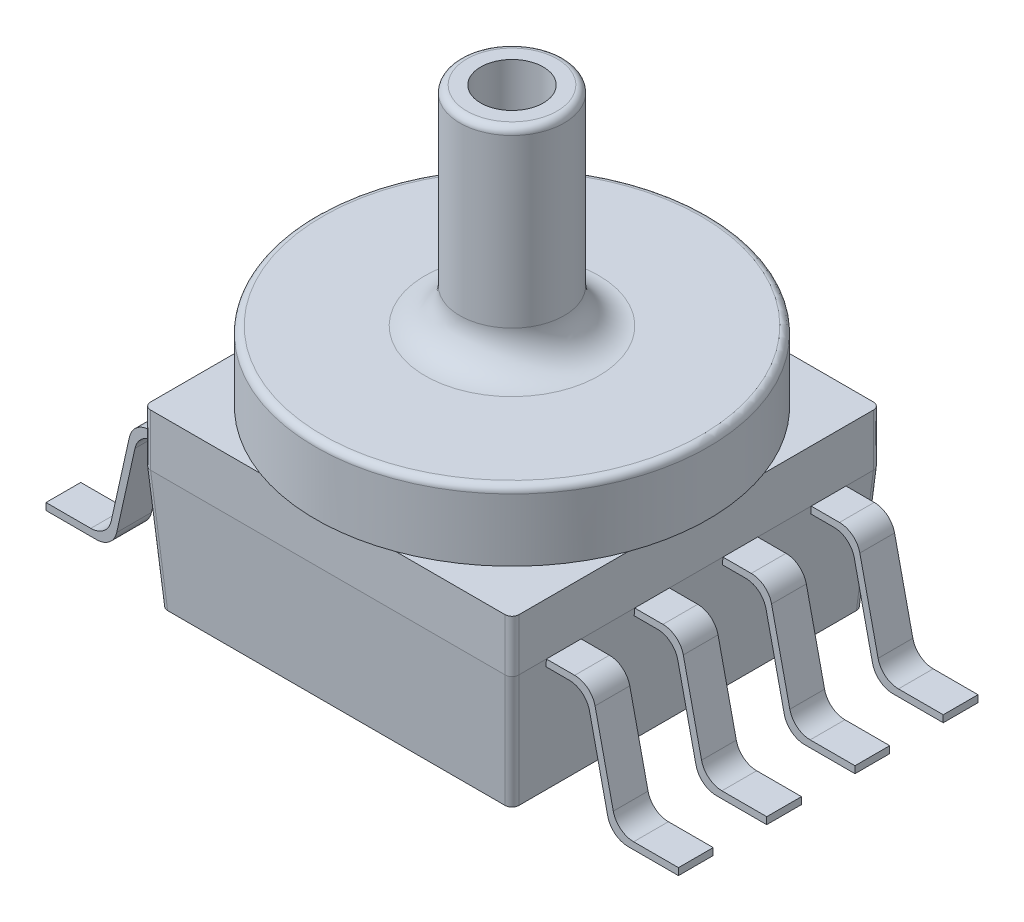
ISO-10303-21;
HEADER;
FILE_DESCRIPTION(('STEP AP214'),'2;1');
FILE_NAME('part.step','',(''),(''),'','','');
FILE_SCHEMA(('AUTOMOTIVE_DESIGN { 1 0 10303 214 1 1 1 1 }'));
ENDSEC;
DATA;
#1=APPLICATION_CONTEXT('core data for automotive mechanical design processes');
#2=APPLICATION_PROTOCOL_DEFINITION('international standard','automotive_design',2000,#1);
#3=PRODUCT_CONTEXT('',#1,'mechanical');
#4=PRODUCT('Part','Part','',(#3));
#5=PRODUCT_RELATED_PRODUCT_CATEGORY('part','',(#4));
#6=PRODUCT_DEFINITION_FORMATION('','',#4);
#7=PRODUCT_DEFINITION_CONTEXT('part definition',#1,'design');
#8=PRODUCT_DEFINITION('design','',#6,#7);
#9=PRODUCT_DEFINITION_SHAPE('','',#8);
#10=(LENGTH_UNIT() NAMED_UNIT(*) SI_UNIT(.MILLI.,.METRE.));
#11=(NAMED_UNIT(*) PLANE_ANGLE_UNIT() SI_UNIT($,.RADIAN.));
#12=(NAMED_UNIT(*) SI_UNIT($,.STERADIAN.) SOLID_ANGLE_UNIT());
#13=UNCERTAINTY_MEASURE_WITH_UNIT(LENGTH_MEASURE(1.E-05),#10,'distance_accuracy_value','');
#14=(GEOMETRIC_REPRESENTATION_CONTEXT(3) GLOBAL_UNCERTAINTY_ASSIGNED_CONTEXT((#13)) GLOBAL_UNIT_ASSIGNED_CONTEXT((#10,
#11,#12)) REPRESENTATION_CONTEXT('',''));
#15=CARTESIAN_POINT('',(0.,0.,0.));
#16=DIRECTION('',(0.,0.,1.));
#17=DIRECTION('',(1.,0.,0.));
#18=AXIS2_PLACEMENT_3D('',#15,#16,#17);
#19=CARTESIAN_POINT('',(5.3,1.5,-5.3));
#20=DIRECTION('',(0.,-1.,0.));
#21=DIRECTION('',(0.,0.,-1.));
#22=AXIS2_PLACEMENT_3D('',#19,#20,#21);
#23=PLANE('',#22);
#24=DIRECTION('',(0.,0.,-1.));
#25=VECTOR('',#24,1.);
#26=CARTESIAN_POINT('',(5.3,1.5,5.3));
#27=LINE('',#26,#25);
#28=CARTESIAN_POINT('',(5.3,1.5,-1.95767719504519));
#29=VERTEX_POINT('',#28);
#30=CARTESIAN_POINT('',(5.3,1.5,-5.1));
#31=VERTEX_POINT('',#30);
#32=EDGE_CURVE('E1485',#29,#31,#27,.T.);
#33=ORIENTED_EDGE('',*,*,#32,.T.);
#34=CARTESIAN_POINT('',(5.1,1.5,-5.1));
#35=DIRECTION('',(0.,-1.,0.));
#36=DIRECTION('',(0.,0.,-1.));
#37=AXIS2_PLACEMENT_3D('',#34,#35,#36);
#38=CIRCLE('',#37,0.2);
#39=CARTESIAN_POINT('',(5.1,1.5,-5.3));
#40=VERTEX_POINT('',#39);
#41=EDGE_CURVE('E1597',#31,#40,#38,.F.);
#42=ORIENTED_EDGE('',*,*,#41,.T.);
#43=DIRECTION('',(-1.,0.,0.));
#44=VECTOR('',#43,1.);
#45=CARTESIAN_POINT('',(-5.3,1.5,-5.3));
#46=LINE('',#45,#44);
#47=CARTESIAN_POINT('',(1.95767719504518,1.5,-5.3));
#48=VERTEX_POINT('',#47);
#49=EDGE_CURVE('E1492',#40,#48,#46,.T.);
#50=ORIENTED_EDGE('',*,*,#49,.T.);
#51=CARTESIAN_POINT('',(0.,1.5,0.));
#52=DIRECTION('',(0.,-1.,0.));
#53=DIRECTION('',(0.,0.,-1.));
#54=AXIS2_PLACEMENT_3D('',#51,#52,#53);
#55=CIRCLE('',#54,5.65);
#56=EDGE_CURVE('E1482',#48,#29,#55,.T.);
#57=ORIENTED_EDGE('',*,*,#56,.T.);
#58=EDGE_LOOP('',(#33,#42,#50,#57));
#59=FACE_BOUND('',#58,.T.);
#60=ADVANCED_FACE('F33',(#59),#23,.F.);
#61=DIRECTION('',(1.,0.,0.));
#62=VECTOR('',#61,1.);
#63=CARTESIAN_POINT('',(-5.3,1.5,5.3));
#64=LINE('',#63,#62);
#65=CARTESIAN_POINT('',(1.9576771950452,1.5,5.3));
#66=VERTEX_POINT('',#65);
#67=CARTESIAN_POINT('',(5.1,1.5,5.3));
#68=VERTEX_POINT('',#67);
#69=EDGE_CURVE('E1498',#66,#68,#64,.T.);
#70=ORIENTED_EDGE('',*,*,#69,.T.);
#71=CARTESIAN_POINT('',(5.1,1.5,5.1));
#72=DIRECTION('',(0.,-1.,0.));
#73=DIRECTION('',(0.,0.,-1.));
#74=AXIS2_PLACEMENT_3D('',#71,#72,#73);
#75=CIRCLE('',#74,0.2);
#76=CARTESIAN_POINT('',(5.3,1.5,5.1));
#77=VERTEX_POINT('',#76);
#78=EDGE_CURVE('E1599',#68,#77,#75,.F.);
#79=ORIENTED_EDGE('',*,*,#78,.T.);
#80=CARTESIAN_POINT('',(5.3,1.5,1.95767719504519));
#81=VERTEX_POINT('',#80);
#82=EDGE_CURVE('E1488',#77,#81,#27,.T.);
#83=ORIENTED_EDGE('',*,*,#82,.T.);
#84=EDGE_CURVE('E1540',#81,#66,#55,.T.);
#85=ORIENTED_EDGE('',*,*,#84,.T.);
#86=EDGE_LOOP('',(#70,#79,#83,#85));
#87=FACE_BOUND('',#86,.T.);
#88=ADVANCED_FACE('F1747',(#87),#23,.F.);
#89=DIRECTION('',(0.,0.,1.));
#90=VECTOR('',#89,1.);
#91=CARTESIAN_POINT('',(-5.3,1.5,5.3));
#92=LINE('',#91,#90);
#93=CARTESIAN_POINT('',(-5.3,1.5,1.95767719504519));
#94=VERTEX_POINT('',#93);
#95=CARTESIAN_POINT('',(-5.3,1.5,5.1));
#96=VERTEX_POINT('',#95);
#97=EDGE_CURVE('E1494',#94,#96,#92,.T.);
#98=ORIENTED_EDGE('',*,*,#97,.T.);
#99=CARTESIAN_POINT('',(-5.1,1.5,5.1));
#100=DIRECTION('',(0.,-1.,0.));
#101=DIRECTION('',(0.,0.,-1.));
#102=AXIS2_PLACEMENT_3D('',#99,#100,#101);
#103=CIRCLE('',#102,0.2);
#104=CARTESIAN_POINT('',(-5.1,1.5,5.3));
#105=VERTEX_POINT('',#104);
#106=EDGE_CURVE('E1574',#96,#105,#103,.F.);
#107=ORIENTED_EDGE('',*,*,#106,.T.);
#108=CARTESIAN_POINT('',(-1.9576771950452,1.5,5.3));
#109=VERTEX_POINT('',#108);
#110=EDGE_CURVE('E1500',#105,#109,#64,.T.);
#111=ORIENTED_EDGE('',*,*,#110,.T.);
#112=EDGE_CURVE('E2972',#109,#94,#55,.T.);
#113=ORIENTED_EDGE('',*,*,#112,.T.);
#114=EDGE_LOOP('',(#98,#107,#111,#113));
#115=FACE_BOUND('',#114,.T.);
#116=ADVANCED_FACE('F1731',(#115),#23,.F.);
#117=CARTESIAN_POINT('',(5.3,0.,5.3));
#118=DIRECTION('',(0.997564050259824,-0.0697564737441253,0.));
#119=DIRECTION('',(0.0697564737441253,0.997564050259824,0.));
#120=AXIS2_PLACEMENT_3D('',#117,#118,#119);
#121=PLANE('',#120);
#122=DIRECTION('',(-0.0697564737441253,-0.997564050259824,0.));
#123=VECTOR('',#122,1.);
#124=CARTESIAN_POINT('',(5.3,0.,-3.31));
#125=LINE('',#124,#123);
#126=CARTESIAN_POINT('',(5.3,0.,-3.31));
#127=VERTEX_POINT('',#126);
#128=CARTESIAN_POINT('',(5.2860146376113,-0.2,-3.31));
#129=VERTEX_POINT('',#128);
#130=EDGE_CURVE('E1072',#127,#129,#125,.T.);
#131=ORIENTED_EDGE('',*,*,#130,.F.);
#132=DIRECTION('',(0.,0.,-1.));
#133=VECTOR('',#132,1.);
#134=CARTESIAN_POINT('',(5.3,0.,5.3));
#135=LINE('',#134,#133);
#136=CARTESIAN_POINT('',(5.3,0.,-1.77));
#137=VERTEX_POINT('',#136);
#138=EDGE_CURVE('E1664',#137,#127,#135,.T.);
#139=ORIENTED_EDGE('',*,*,#138,.F.);
#140=DIRECTION('',(-0.0697564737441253,-0.997564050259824,0.));
#141=VECTOR('',#140,1.);
#142=CARTESIAN_POINT('',(5.3,0.,-1.77));
#143=LINE('',#142,#141);
#144=CARTESIAN_POINT('',(5.2860146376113,-0.2,-1.77));
#145=VERTEX_POINT('',#144);
#146=EDGE_CURVE('E1124',#137,#145,#143,.T.);
#147=ORIENTED_EDGE('',*,*,#146,.T.);
#148=DIRECTION('',(0.,0.,1.));
#149=VECTOR('',#148,1.);
#150=CARTESIAN_POINT('',(5.2860146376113,-0.2,0.219999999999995));
#151=LINE('',#150,#149);
#152=CARTESIAN_POINT('',(5.2860146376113,-0.2,-0.770000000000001));
#153=VERTEX_POINT('',#152);
#154=EDGE_CURVE('E1159',#145,#153,#151,.T.);
#155=ORIENTED_EDGE('',*,*,#154,.T.);
#156=DIRECTION('',(-0.0697564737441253,-0.997564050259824,0.));
#157=VECTOR('',#156,1.);
#158=CARTESIAN_POINT('',(5.3,0.,-0.770000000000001));
#159=LINE('',#158,#157);
#160=CARTESIAN_POINT('',(5.3,0.,-0.770000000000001));
#161=VERTEX_POINT('',#160);
#162=EDGE_CURVE('E1170',#161,#153,#159,.T.);
#163=ORIENTED_EDGE('',*,*,#162,.F.);
#164=CARTESIAN_POINT('',(5.3,0.,0.769999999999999));
#165=VERTEX_POINT('',#164);
#166=EDGE_CURVE('E1662',#165,#161,#135,.T.);
#167=ORIENTED_EDGE('',*,*,#166,.F.);
#168=DIRECTION('',(-0.0697564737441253,-0.997564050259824,0.));
#169=VECTOR('',#168,1.);
#170=CARTESIAN_POINT('',(5.3,0.,0.769999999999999));
#171=LINE('',#170,#169);
#172=CARTESIAN_POINT('',(5.2860146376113,-0.2,0.769999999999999));
#173=VERTEX_POINT('',#172);
#174=EDGE_CURVE('E1222',#165,#173,#171,.T.);
#175=ORIENTED_EDGE('',*,*,#174,.T.);
#176=DIRECTION('',(0.,0.,1.));
#177=VECTOR('',#176,1.);
#178=CARTESIAN_POINT('',(5.2860146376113,-0.2,2.76));
#179=LINE('',#178,#177);
#180=CARTESIAN_POINT('',(5.2860146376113,-0.2,1.77));
#181=VERTEX_POINT('',#180);
#182=EDGE_CURVE('E1257',#173,#181,#179,.T.);
#183=ORIENTED_EDGE('',*,*,#182,.T.);
#184=DIRECTION('',(-0.0697564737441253,-0.997564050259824,0.));
#185=VECTOR('',#184,1.);
#186=CARTESIAN_POINT('',(5.3,0.,1.77));
#187=LINE('',#186,#185);
#188=CARTESIAN_POINT('',(5.3,0.,1.77));
#189=VERTEX_POINT('',#188);
#190=EDGE_CURVE('E1268',#189,#181,#187,.T.);
#191=ORIENTED_EDGE('',*,*,#190,.F.);
#192=CARTESIAN_POINT('',(5.3,0.,3.31));
#193=VERTEX_POINT('',#192);
#194=EDGE_CURVE('E1661',#193,#189,#135,.T.);
#195=ORIENTED_EDGE('',*,*,#194,.F.);
#196=DIRECTION('',(-0.0697564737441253,-0.997564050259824,0.));
#197=VECTOR('',#196,1.);
#198=CARTESIAN_POINT('',(5.3,0.,3.31));
#199=LINE('',#198,#197);
#200=CARTESIAN_POINT('',(5.2860146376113,-0.2,3.31));
#201=VERTEX_POINT('',#200);
#202=EDGE_CURVE('E1623',#193,#201,#199,.T.);
#203=ORIENTED_EDGE('',*,*,#202,.T.);
#204=DIRECTION('',(0.,0.,1.));
#205=VECTOR('',#204,1.);
#206=CARTESIAN_POINT('',(5.2860146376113,-0.2,5.3));
#207=LINE('',#206,#205);
#208=CARTESIAN_POINT('',(5.2860146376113,-0.2,4.31));
#209=VERTEX_POINT('',#208);
#210=EDGE_CURVE('E41',#201,#209,#207,.T.);
#211=ORIENTED_EDGE('',*,*,#210,.T.);
#212=DIRECTION('',(-0.0697564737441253,-0.997564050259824,0.));
#213=VECTOR('',#212,1.);
#214=CARTESIAN_POINT('',(5.3,0.,4.31));
#215=LINE('',#214,#213);
#216=CARTESIAN_POINT('',(5.3,0.,4.31));
#217=VERTEX_POINT('',#216);
#218=EDGE_CURVE('E11',#217,#209,#215,.T.);
#219=ORIENTED_EDGE('',*,*,#218,.F.);
#220=CARTESIAN_POINT('',(5.3,0.,5.1));
#221=VERTEX_POINT('',#220);
#222=EDGE_CURVE('E1660',#221,#217,#135,.T.);
#223=ORIENTED_EDGE('',*,*,#222,.F.);
#224=CARTESIAN_POINT('',(5.3,0.,5.10048718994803));
#225=VERTEX_POINT('',#224);
#226=EDGE_CURVE('E1507',#225,#221,#135,.T.);
#227=ORIENTED_EDGE('',*,*,#226,.F.);
#228=DIRECTION('',(0.0695873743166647,0.995145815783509,0.0695873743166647));
#229=VECTOR('',#228,1.);
#230=CARTESIAN_POINT('',(5.30096612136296,0.0138161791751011,5.10145331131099));
#231=LINE('',#230,#229);
#232=CARTESIAN_POINT('',(5.05525615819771,-3.5,4.85574334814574));
#233=VERTEX_POINT('',#232);
#234=EDGE_CURVE('E1587',#225,#233,#231,.F.);
#235=ORIENTED_EDGE('',*,*,#234,.T.);
#236=DIRECTION('',(0.,0.,-1.));
#237=VECTOR('',#236,1.);
#238=CARTESIAN_POINT('',(5.05525615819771,-3.5,5.3));
#239=LINE('',#238,#237);
#240=CARTESIAN_POINT('',(5.05525615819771,-3.5,-4.85574334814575));
#241=VERTEX_POINT('',#240);
#242=EDGE_CURVE('E1524',#233,#241,#239,.T.);
#243=ORIENTED_EDGE('',*,*,#242,.T.);
#244=DIRECTION('',(0.0695873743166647,0.995145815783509,-0.0695873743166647));
#245=VECTOR('',#244,1.);
#246=CARTESIAN_POINT('',(5.24963665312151,-0.720229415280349,-5.05012384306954));
#247=LINE('',#246,#245);
#248=CARTESIAN_POINT('',(5.3,0.,-5.10048659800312));
#249=VERTEX_POINT('',#248);
#250=EDGE_CURVE('E1589',#241,#249,#247,.T.);
#251=ORIENTED_EDGE('',*,*,#250,.T.);
#252=CARTESIAN_POINT('',(5.3,0.,-5.1));
#253=VERTEX_POINT('',#252);
#254=EDGE_CURVE('E1502',#253,#249,#135,.T.);
#255=ORIENTED_EDGE('',*,*,#254,.F.);
#256=CARTESIAN_POINT('',(5.3,0.,-4.31));
#257=VERTEX_POINT('',#256);
#258=EDGE_CURVE('E1506',#257,#253,#135,.T.);
#259=ORIENTED_EDGE('',*,*,#258,.F.);
#260=DIRECTION('',(-0.0697564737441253,-0.997564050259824,0.));
#261=VECTOR('',#260,1.);
#262=CARTESIAN_POINT('',(5.3,0.,-4.31));
#263=LINE('',#262,#261);
#264=CARTESIAN_POINT('',(5.2860146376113,-0.2,-4.31));
#265=VERTEX_POINT('',#264);
#266=EDGE_CURVE('E1026',#257,#265,#263,.T.);
#267=ORIENTED_EDGE('',*,*,#266,.T.);
#268=DIRECTION('',(0.,0.,1.));
#269=VECTOR('',#268,1.);
#270=CARTESIAN_POINT('',(5.2860146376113,-0.2,-2.32));
#271=LINE('',#270,#269);
#272=EDGE_CURVE('E1061',#265,#129,#271,.T.);
#273=ORIENTED_EDGE('',*,*,#272,.T.);
#274=EDGE_LOOP('',(#131,#139,#147,#155,#163,#167,#175,#183,#191,#195,#203,#211,#219,#223,#227,
#235,#243,#251,#255,#259,#267,#273));
#275=FACE_BOUND('',#274,.T.);
#276=ADVANCED_FACE('F1629',(#275),#121,.T.);
#277=CARTESIAN_POINT('',(-5.3,0.,5.3));
#278=DIRECTION('',(0.,-0.0697564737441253,0.997564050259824));
#279=DIRECTION('',(0.,-0.997564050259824,-0.0697564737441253));
#280=AXIS2_PLACEMENT_3D('',#277,#278,#279);
#281=PLANE('',#280);
#282=DIRECTION('',(1.,0.,0.));
#283=VECTOR('',#282,1.);
#284=CARTESIAN_POINT('',(-5.3,0.,5.3));
#285=LINE('',#284,#283);
#286=CARTESIAN_POINT('',(-5.10048659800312,0.,5.3));
#287=VERTEX_POINT('',#286);
#288=CARTESIAN_POINT('',(-5.1,0.,5.3));
#289=VERTEX_POINT('',#288);
#290=EDGE_CURVE('E1523',#287,#289,#285,.T.);
#291=ORIENTED_EDGE('',*,*,#290,.F.);
#292=DIRECTION('',(-0.0695873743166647,0.995145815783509,0.0695873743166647));
#293=VECTOR('',#292,1.);
#294=CARTESIAN_POINT('',(-5.10145331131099,0.0138161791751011,5.30096612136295));
#295=LINE('',#294,#293);
#296=CARTESIAN_POINT('',(-4.85574334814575,-3.5,5.05525615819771));
#297=VERTEX_POINT('',#296);
#298=EDGE_CURVE('E1556',#287,#297,#295,.F.);
#299=ORIENTED_EDGE('',*,*,#298,.T.);
#300=DIRECTION('',(1.,0.,0.));
#301=VECTOR('',#300,1.);
#302=CARTESIAN_POINT('',(-5.3,-3.5,5.05525615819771));
#303=LINE('',#302,#301);
#304=CARTESIAN_POINT('',(4.85574334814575,-3.5,5.05525615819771));
#305=VERTEX_POINT('',#304);
#306=EDGE_CURVE('E1528',#297,#305,#303,.T.);
#307=ORIENTED_EDGE('',*,*,#306,.T.);
#308=DIRECTION('',(0.0695873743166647,0.995145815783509,0.0695873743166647));
#309=VECTOR('',#308,1.);
#310=CARTESIAN_POINT('',(5.05012384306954,-0.720229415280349,5.2496366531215));
#311=LINE('',#310,#309);
#312=CARTESIAN_POINT('',(5.10048718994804,0.,5.3));
#313=VERTEX_POINT('',#312);
#314=EDGE_CURVE('E1554',#305,#313,#311,.T.);
#315=ORIENTED_EDGE('',*,*,#314,.T.);
#316=CARTESIAN_POINT('',(5.1,0.,5.3));
#317=VERTEX_POINT('',#316);
#318=EDGE_CURVE('E1519',#317,#313,#285,.T.);
#319=ORIENTED_EDGE('',*,*,#318,.F.);
#320=EDGE_CURVE('E1522',#289,#317,#285,.T.);
#321=ORIENTED_EDGE('',*,*,#320,.F.);
#322=EDGE_LOOP('',(#291,#299,#307,#315,#319,#321));
#323=FACE_BOUND('',#322,.T.);
#324=ADVANCED_FACE('F1763',(#323),#281,.T.);
#325=CARTESIAN_POINT('',(-5.3,0.,5.3));
#326=DIRECTION('',(-0.997564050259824,-0.0697564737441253,0.));
#327=DIRECTION('',(0.0697564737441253,-0.997564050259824,0.));
#328=AXIS2_PLACEMENT_3D('',#325,#326,#327);
#329=PLANE('',#328);
#330=DIRECTION('',(-0.0697564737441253,0.997564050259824,0.));
#331=VECTOR('',#330,1.);
#332=CARTESIAN_POINT('',(-5.3,0.,-3.31));
#333=LINE('',#332,#331);
#334=CARTESIAN_POINT('',(-5.2860146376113,-0.2,-3.31));
#335=VERTEX_POINT('',#334);
#336=CARTESIAN_POINT('',(-5.3,0.,-3.31));
#337=VERTEX_POINT('',#336);
#338=EDGE_CURVE('E770',#335,#337,#333,.T.);
#339=ORIENTED_EDGE('',*,*,#338,.F.);
#340=DIRECTION('',(0.,0.,-1.));
#341=VECTOR('',#340,1.);
#342=CARTESIAN_POINT('',(-5.2860146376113,-0.2,-2.32));
#343=LINE('',#342,#341);
#344=CARTESIAN_POINT('',(-5.2860146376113,-0.2,-4.31));
#345=VERTEX_POINT('',#344);
#346=EDGE_CURVE('E761',#335,#345,#343,.T.);
#347=ORIENTED_EDGE('',*,*,#346,.T.);
#348=DIRECTION('',(-0.0697564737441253,0.997564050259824,0.));
#349=VECTOR('',#348,1.);
#350=CARTESIAN_POINT('',(-5.3,0.,-4.31));
#351=LINE('',#350,#349);
#352=CARTESIAN_POINT('',(-5.3,0.,-4.31));
#353=VERTEX_POINT('',#352);
#354=EDGE_CURVE('E746',#345,#353,#351,.T.);
#355=ORIENTED_EDGE('',*,*,#354,.T.);
#356=DIRECTION('',(0.,0.,1.));
#357=VECTOR('',#356,1.);
#358=CARTESIAN_POINT('',(-5.3,0.,5.3));
#359=LINE('',#358,#357);
#360=CARTESIAN_POINT('',(-5.3,0.,-5.1));
#361=VERTEX_POINT('',#360);
#362=EDGE_CURVE('E1708',#361,#353,#359,.T.);
#363=ORIENTED_EDGE('',*,*,#362,.F.);
#364=CARTESIAN_POINT('',(-5.3,0.,-5.10048659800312));
#365=VERTEX_POINT('',#364);
#366=EDGE_CURVE('E1518',#365,#361,#359,.T.);
#367=ORIENTED_EDGE('',*,*,#366,.F.);
#368=DIRECTION('',(-0.0695873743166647,0.995145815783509,-0.0695873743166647));
#369=VECTOR('',#368,1.);
#370=CARTESIAN_POINT('',(-5.24963665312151,-0.720229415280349,-5.05012384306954));
#371=LINE('',#370,#369);
#372=CARTESIAN_POINT('',(-5.05525615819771,-3.5,-4.85574334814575));
#373=VERTEX_POINT('',#372);
#374=EDGE_CURVE('E1549',#365,#373,#371,.F.);
#375=ORIENTED_EDGE('',*,*,#374,.T.);
#376=DIRECTION('',(0.,0.,1.));
#377=VECTOR('',#376,1.);
#378=CARTESIAN_POINT('',(-5.05525615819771,-3.5,5.3));
#379=LINE('',#378,#377);
#380=CARTESIAN_POINT('',(-5.05525615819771,-3.5,4.85574334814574));
#381=VERTEX_POINT('',#380);
#382=EDGE_CURVE('E1531',#373,#381,#379,.T.);
#383=ORIENTED_EDGE('',*,*,#382,.T.);
#384=DIRECTION('',(-0.0695873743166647,0.995145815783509,0.0695873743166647));
#385=VECTOR('',#384,1.);
#386=CARTESIAN_POINT('',(-5.30096612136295,0.0138161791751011,5.10145331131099));
#387=LINE('',#386,#385);
#388=CARTESIAN_POINT('',(-5.3,0.,5.10048659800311));
#389=VERTEX_POINT('',#388);
#390=EDGE_CURVE('E1551',#381,#389,#387,.T.);
#391=ORIENTED_EDGE('',*,*,#390,.T.);
#392=CARTESIAN_POINT('',(-5.3,0.,5.1));
#393=VERTEX_POINT('',#392);
#394=EDGE_CURVE('E1513',#393,#389,#359,.T.);
#395=ORIENTED_EDGE('',*,*,#394,.F.);
#396=CARTESIAN_POINT('',(-5.3,0.,4.31));
#397=VERTEX_POINT('',#396);
#398=EDGE_CURVE('E1516',#397,#393,#359,.T.);
#399=ORIENTED_EDGE('',*,*,#398,.F.);
#400=DIRECTION('',(-0.0697564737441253,0.997564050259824,0.));
#401=VECTOR('',#400,1.);
#402=CARTESIAN_POINT('',(-5.3,0.,4.31));
#403=LINE('',#402,#401);
#404=CARTESIAN_POINT('',(-5.2860146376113,-0.2,4.31));
#405=VERTEX_POINT('',#404);
#406=EDGE_CURVE('E1620',#405,#397,#403,.T.);
#407=ORIENTED_EDGE('',*,*,#406,.F.);
#408=DIRECTION('',(0.,0.,-1.));
#409=VECTOR('',#408,1.);
#410=CARTESIAN_POINT('',(-5.2860146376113,-0.2,5.3));
#411=LINE('',#410,#409);
#412=CARTESIAN_POINT('',(-5.2860146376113,-0.2,3.31));
#413=VERTEX_POINT('',#412);
#414=EDGE_CURVE('E1617',#405,#413,#411,.T.);
#415=ORIENTED_EDGE('',*,*,#414,.T.);
#416=DIRECTION('',(-0.0697564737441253,0.997564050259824,0.));
#417=VECTOR('',#416,1.);
#418=CARTESIAN_POINT('',(-5.3,0.,3.31));
#419=LINE('',#418,#417);
#420=CARTESIAN_POINT('',(-5.3,0.,3.31));
#421=VERTEX_POINT('',#420);
#422=EDGE_CURVE('E1607',#413,#421,#419,.T.);
#423=ORIENTED_EDGE('',*,*,#422,.T.);
#424=CARTESIAN_POINT('',(-5.3,0.,1.77));
#425=VERTEX_POINT('',#424);
#426=EDGE_CURVE('E1714',#425,#421,#359,.T.);
#427=ORIENTED_EDGE('',*,*,#426,.F.);
#428=DIRECTION('',(-0.0697564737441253,0.997564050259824,0.));
#429=VECTOR('',#428,1.);
#430=CARTESIAN_POINT('',(-5.3,0.,1.77));
#431=LINE('',#430,#429);
#432=CARTESIAN_POINT('',(-5.2860146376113,-0.2,1.77));
#433=VERTEX_POINT('',#432);
#434=EDGE_CURVE('E972',#433,#425,#431,.T.);
#435=ORIENTED_EDGE('',*,*,#434,.F.);
#436=DIRECTION('',(0.,0.,-1.));
#437=VECTOR('',#436,1.);
#438=CARTESIAN_POINT('',(-5.2860146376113,-0.2,2.76));
#439=LINE('',#438,#437);
#440=CARTESIAN_POINT('',(-5.2860146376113,-0.2,0.769999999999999));
#441=VERTEX_POINT('',#440);
#442=EDGE_CURVE('E963',#433,#441,#439,.T.);
#443=ORIENTED_EDGE('',*,*,#442,.T.);
#444=DIRECTION('',(-0.0697564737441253,0.997564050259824,0.));
#445=VECTOR('',#444,1.);
#446=CARTESIAN_POINT('',(-5.3,0.,0.769999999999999));
#447=LINE('',#446,#445);
#448=CARTESIAN_POINT('',(-5.3,0.,0.769999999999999));
#449=VERTEX_POINT('',#448);
#450=EDGE_CURVE('E927',#441,#449,#447,.T.);
#451=ORIENTED_EDGE('',*,*,#450,.T.);
#452=CARTESIAN_POINT('',(-5.3,0.,-0.770000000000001));
#453=VERTEX_POINT('',#452);
#454=EDGE_CURVE('E1712',#453,#449,#359,.T.);
#455=ORIENTED_EDGE('',*,*,#454,.F.);
#456=DIRECTION('',(-0.0697564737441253,0.997564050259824,0.));
#457=VECTOR('',#456,1.);
#458=CARTESIAN_POINT('',(-5.3,0.,-0.770000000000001));
#459=LINE('',#458,#457);
#460=CARTESIAN_POINT('',(-5.2860146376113,-0.2,-0.770000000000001));
#461=VERTEX_POINT('',#460);
#462=EDGE_CURVE('E875',#461,#453,#459,.T.);
#463=ORIENTED_EDGE('',*,*,#462,.F.);
#464=DIRECTION('',(0.,0.,-1.));
#465=VECTOR('',#464,1.);
#466=CARTESIAN_POINT('',(-5.2860146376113,-0.2,0.219999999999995));
#467=LINE('',#466,#465);
#468=CARTESIAN_POINT('',(-5.2860146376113,-0.2,-1.77));
#469=VERTEX_POINT('',#468);
#470=EDGE_CURVE('E866',#461,#469,#467,.T.);
#471=ORIENTED_EDGE('',*,*,#470,.T.);
#472=DIRECTION('',(-0.0697564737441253,0.997564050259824,0.));
#473=VECTOR('',#472,1.);
#474=CARTESIAN_POINT('',(-5.3,0.,-1.77));
#475=LINE('',#474,#473);
#476=CARTESIAN_POINT('',(-5.3,0.,-1.77));
#477=VERTEX_POINT('',#476);
#478=EDGE_CURVE('E830',#469,#477,#475,.T.);
#479=ORIENTED_EDGE('',*,*,#478,.T.);
#480=EDGE_CURVE('E1517',#337,#477,#359,.T.);
#481=ORIENTED_EDGE('',*,*,#480,.F.);
#482=EDGE_LOOP('',(#339,#347,#355,#363,#367,#375,#383,#391,#395,#399,#407,#415,#423,#427,#435,
#443,#451,#455,#463,#471,#479,#481));
#483=FACE_BOUND('',#482,.T.);
#484=ADVANCED_FACE('F768',(#483),#329,.T.);
#485=CARTESIAN_POINT('',(-5.3,0.,-5.3));
#486=DIRECTION('',(0.,-0.0697564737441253,-0.997564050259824));
#487=DIRECTION('',(0.,0.997564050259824,-0.0697564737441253));
#488=AXIS2_PLACEMENT_3D('',#485,#486,#487);
#489=PLANE('',#488);
#490=DIRECTION('',(-1.,0.,0.));
#491=VECTOR('',#490,1.);
#492=CARTESIAN_POINT('',(-5.3,-3.5,-5.05525615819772));
#493=LINE('',#492,#491);
#494=CARTESIAN_POINT('',(4.85574334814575,-3.5,-5.05525615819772));
#495=VERTEX_POINT('',#494);
#496=CARTESIAN_POINT('',(-4.85574334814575,-3.5,-5.05525615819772));
#497=VERTEX_POINT('',#496);
#498=EDGE_CURVE('E1527',#495,#497,#493,.T.);
#499=ORIENTED_EDGE('',*,*,#498,.T.);
#500=DIRECTION('',(-0.0695873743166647,0.995145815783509,-0.0695873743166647));
#501=VECTOR('',#500,1.);
#502=CARTESIAN_POINT('',(-5.10145331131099,0.0138161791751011,-5.30096612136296));
#503=LINE('',#502,#501);
#504=CARTESIAN_POINT('',(-5.10048659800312,0.,-5.3));
#505=VERTEX_POINT('',#504);
#506=EDGE_CURVE('E1578',#497,#505,#503,.T.);
#507=ORIENTED_EDGE('',*,*,#506,.T.);
#508=DIRECTION('',(-1.,0.,0.));
#509=VECTOR('',#508,1.);
#510=CARTESIAN_POINT('',(-5.3,0.,-5.3));
#511=LINE('',#510,#509);
#512=CARTESIAN_POINT('',(-5.1,0.,-5.3));
#513=VERTEX_POINT('',#512);
#514=EDGE_CURVE('E1508',#513,#505,#511,.T.);
#515=ORIENTED_EDGE('',*,*,#514,.F.);
#516=CARTESIAN_POINT('',(5.1,0.,-5.3));
#517=VERTEX_POINT('',#516);
#518=EDGE_CURVE('E1511',#517,#513,#511,.T.);
#519=ORIENTED_EDGE('',*,*,#518,.F.);
#520=CARTESIAN_POINT('',(5.10048659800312,0.,-5.3));
#521=VERTEX_POINT('',#520);
#522=EDGE_CURVE('E1512',#521,#517,#511,.T.);
#523=ORIENTED_EDGE('',*,*,#522,.F.);
#524=DIRECTION('',(0.0695873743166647,0.995145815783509,-0.0695873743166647));
#525=VECTOR('',#524,1.);
#526=CARTESIAN_POINT('',(5.05012384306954,-0.720229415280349,-5.24963665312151));
#527=LINE('',#526,#525);
#528=EDGE_CURVE('E1576',#521,#495,#527,.F.);
#529=ORIENTED_EDGE('',*,*,#528,.T.);
#530=EDGE_LOOP('',(#499,#507,#515,#519,#523,#529));
#531=FACE_BOUND('',#530,.T.);
#532=ADVANCED_FACE('F1777',(#531),#489,.T.);
#533=CARTESIAN_POINT('',(5.3,-3.5,-5.3));
#534=DIRECTION('',(0.,-1.,0.));
#535=DIRECTION('',(0.,0.,-1.));
#536=AXIS2_PLACEMENT_3D('',#533,#534,#535);
#537=PLANE('',#536);
#538=ORIENTED_EDGE('',*,*,#306,.F.);
#539=CARTESIAN_POINT('',(-4.85476777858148,-3.5,4.85476777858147));
#540=DIRECTION('',(0.,-1.,0.));
#541=DIRECTION('',(-0.707106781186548,0.,0.707106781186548));
#542=AXIS2_PLACEMENT_3D('',#539,#540,#541);
#543=ELLIPSE('',#542,0.200975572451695,0.2);
#544=EDGE_CURVE('E1564',#297,#381,#543,.T.);
#545=ORIENTED_EDGE('',*,*,#544,.T.);
#546=ORIENTED_EDGE('',*,*,#382,.F.);
#547=CARTESIAN_POINT('',(-4.85476777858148,-3.5,-4.85476777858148));
#548=DIRECTION('',(0.,-1.,0.));
#549=DIRECTION('',(-0.707106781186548,0.,-0.707106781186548));
#550=AXIS2_PLACEMENT_3D('',#547,#548,#549);
#551=ELLIPSE('',#550,0.200975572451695,0.2);
#552=EDGE_CURVE('E1562',#373,#497,#551,.T.);
#553=ORIENTED_EDGE('',*,*,#552,.T.);
#554=ORIENTED_EDGE('',*,*,#498,.F.);
#555=CARTESIAN_POINT('',(4.85476777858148,-3.5,-4.85476777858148));
#556=DIRECTION('',(0.,-1.,0.));
#557=DIRECTION('',(0.707106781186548,0.,-0.707106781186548));
#558=AXIS2_PLACEMENT_3D('',#555,#556,#557);
#559=ELLIPSE('',#558,0.200975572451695,0.2);
#560=EDGE_CURVE('E1560',#495,#241,#559,.T.);
#561=ORIENTED_EDGE('',*,*,#560,.T.);
#562=ORIENTED_EDGE('',*,*,#242,.F.);
#563=CARTESIAN_POINT('',(4.85476777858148,-3.5,4.85476777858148));
#564=DIRECTION('',(0.,-1.,0.));
#565=DIRECTION('',(0.707106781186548,0.,0.707106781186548));
#566=AXIS2_PLACEMENT_3D('',#563,#564,#565);
#567=ELLIPSE('',#566,0.200975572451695,0.2);
#568=EDGE_CURVE('E1558',#233,#305,#567,.T.);
#569=ORIENTED_EDGE('',*,*,#568,.T.);
#570=EDGE_LOOP('',(#538,#545,#546,#553,#554,#561,#562,#569));
#571=FACE_BOUND('',#570,.T.);
#572=ADVANCED_FACE('F1771',(#571),#537,.T.);
#573=CARTESIAN_POINT('',(5.3,1.5,5.3));
#574=DIRECTION('',(-1.,0.,0.));
#575=DIRECTION('',(0.,0.,1.));
#576=AXIS2_PLACEMENT_3D('',#573,#574,#575);
#577=PLANE('',#576);
#578=ORIENTED_EDGE('',*,*,#222,.T.);
#579=EDGE_CURVE('E1657',#217,#193,#135,.T.);
#580=ORIENTED_EDGE('',*,*,#579,.T.);
#581=ORIENTED_EDGE('',*,*,#194,.T.);
#582=DIRECTION('',(0.,0.,-1.));
#583=VECTOR('',#582,1.);
#584=CARTESIAN_POINT('',(5.3,0.,2.76));
#585=LINE('',#584,#583);
#586=EDGE_CURVE('E1317',#189,#165,#585,.T.);
#587=ORIENTED_EDGE('',*,*,#586,.T.);
#588=ORIENTED_EDGE('',*,*,#166,.T.);
#589=DIRECTION('',(0.,0.,-1.));
#590=VECTOR('',#589,1.);
#591=CARTESIAN_POINT('',(5.3,0.,0.219999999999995));
#592=LINE('',#591,#590);
#593=EDGE_CURVE('E1219',#161,#137,#592,.T.);
#594=ORIENTED_EDGE('',*,*,#593,.T.);
#595=ORIENTED_EDGE('',*,*,#138,.T.);
#596=DIRECTION('',(0.,0.,-1.));
#597=VECTOR('',#596,1.);
#598=CARTESIAN_POINT('',(5.3,0.,-2.32));
#599=LINE('',#598,#597);
#600=EDGE_CURVE('E1121',#127,#257,#599,.T.);
#601=ORIENTED_EDGE('',*,*,#600,.T.);
#602=ORIENTED_EDGE('',*,*,#258,.T.);
#603=DIRECTION('',(0.,-1.,0.));
#604=VECTOR('',#603,1.);
#605=CARTESIAN_POINT('',(5.3,1.5,-5.1));
#606=LINE('',#605,#604);
#607=EDGE_CURVE('E1595',#253,#31,#606,.F.);
#608=ORIENTED_EDGE('',*,*,#607,.T.);
#609=ORIENTED_EDGE('',*,*,#32,.F.);
#610=EDGE_CURVE('E1491',#81,#29,#27,.T.);
#611=ORIENTED_EDGE('',*,*,#610,.F.);
#612=ORIENTED_EDGE('',*,*,#82,.F.);
#613=DIRECTION('',(0.,-1.,0.));
#614=VECTOR('',#613,1.);
#615=CARTESIAN_POINT('',(5.3,1.5,5.1));
#616=LINE('',#615,#614);
#617=EDGE_CURVE('E1592',#77,#221,#616,.T.);
#618=ORIENTED_EDGE('',*,*,#617,.T.);
#619=EDGE_LOOP('',(#578,#580,#581,#587,#588,#594,#595,#601,#602,#608,#609,#611,#612,#618));
#620=FACE_BOUND('',#619,.T.);
#621=ADVANCED_FACE('F1670',(#620),#577,.F.);
#622=CARTESIAN_POINT('',(-5.3,1.5,-5.3));
#623=DIRECTION('',(0.,0.,1.));
#624=DIRECTION('',(1.,0.,0.));
#625=AXIS2_PLACEMENT_3D('',#622,#623,#624);
#626=PLANE('',#625);
#627=ORIENTED_EDGE('',*,*,#518,.T.);
#628=DIRECTION('',(0.,-1.,0.));
#629=VECTOR('',#628,1.);
#630=CARTESIAN_POINT('',(-5.1,1.5,-5.3));
#631=LINE('',#630,#629);
#632=CARTESIAN_POINT('',(-5.1,1.5,-5.3));
#633=VERTEX_POINT('',#632);
#634=EDGE_CURVE('E1583',#513,#633,#631,.F.);
#635=ORIENTED_EDGE('',*,*,#634,.T.);
#636=CARTESIAN_POINT('',(-1.95767719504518,1.5,-5.3));
#637=VERTEX_POINT('',#636);
#638=EDGE_CURVE('E1490',#637,#633,#46,.T.);
#639=ORIENTED_EDGE('',*,*,#638,.F.);
#640=EDGE_CURVE('E1495',#48,#637,#46,.T.);
#641=ORIENTED_EDGE('',*,*,#640,.F.);
#642=ORIENTED_EDGE('',*,*,#49,.F.);
#643=DIRECTION('',(0.,-1.,0.));
#644=VECTOR('',#643,1.);
#645=CARTESIAN_POINT('',(5.1,1.5,-5.3));
#646=LINE('',#645,#644);
#647=EDGE_CURVE('E1581',#40,#517,#646,.T.);
#648=ORIENTED_EDGE('',*,*,#647,.T.);
#649=EDGE_LOOP('',(#627,#635,#639,#641,#642,#648));
#650=FACE_BOUND('',#649,.T.);
#651=ADVANCED_FACE('F1688',(#650),#626,.F.);
#652=CARTESIAN_POINT('',(-5.3,1.5,5.3));
#653=DIRECTION('',(1.,0.,0.));
#654=DIRECTION('',(0.,0.,-1.));
#655=AXIS2_PLACEMENT_3D('',#652,#653,#654);
#656=PLANE('',#655);
#657=ORIENTED_EDGE('',*,*,#362,.T.);
#658=DIRECTION('',(0.,0.,1.));
#659=VECTOR('',#658,1.);
#660=CARTESIAN_POINT('',(-5.3,0.,-2.32));
#661=LINE('',#660,#659);
#662=EDGE_CURVE('E827',#353,#337,#661,.T.);
#663=ORIENTED_EDGE('',*,*,#662,.T.);
#664=ORIENTED_EDGE('',*,*,#480,.T.);
#665=DIRECTION('',(0.,0.,1.));
#666=VECTOR('',#665,1.);
#667=CARTESIAN_POINT('',(-5.3,0.,0.219999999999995));
#668=LINE('',#667,#666);
#669=EDGE_CURVE('E924',#477,#453,#668,.T.);
#670=ORIENTED_EDGE('',*,*,#669,.T.);
#671=ORIENTED_EDGE('',*,*,#454,.T.);
#672=DIRECTION('',(0.,0.,1.));
#673=VECTOR('',#672,1.);
#674=CARTESIAN_POINT('',(-5.3,0.,2.76));
#675=LINE('',#674,#673);
#676=EDGE_CURVE('E1023',#449,#425,#675,.T.);
#677=ORIENTED_EDGE('',*,*,#676,.T.);
#678=ORIENTED_EDGE('',*,*,#426,.T.);
#679=EDGE_CURVE('E1711',#421,#397,#359,.T.);
#680=ORIENTED_EDGE('',*,*,#679,.T.);
#681=ORIENTED_EDGE('',*,*,#398,.T.);
#682=DIRECTION('',(0.,-1.,0.));
#683=VECTOR('',#682,1.);
#684=CARTESIAN_POINT('',(-5.3,1.5,5.1));
#685=LINE('',#684,#683);
#686=EDGE_CURVE('E1572',#393,#96,#685,.F.);
#687=ORIENTED_EDGE('',*,*,#686,.T.);
#688=ORIENTED_EDGE('',*,*,#97,.F.);
#689=CARTESIAN_POINT('',(-5.3,1.5,-1.95767719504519));
#690=VERTEX_POINT('',#689);
#691=EDGE_CURVE('E1499',#690,#94,#92,.T.);
#692=ORIENTED_EDGE('',*,*,#691,.F.);
#693=CARTESIAN_POINT('',(-5.3,1.5,-5.1));
#694=VERTEX_POINT('',#693);
#695=EDGE_CURVE('E1496',#694,#690,#92,.T.);
#696=ORIENTED_EDGE('',*,*,#695,.F.);
#697=DIRECTION('',(0.,-1.,0.));
#698=VECTOR('',#697,1.);
#699=CARTESIAN_POINT('',(-5.3,1.5,-5.1));
#700=LINE('',#699,#698);
#701=EDGE_CURVE('E1570',#694,#361,#700,.T.);
#702=ORIENTED_EDGE('',*,*,#701,.T.);
#703=EDGE_LOOP('',(#657,#663,#664,#670,#671,#677,#678,#680,#681,#687,#688,#692,#696,#702));
#704=FACE_BOUND('',#703,.T.);
#705=ADVANCED_FACE('F1707',(#704),#656,.F.);
#706=CARTESIAN_POINT('',(-5.3,1.5,5.3));
#707=DIRECTION('',(0.,0.,-1.));
#708=DIRECTION('',(-1.,0.,0.));
#709=AXIS2_PLACEMENT_3D('',#706,#707,#708);
#710=PLANE('',#709);
#711=ORIENTED_EDGE('',*,*,#110,.F.);
#712=DIRECTION('',(0.,-1.,0.));
#713=VECTOR('',#712,1.);
#714=CARTESIAN_POINT('',(-5.1,1.5,5.3));
#715=LINE('',#714,#713);
#716=EDGE_CURVE('E1568',#105,#289,#715,.T.);
#717=ORIENTED_EDGE('',*,*,#716,.T.);
#718=ORIENTED_EDGE('',*,*,#320,.T.);
#719=DIRECTION('',(0.,-1.,0.));
#720=VECTOR('',#719,1.);
#721=CARTESIAN_POINT('',(5.1,1.5,5.3));
#722=LINE('',#721,#720);
#723=EDGE_CURVE('E1566',#317,#68,#722,.F.);
#724=ORIENTED_EDGE('',*,*,#723,.T.);
#725=ORIENTED_EDGE('',*,*,#69,.F.);
#726=EDGE_CURVE('E1503',#109,#66,#64,.T.);
#727=ORIENTED_EDGE('',*,*,#726,.F.);
#728=EDGE_LOOP('',(#711,#717,#718,#724,#725,#727));
#729=FACE_BOUND('',#728,.T.);
#730=ADVANCED_FACE('F1736',(#729),#710,.F.);
#731=ORIENTED_EDGE('',*,*,#638,.T.);
#732=CARTESIAN_POINT('',(-5.1,1.5,-5.1));
#733=DIRECTION('',(0.,-1.,0.));
#734=DIRECTION('',(0.,0.,-1.));
#735=AXIS2_PLACEMENT_3D('',#732,#733,#734);
#736=CIRCLE('',#735,0.2);
#737=EDGE_CURVE('E1585',#633,#694,#736,.F.);
#738=ORIENTED_EDGE('',*,*,#737,.T.);
#739=ORIENTED_EDGE('',*,*,#695,.T.);
#740=EDGE_CURVE('E1487',#690,#637,#55,.T.);
#741=ORIENTED_EDGE('',*,*,#740,.T.);
#742=EDGE_LOOP('',(#731,#738,#739,#741));
#743=FACE_BOUND('',#742,.T.);
#744=ADVANCED_FACE('F1697',(#743),#23,.F.);
#745=CARTESIAN_POINT('',(0.,1.5,0.));
#746=DIRECTION('',(0.,1.,0.));
#747=DIRECTION('',(0.,0.,1.));
#748=AXIS2_PLACEMENT_3D('',#745,#746,#747);
#749=PLANE('',#748);
#750=EDGE_CURVE('E1486',#29,#81,#55,.T.);
#751=ORIENTED_EDGE('',*,*,#750,.T.);
#752=ORIENTED_EDGE('',*,*,#610,.T.);
#753=EDGE_LOOP('',(#751,#752));
#754=FACE_BOUND('',#753,.T.);
#755=ADVANCED_FACE('F1799',(#754),#749,.F.);
#756=EDGE_CURVE('E1477',#637,#48,#55,.T.);
#757=ORIENTED_EDGE('',*,*,#756,.T.);
#758=ORIENTED_EDGE('',*,*,#640,.T.);
#759=EDGE_LOOP('',(#757,#758));
#760=FACE_BOUND('',#759,.T.);
#761=ADVANCED_FACE('F1804',(#760),#749,.F.);
#762=EDGE_CURVE('E2971',#94,#690,#55,.T.);
#763=ORIENTED_EDGE('',*,*,#762,.T.);
#764=ORIENTED_EDGE('',*,*,#691,.T.);
#765=EDGE_LOOP('',(#763,#764));
#766=FACE_BOUND('',#765,.T.);
#767=ADVANCED_FACE('F2964',(#766),#749,.F.);
#768=EDGE_CURVE('E2970',#66,#109,#55,.T.);
#769=ORIENTED_EDGE('',*,*,#768,.T.);
#770=ORIENTED_EDGE('',*,*,#726,.T.);
#771=EDGE_LOOP('',(#769,#770));
#772=FACE_BOUND('',#771,.T.);
#773=ADVANCED_FACE('F1806',(#772),#749,.F.);
#774=CARTESIAN_POINT('',(0.,0.,0.));
#775=DIRECTION('',(0.,-1.,0.));
#776=DIRECTION('',(0.,0.,-1.));
#777=AXIS2_PLACEMENT_3D('',#774,#775,#776);
#778=CYLINDRICAL_SURFACE('',#777,5.65);
#779=CARTESIAN_POINT('',(0.,3.3,0.));
#780=DIRECTION('',(0.,-1.,0.));
#781=DIRECTION('',(0.,0.,-1.));
#782=AXIS2_PLACEMENT_3D('',#779,#780,#781);
#783=CIRCLE('',#782,5.65);
#784=CARTESIAN_POINT('',(0.,3.3,-5.65));
#785=VERTEX_POINT('',#784);
#786=EDGE_CURVE('E1601',#785,#785,#783,.T.);
#787=ORIENTED_EDGE('',*,*,#786,.T.);
#788=EDGE_LOOP('',(#787));
#789=FACE_BOUND('',#788,.T.);
#790=ORIENTED_EDGE('',*,*,#56,.F.);
#791=ORIENTED_EDGE('',*,*,#756,.F.);
#792=ORIENTED_EDGE('',*,*,#740,.F.);
#793=ORIENTED_EDGE('',*,*,#762,.F.);
#794=ORIENTED_EDGE('',*,*,#112,.F.);
#795=ORIENTED_EDGE('',*,*,#768,.F.);
#796=ORIENTED_EDGE('',*,*,#84,.F.);
#797=ORIENTED_EDGE('',*,*,#750,.F.);
#798=EDGE_LOOP('',(#790,#791,#792,#793,#794,#795,#796,#797));
#799=FACE_BOUND('',#798,.T.);
#800=ADVANCED_FACE('F2957',(#789,#799),#778,.T.);
#801=CARTESIAN_POINT('',(-5.65,3.5,0.));
#802=DIRECTION('',(0.,-1.,0.));
#803=DIRECTION('',(0.,0.,-1.));
#804=AXIS2_PLACEMENT_3D('',#801,#802,#803);
#805=PLANE('',#804);
#806=CARTESIAN_POINT('',(0.,3.5,0.));
#807=DIRECTION('',(0.,-1.,0.));
#808=DIRECTION('',(0.,0.,-1.));
#809=AXIS2_PLACEMENT_3D('',#806,#807,#808);
#810=CIRCLE('',#809,5.45);
#811=CARTESIAN_POINT('',(0.,3.5,-5.45));
#812=VERTEX_POINT('',#811);
#813=EDGE_CURVE('E1604',#812,#812,#810,.F.);
#814=ORIENTED_EDGE('',*,*,#813,.T.);
#815=EDGE_LOOP('',(#814));
#816=FACE_BOUND('',#815,.T.);
#817=CARTESIAN_POINT('',(0.,3.5,0.));
#818=DIRECTION('',(0.,-1.,0.));
#819=DIRECTION('',(0.,0.,-1.));
#820=AXIS2_PLACEMENT_3D('',#817,#818,#819);
#821=CIRCLE('',#820,2.5);
#822=CARTESIAN_POINT('',(0.,3.5,-2.5));
#823=VERTEX_POINT('',#822);
#824=EDGE_CURVE('E1536',#823,#823,#821,.T.);
#825=ORIENTED_EDGE('',*,*,#824,.T.);
#826=EDGE_LOOP('',(#825));
#827=FACE_BOUND('',#826,.T.);
#828=ADVANCED_FACE('F2953',(#816,#827),#805,.F.);
#829=CARTESIAN_POINT('',(0.,0.,0.));
#830=DIRECTION('',(0.,-1.,0.));
#831=DIRECTION('',(0.,0.,-1.));
#832=AXIS2_PLACEMENT_3D('',#829,#830,#831);
#833=CYLINDRICAL_SURFACE('',#832,1.5);
#834=CARTESIAN_POINT('',(0.,9.3,0.));
#835=DIRECTION('',(0.,-1.,0.));
#836=DIRECTION('',(0.,0.,-1.));
#837=AXIS2_PLACEMENT_3D('',#834,#835,#836);
#838=CIRCLE('',#837,1.5);
#839=CARTESIAN_POINT('',(0.,9.3,-1.5));
#840=VERTEX_POINT('',#839);
#841=EDGE_CURVE('E1543',#840,#840,#838,.T.);
#842=ORIENTED_EDGE('',*,*,#841,.T.);
#843=EDGE_LOOP('',(#842));
#844=FACE_BOUND('',#843,.T.);
#845=CARTESIAN_POINT('',(0.,4.5,0.));
#846=DIRECTION('',(0.,-1.,0.));
#847=DIRECTION('',(0.,0.,-1.));
#848=AXIS2_PLACEMENT_3D('',#845,#846,#847);
#849=CIRCLE('',#848,1.5);
#850=CARTESIAN_POINT('',(0.,4.5,-1.5));
#851=VERTEX_POINT('',#850);
#852=EDGE_CURVE('E1539',#851,#851,#849,.F.);
#853=ORIENTED_EDGE('',*,*,#852,.T.);
#854=EDGE_LOOP('',(#853));
#855=FACE_BOUND('',#854,.T.);
#856=ADVANCED_FACE('F2949',(#844,#855),#833,.T.);
#857=CARTESIAN_POINT('',(-1.5,9.5,0.));
#858=DIRECTION('',(0.,-1.,0.));
#859=DIRECTION('',(0.,0.,-1.));
#860=AXIS2_PLACEMENT_3D('',#857,#858,#859);
#861=PLANE('',#860);
#862=CARTESIAN_POINT('',(0.,9.5,0.));
#863=DIRECTION('',(0.,-1.,0.));
#864=DIRECTION('',(0.,0.,-1.));
#865=AXIS2_PLACEMENT_3D('',#862,#863,#864);
#866=CIRCLE('',#865,1.3);
#867=CARTESIAN_POINT('',(0.,9.5,-1.3));
#868=VERTEX_POINT('',#867);
#869=EDGE_CURVE('E1546',#868,#868,#866,.F.);
#870=ORIENTED_EDGE('',*,*,#869,.T.);
#871=EDGE_LOOP('',(#870));
#872=FACE_BOUND('',#871,.T.);
#873=CARTESIAN_POINT('',(0.,9.5,0.));
#874=DIRECTION('',(0.,1.,0.));
#875=DIRECTION('',(0.,0.,1.));
#876=AXIS2_PLACEMENT_3D('',#873,#874,#875);
#877=CIRCLE('',#876,0.9);
#878=CARTESIAN_POINT('',(0.,9.5,0.9));
#879=VERTEX_POINT('',#878);
#880=EDGE_CURVE('E1478',#879,#879,#877,.T.);
#881=ORIENTED_EDGE('',*,*,#880,.F.);
#882=EDGE_LOOP('',(#881));
#883=FACE_BOUND('',#882,.T.);
#884=ADVANCED_FACE('F1827',(#872,#883),#861,.F.);
#885=CARTESIAN_POINT('',(0.,4.5,0.));
#886=DIRECTION('',(0.,-1.,0.));
#887=DIRECTION('',(0.,0.,-1.));
#888=AXIS2_PLACEMENT_3D('',#885,#886,#887);
#889=TOROIDAL_SURFACE('',#888,2.5,1.);
#890=ORIENTED_EDGE('',*,*,#852,.F.);
#891=EDGE_LOOP('',(#890));
#892=FACE_BOUND('',#891,.T.);
#893=ORIENTED_EDGE('',*,*,#824,.F.);
#894=EDGE_LOOP('',(#893));
#895=FACE_BOUND('',#894,.T.);
#896=ADVANCED_FACE('F1823',(#892,#895),#889,.F.);
#897=CARTESIAN_POINT('',(0.,1.5,0.));
#898=DIRECTION('',(0.,1.,0.));
#899=DIRECTION('',(0.,0.,1.));
#900=AXIS2_PLACEMENT_3D('',#897,#898,#899);
#901=CYLINDRICAL_SURFACE('',#900,0.9);
#902=CARTESIAN_POINT('',(0.,1.5,0.));
#903=DIRECTION('',(0.,1.,0.));
#904=DIRECTION('',(0.,0.,1.));
#905=AXIS2_PLACEMENT_3D('',#902,#903,#904);
#906=CIRCLE('',#905,0.9);
#907=CARTESIAN_POINT('',(0.,1.5,0.9));
#908=VERTEX_POINT('',#907);
#909=EDGE_CURVE('E1474',#908,#908,#906,.T.);
#910=ORIENTED_EDGE('',*,*,#909,.F.);
#911=EDGE_LOOP('',(#910));
#912=FACE_BOUND('',#911,.T.);
#913=ORIENTED_EDGE('',*,*,#880,.T.);
#914=EDGE_LOOP('',(#913));
#915=FACE_BOUND('',#914,.T.);
#916=ADVANCED_FACE('F1826',(#912,#915),#901,.F.);
#917=CARTESIAN_POINT('',(0.,1.5,0.));
#918=DIRECTION('',(0.,1.,0.));
#919=DIRECTION('',(0.,0.,1.));
#920=AXIS2_PLACEMENT_3D('',#917,#918,#919);
#921=PLANE('',#920);
#922=ORIENTED_EDGE('',*,*,#909,.T.);
#923=EDGE_LOOP('',(#922));
#924=FACE_BOUND('',#923,.T.);
#925=ADVANCED_FACE('F1832',(#924),#921,.T.);
#926=CARTESIAN_POINT('',(0.,9.3,0.));
#927=DIRECTION('',(0.,-1.,0.));
#928=DIRECTION('',(0.,0.,-1.));
#929=AXIS2_PLACEMENT_3D('',#926,#927,#928);
#930=TOROIDAL_SURFACE('',#929,1.3,0.2);
#931=ORIENTED_EDGE('',*,*,#869,.F.);
#932=EDGE_LOOP('',(#931));
#933=FACE_BOUND('',#932,.T.);
#934=ORIENTED_EDGE('',*,*,#841,.F.);
#935=EDGE_LOOP('',(#934));
#936=FACE_BOUND('',#935,.T.);
#937=ADVANCED_FACE('F1829',(#933,#936),#930,.T.);
#938=CARTESIAN_POINT('',(-5.1,1.5,5.1));
#939=DIRECTION('',(0.,-1.,0.));
#940=DIRECTION('',(0.,0.,-1.));
#941=AXIS2_PLACEMENT_3D('',#938,#939,#940);
#942=CYLINDRICAL_SURFACE('',#941,0.2);
#943=ORIENTED_EDGE('',*,*,#686,.F.);
#944=ORIENTED_EDGE('',*,*,#394,.T.);
#945=CARTESIAN_POINT('',(-5.1,0.00698415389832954,5.1));
#946=DIRECTION('',(0.034835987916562,-0.998785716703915,-0.034835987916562));
#947=DIRECTION('',(-0.706248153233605,-0.0492655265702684,0.706248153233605));
#948=AXIS2_PLACEMENT_3D('',#945,#946,#947);
#949=ELLIPSE('',#948,0.200243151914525,0.2);
#950=EDGE_CURVE('E1481',#287,#389,#949,.T.);
#951=ORIENTED_EDGE('',*,*,#950,.F.);
#952=ORIENTED_EDGE('',*,*,#290,.T.);
#953=ORIENTED_EDGE('',*,*,#716,.F.);
#954=ORIENTED_EDGE('',*,*,#106,.F.);
#955=EDGE_LOOP('',(#943,#944,#951,#952,#953,#954));
#956=FACE_BOUND('',#955,.T.);
#957=ADVANCED_FACE('F1726',(#956),#942,.T.);
#958=CARTESIAN_POINT('',(-5.10145331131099,0.0277674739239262,5.10145331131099));
#959=DIRECTION('',(-0.0695873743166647,0.995145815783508,0.0695873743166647));
#960=DIRECTION('',(0.,-0.0697564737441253,0.997564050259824));
#961=AXIS2_PLACEMENT_3D('',#958,#959,#960);
#962=CYLINDRICAL_SURFACE('',#961,0.2);
#963=ORIENTED_EDGE('',*,*,#544,.F.);
#964=ORIENTED_EDGE('',*,*,#298,.F.);
#965=ORIENTED_EDGE('',*,*,#950,.T.);
#966=ORIENTED_EDGE('',*,*,#390,.F.);
#967=EDGE_LOOP('',(#963,#964,#965,#966));
#968=FACE_BOUND('',#967,.T.);
#969=ADVANCED_FACE('F1768',(#968),#962,.T.);
#970=CARTESIAN_POINT('',(-5.1,1.5,-5.1));
#971=DIRECTION('',(0.,-1.,0.));
#972=DIRECTION('',(0.,0.,-1.));
#973=AXIS2_PLACEMENT_3D('',#970,#971,#972);
#974=CYLINDRICAL_SURFACE('',#973,0.2);
#975=ORIENTED_EDGE('',*,*,#634,.F.);
#976=ORIENTED_EDGE('',*,*,#514,.T.);
#977=CARTESIAN_POINT('',(-5.1,0.00698415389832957,-5.1));
#978=DIRECTION('',(0.034835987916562,-0.998785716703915,0.034835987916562));
#979=DIRECTION('',(-0.706248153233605,-0.0492655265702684,-0.706248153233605));
#980=AXIS2_PLACEMENT_3D('',#977,#978,#979);
#981=ELLIPSE('',#980,0.200243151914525,0.2);
#982=EDGE_CURVE('E1609',#365,#505,#981,.T.);
#983=ORIENTED_EDGE('',*,*,#982,.F.);
#984=ORIENTED_EDGE('',*,*,#366,.T.);
#985=ORIENTED_EDGE('',*,*,#701,.F.);
#986=ORIENTED_EDGE('',*,*,#737,.F.);
#987=EDGE_LOOP('',(#975,#976,#983,#984,#985,#986));
#988=FACE_BOUND('',#987,.T.);
#989=ADVANCED_FACE('F1703',(#988),#974,.T.);
#990=CARTESIAN_POINT('',(-5.10145331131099,0.0277674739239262,-5.10145331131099));
#991=DIRECTION('',(-0.0695873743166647,0.995145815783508,-0.0695873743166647));
#992=DIRECTION('',(0.,0.0697564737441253,0.997564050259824));
#993=AXIS2_PLACEMENT_3D('',#990,#991,#992);
#994=CYLINDRICAL_SURFACE('',#993,0.2);
#995=ORIENTED_EDGE('',*,*,#552,.F.);
#996=ORIENTED_EDGE('',*,*,#374,.F.);
#997=ORIENTED_EDGE('',*,*,#982,.T.);
#998=ORIENTED_EDGE('',*,*,#506,.F.);
#999=EDGE_LOOP('',(#995,#996,#997,#998));
#1000=FACE_BOUND('',#999,.T.);
#1001=ADVANCED_FACE('F1774',(#1000),#994,.T.);
#1002=CARTESIAN_POINT('',(5.1,1.5,-5.1));
#1003=DIRECTION('',(0.,-1.,0.));
#1004=DIRECTION('',(0.,0.,-1.));
#1005=AXIS2_PLACEMENT_3D('',#1002,#1003,#1004);
#1006=CYLINDRICAL_SURFACE('',#1005,0.2);
#1007=ORIENTED_EDGE('',*,*,#607,.F.);
#1008=ORIENTED_EDGE('',*,*,#254,.T.);
#1009=CARTESIAN_POINT('',(5.1,0.00698415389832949,-5.1));
#1010=DIRECTION('',(-0.034835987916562,-0.998785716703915,0.034835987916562));
#1011=DIRECTION('',(0.706248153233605,-0.0492655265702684,-0.706248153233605));
#1012=AXIS2_PLACEMENT_3D('',#1009,#1010,#1011);
#1013=ELLIPSE('',#1012,0.200243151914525,0.2);
#1014=EDGE_CURVE('E1611',#521,#249,#1013,.T.);
#1015=ORIENTED_EDGE('',*,*,#1014,.F.);
#1016=ORIENTED_EDGE('',*,*,#522,.T.);
#1017=ORIENTED_EDGE('',*,*,#647,.F.);
#1018=ORIENTED_EDGE('',*,*,#41,.F.);
#1019=EDGE_LOOP('',(#1007,#1008,#1015,#1016,#1017,#1018));
#1020=FACE_BOUND('',#1019,.T.);
#1021=ADVANCED_FACE('F1679',(#1020),#1006,.T.);
#1022=CARTESIAN_POINT('',(5.05012384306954,-0.706278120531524,-5.05012384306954));
#1023=DIRECTION('',(0.0695873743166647,0.995145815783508,-0.0695873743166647));
#1024=DIRECTION('',(0.,0.0697564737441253,0.997564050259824));
#1025=AXIS2_PLACEMENT_3D('',#1022,#1023,#1024);
#1026=CYLINDRICAL_SURFACE('',#1025,0.2);
#1027=ORIENTED_EDGE('',*,*,#560,.F.);
#1028=ORIENTED_EDGE('',*,*,#528,.F.);
#1029=ORIENTED_EDGE('',*,*,#1014,.T.);
#1030=ORIENTED_EDGE('',*,*,#250,.F.);
#1031=EDGE_LOOP('',(#1027,#1028,#1029,#1030));
#1032=FACE_BOUND('',#1031,.T.);
#1033=ADVANCED_FACE('F1782',(#1032),#1026,.T.);
#1034=CARTESIAN_POINT('',(5.05012384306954,-0.706278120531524,5.05012384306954));
#1035=DIRECTION('',(0.0695873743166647,0.995145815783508,0.0695873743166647));
#1036=DIRECTION('',(0.,-0.0697564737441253,0.997564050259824));
#1037=AXIS2_PLACEMENT_3D('',#1034,#1035,#1036);
#1038=CYLINDRICAL_SURFACE('',#1037,0.2);
#1039=ORIENTED_EDGE('',*,*,#568,.F.);
#1040=ORIENTED_EDGE('',*,*,#234,.F.);
#1041=CARTESIAN_POINT('',(5.1,0.00698415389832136,5.1));
#1042=DIRECTION('',(0.034835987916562,0.998785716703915,0.034835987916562));
#1043=DIRECTION('',(0.706248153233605,-0.0492655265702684,0.706248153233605));
#1044=AXIS2_PLACEMENT_3D('',#1041,#1042,#1043);
#1045=ELLIPSE('',#1044,0.200243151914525,0.2);
#1046=EDGE_CURVE('E1473',#313,#225,#1045,.T.);
#1047=ORIENTED_EDGE('',*,*,#1046,.F.);
#1048=ORIENTED_EDGE('',*,*,#314,.F.);
#1049=EDGE_LOOP('',(#1039,#1040,#1047,#1048));
#1050=FACE_BOUND('',#1049,.T.);
#1051=ADVANCED_FACE('F1760',(#1050),#1038,.T.);
#1052=CARTESIAN_POINT('',(5.1,1.5,5.1));
#1053=DIRECTION('',(0.,-1.,0.));
#1054=DIRECTION('',(0.,0.,-1.));
#1055=AXIS2_PLACEMENT_3D('',#1052,#1053,#1054);
#1056=CYLINDRICAL_SURFACE('',#1055,0.2);
#1057=ORIENTED_EDGE('',*,*,#78,.F.);
#1058=ORIENTED_EDGE('',*,*,#723,.F.);
#1059=ORIENTED_EDGE('',*,*,#318,.T.);
#1060=ORIENTED_EDGE('',*,*,#1046,.T.);
#1061=ORIENTED_EDGE('',*,*,#226,.T.);
#1062=ORIENTED_EDGE('',*,*,#617,.F.);
#1063=EDGE_LOOP('',(#1057,#1058,#1059,#1060,#1061,#1062));
#1064=FACE_BOUND('',#1063,.T.);
#1065=ADVANCED_FACE('F1753',(#1064),#1056,.T.);
#1066=CARTESIAN_POINT('',(0.,3.3,0.));
#1067=DIRECTION('',(0.,-1.,0.));
#1068=DIRECTION('',(0.,0.,-1.));
#1069=AXIS2_PLACEMENT_3D('',#1066,#1067,#1068);
#1070=TOROIDAL_SURFACE('',#1069,5.45,0.2);
#1071=ORIENTED_EDGE('',*,*,#813,.F.);
#1072=EDGE_LOOP('',(#1071));
#1073=FACE_BOUND('',#1072,.T.);
#1074=ORIENTED_EDGE('',*,*,#786,.F.);
#1075=EDGE_LOOP('',(#1074));
#1076=FACE_BOUND('',#1075,.T.);
#1077=ADVANCED_FACE('F35',(#1073,#1076),#1070,.T.);
#1078=CARTESIAN_POINT('',(-5.1,0.,4.31));
#1079=DIRECTION('',(0.,-1.,0.));
#1080=DIRECTION('',(1.,0.,0.));
#1081=AXIS2_PLACEMENT_3D('',#1078,#1079,#1080);
#1082=PLANE('',#1081);
#1083=DIRECTION('',(-1.,0.,0.));
#1084=VECTOR('',#1083,1.);
#1085=CARTESIAN_POINT('',(-5.1,0.,4.31));
#1086=LINE('',#1085,#1084);
#1087=CARTESIAN_POINT('',(-6.11414527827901,0.,4.31));
#1088=VERTEX_POINT('',#1087);
#1089=EDGE_CURVE('E1398',#397,#1088,#1086,.T.);
#1090=ORIENTED_EDGE('',*,*,#1089,.F.);
#1091=ORIENTED_EDGE('',*,*,#679,.F.);
#1092=DIRECTION('',(-1.,0.,0.));
#1093=VECTOR('',#1092,1.);
#1094=CARTESIAN_POINT('',(-5.1,0.,3.31));
#1095=LINE('',#1094,#1093);
#1096=CARTESIAN_POINT('',(-6.11414527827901,0.,3.31));
#1097=VERTEX_POINT('',#1096);
#1098=EDGE_CURVE('E1397',#421,#1097,#1095,.T.);
#1099=ORIENTED_EDGE('',*,*,#1098,.T.);
#1100=DIRECTION('',(0.,0.,-1.));
#1101=VECTOR('',#1100,1.);
#1102=CARTESIAN_POINT('',(-6.11414527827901,0.,4.31));
#1103=LINE('',#1102,#1101);
#1104=EDGE_CURVE('E1470',#1088,#1097,#1103,.T.);
#1105=ORIENTED_EDGE('',*,*,#1104,.F.);
#1106=EDGE_LOOP('',(#1090,#1091,#1099,#1105));
#1107=FACE_BOUND('',#1106,.T.);
#1108=ADVANCED_FACE('F1879',(#1107),#1082,.F.);
#1109=CARTESIAN_POINT('',(-6.11414527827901,-0.6,4.31));
#1110=DIRECTION('',(0.,0.,-1.));
#1111=DIRECTION('',(-1.,0.,0.));
#1112=AXIS2_PLACEMENT_3D('',#1109,#1110,#1111);
#1113=CYLINDRICAL_SURFACE('',#1112,0.6);
#1114=CARTESIAN_POINT('',(-6.11414527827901,-0.6,3.31));
#1115=DIRECTION('',(0.,0.,1.));
#1116=DIRECTION('',(1.,0.,0.));
#1117=AXIS2_PLACEMENT_3D('',#1114,#1115,#1116);
#1118=CIRCLE('',#1117,0.6);
#1119=CARTESIAN_POINT('',(-6.69983005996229,-0.469718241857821,3.31));
#1120=VERTEX_POINT('',#1119);
#1121=EDGE_CURVE('E1424',#1097,#1120,#1118,.T.);
#1122=ORIENTED_EDGE('',*,*,#1121,.T.);
#1123=DIRECTION('',(0.,0.,-1.));
#1124=VECTOR('',#1123,1.);
#1125=CARTESIAN_POINT('',(-6.69983005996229,-0.469718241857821,4.31));
#1126=LINE('',#1125,#1124);
#1127=CARTESIAN_POINT('',(-6.69983005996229,-0.469718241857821,4.31));
#1128=VERTEX_POINT('',#1127);
#1129=EDGE_CURVE('E1467',#1128,#1120,#1126,.T.);
#1130=ORIENTED_EDGE('',*,*,#1129,.F.);
#1131=CARTESIAN_POINT('',(-6.11414527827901,-0.6,4.31));
#1132=DIRECTION('',(0.,0.,1.));
#1133=DIRECTION('',(1.,0.,0.));
#1134=AXIS2_PLACEMENT_3D('',#1131,#1132,#1133);
#1135=CIRCLE('',#1134,0.6);
#1136=EDGE_CURVE('E1400',#1088,#1128,#1135,.T.);
#1137=ORIENTED_EDGE('',*,*,#1136,.F.);
#1138=ORIENTED_EDGE('',*,*,#1104,.T.);
#1139=EDGE_LOOP('',(#1122,#1130,#1137,#1138));
#1140=FACE_BOUND('',#1139,.T.);
#1141=ADVANCED_FACE('F1888',(#1140),#1113,.T.);
#1142=CARTESIAN_POINT('',(-6.69983005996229,-0.469718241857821,4.31));
#1143=DIRECTION('',(0.976141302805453,-0.217136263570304,0.));
#1144=DIRECTION('',(0.217136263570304,0.976141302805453,0.));
#1145=AXIS2_PLACEMENT_3D('',#1142,#1143,#1144);
#1146=PLANE('',#1145);
#1147=DIRECTION('',(-0.217136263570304,-0.976141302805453,0.));
#1148=VECTOR('',#1147,1.);
#1149=CARTESIAN_POINT('',(-6.69983005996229,-0.469718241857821,3.31));
#1150=LINE('',#1149,#1148);
#1151=CARTESIAN_POINT('',(-7.22492201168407,-2.83028175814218,3.31));
#1152=VERTEX_POINT('',#1151);
#1153=EDGE_CURVE('E1426',#1120,#1152,#1150,.T.);
#1154=ORIENTED_EDGE('',*,*,#1153,.T.);
#1155=DIRECTION('',(0.,0.,-1.));
#1156=VECTOR('',#1155,1.);
#1157=CARTESIAN_POINT('',(-7.22492201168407,-2.83028175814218,4.31));
#1158=LINE('',#1157,#1156);
#1159=CARTESIAN_POINT('',(-7.22492201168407,-2.83028175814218,4.31));
#1160=VERTEX_POINT('',#1159);
#1161=EDGE_CURVE('E1464',#1160,#1152,#1158,.T.);
#1162=ORIENTED_EDGE('',*,*,#1161,.F.);
#1163=DIRECTION('',(-0.217136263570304,-0.976141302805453,0.));
#1164=VECTOR('',#1163,1.);
#1165=CARTESIAN_POINT('',(-6.69983005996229,-0.469718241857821,4.31));
#1166=LINE('',#1165,#1164);
#1167=EDGE_CURVE('E1403',#1128,#1160,#1166,.T.);
#1168=ORIENTED_EDGE('',*,*,#1167,.F.);
#1169=ORIENTED_EDGE('',*,*,#1129,.T.);
#1170=EDGE_LOOP('',(#1154,#1162,#1168,#1169));
#1171=FACE_BOUND('',#1170,.T.);
#1172=ADVANCED_FACE('F1898',(#1171),#1146,.F.);
#1173=CARTESIAN_POINT('',(-7.81060679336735,-2.7,4.31));
#1174=DIRECTION('',(0.,0.,-1.));
#1175=DIRECTION('',(-1.,0.,0.));
#1176=AXIS2_PLACEMENT_3D('',#1173,#1174,#1175);
#1177=CYLINDRICAL_SURFACE('',#1176,0.6);
#1178=CARTESIAN_POINT('',(-7.81060679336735,-2.7,3.31));
#1179=DIRECTION('',(0.,0.,-1.));
#1180=DIRECTION('',(-1.,0.,0.));
#1181=AXIS2_PLACEMENT_3D('',#1178,#1179,#1180);
#1182=CIRCLE('',#1181,0.6);
#1183=CARTESIAN_POINT('',(-7.81060679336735,-3.3,3.31));
#1184=VERTEX_POINT('',#1183);
#1185=EDGE_CURVE('E1428',#1152,#1184,#1182,.T.);
#1186=ORIENTED_EDGE('',*,*,#1185,.T.);
#1187=DIRECTION('',(0.,0.,-1.));
#1188=VECTOR('',#1187,1.);
#1189=CARTESIAN_POINT('',(-7.81060679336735,-3.3,4.31));
#1190=LINE('',#1189,#1188);
#1191=CARTESIAN_POINT('',(-7.81060679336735,-3.3,4.31));
#1192=VERTEX_POINT('',#1191);
#1193=EDGE_CURVE('E1461',#1192,#1184,#1190,.T.);
#1194=ORIENTED_EDGE('',*,*,#1193,.F.);
#1195=CARTESIAN_POINT('',(-7.81060679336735,-2.7,4.31));
#1196=DIRECTION('',(0.,0.,-1.));
#1197=DIRECTION('',(-1.,0.,0.));
#1198=AXIS2_PLACEMENT_3D('',#1195,#1196,#1197);
#1199=CIRCLE('',#1198,0.6);
#1200=EDGE_CURVE('E1405',#1160,#1192,#1199,.T.);
#1201=ORIENTED_EDGE('',*,*,#1200,.F.);
#1202=ORIENTED_EDGE('',*,*,#1161,.T.);
#1203=EDGE_LOOP('',(#1186,#1194,#1201,#1202));
#1204=FACE_BOUND('',#1203,.T.);
#1205=ADVANCED_FACE('F1908',(#1204),#1177,.F.);
#1206=CARTESIAN_POINT('',(-7.81060679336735,-3.3,4.31));
#1207=DIRECTION('',(0.,-1.,0.));
#1208=DIRECTION('',(0.,0.,-1.));
#1209=AXIS2_PLACEMENT_3D('',#1206,#1207,#1208);
#1210=PLANE('',#1209);
#1211=DIRECTION('',(-1.,0.,0.));
#1212=VECTOR('',#1211,1.);
#1213=CARTESIAN_POINT('',(-7.81060679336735,-3.3,3.31));
#1214=LINE('',#1213,#1212);
#1215=CARTESIAN_POINT('',(-9.1,-3.3,3.31));
#1216=VERTEX_POINT('',#1215);
#1217=EDGE_CURVE('E1430',#1184,#1216,#1214,.T.);
#1218=ORIENTED_EDGE('',*,*,#1217,.T.);
#1219=DIRECTION('',(0.,0.,-1.));
#1220=VECTOR('',#1219,1.);
#1221=CARTESIAN_POINT('',(-9.1,-3.3,4.31));
#1222=LINE('',#1221,#1220);
#1223=CARTESIAN_POINT('',(-9.1,-3.3,4.31));
#1224=VERTEX_POINT('',#1223);
#1225=EDGE_CURVE('E1458',#1224,#1216,#1222,.T.);
#1226=ORIENTED_EDGE('',*,*,#1225,.F.);
#1227=DIRECTION('',(-1.,0.,0.));
#1228=VECTOR('',#1227,1.);
#1229=CARTESIAN_POINT('',(-7.81060679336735,-3.3,4.31));
#1230=LINE('',#1229,#1228);
#1231=EDGE_CURVE('E1407',#1192,#1224,#1230,.T.);
#1232=ORIENTED_EDGE('',*,*,#1231,.F.);
#1233=ORIENTED_EDGE('',*,*,#1193,.T.);
#1234=EDGE_LOOP('',(#1218,#1226,#1232,#1233));
#1235=FACE_BOUND('',#1234,.T.);
#1236=ADVANCED_FACE('F1918',(#1235),#1210,.F.);
#1237=CARTESIAN_POINT('',(-9.1,-3.3,4.31));
#1238=DIRECTION('',(1.,0.,0.));
#1239=DIRECTION('',(0.,0.,-1.));
#1240=AXIS2_PLACEMENT_3D('',#1237,#1238,#1239);
#1241=PLANE('',#1240);
#1242=DIRECTION('',(0.,-1.,0.));
#1243=VECTOR('',#1242,1.);
#1244=CARTESIAN_POINT('',(-9.1,-3.3,3.31));
#1245=LINE('',#1244,#1243);
#1246=CARTESIAN_POINT('',(-9.1,-3.5,3.31));
#1247=VERTEX_POINT('',#1246);
#1248=EDGE_CURVE('E1432',#1216,#1247,#1245,.T.);
#1249=ORIENTED_EDGE('',*,*,#1248,.T.);
#1250=DIRECTION('',(0.,0.,-1.));
#1251=VECTOR('',#1250,1.);
#1252=CARTESIAN_POINT('',(-9.1,-3.5,4.31));
#1253=LINE('',#1252,#1251);
#1254=CARTESIAN_POINT('',(-9.1,-3.5,4.31));
#1255=VERTEX_POINT('',#1254);
#1256=EDGE_CURVE('E1455',#1255,#1247,#1253,.T.);
#1257=ORIENTED_EDGE('',*,*,#1256,.F.);
#1258=DIRECTION('',(0.,-1.,0.));
#1259=VECTOR('',#1258,1.);
#1260=CARTESIAN_POINT('',(-9.1,-3.3,4.31));
#1261=LINE('',#1260,#1259);
#1262=EDGE_CURVE('E1409',#1224,#1255,#1261,.T.);
#1263=ORIENTED_EDGE('',*,*,#1262,.F.);
#1264=ORIENTED_EDGE('',*,*,#1225,.T.);
#1265=EDGE_LOOP('',(#1249,#1257,#1263,#1264));
#1266=FACE_BOUND('',#1265,.T.);
#1267=ADVANCED_FACE('F1928',(#1266),#1241,.F.);
#1268=CARTESIAN_POINT('',(-9.1,-3.5,4.31));
#1269=DIRECTION('',(0.,1.,0.));
#1270=DIRECTION('',(0.,0.,1.));
#1271=AXIS2_PLACEMENT_3D('',#1268,#1269,#1270);
#1272=PLANE('',#1271);
#1273=DIRECTION('',(1.,0.,0.));
#1274=VECTOR('',#1273,1.);
#1275=CARTESIAN_POINT('',(-9.1,-3.5,3.31));
#1276=LINE('',#1275,#1274);
#1277=CARTESIAN_POINT('',(-7.65020711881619,-3.5,3.31));
#1278=VERTEX_POINT('',#1277);
#1279=EDGE_CURVE('E1434',#1247,#1278,#1276,.T.);
#1280=ORIENTED_EDGE('',*,*,#1279,.T.);
#1281=DIRECTION('',(0.,0.,-1.));
#1282=VECTOR('',#1281,1.);
#1283=CARTESIAN_POINT('',(-7.65020711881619,-3.5,4.31));
#1284=LINE('',#1283,#1282);
#1285=CARTESIAN_POINT('',(-7.65020711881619,-3.5,4.31));
#1286=VERTEX_POINT('',#1285);
#1287=EDGE_CURVE('E1452',#1286,#1278,#1284,.T.);
#1288=ORIENTED_EDGE('',*,*,#1287,.F.);
#1289=DIRECTION('',(1.,0.,0.));
#1290=VECTOR('',#1289,1.);
#1291=CARTESIAN_POINT('',(-9.1,-3.5,4.31));
#1292=LINE('',#1291,#1290);
#1293=EDGE_CURVE('E1411',#1255,#1286,#1292,.T.);
#1294=ORIENTED_EDGE('',*,*,#1293,.F.);
#1295=ORIENTED_EDGE('',*,*,#1256,.T.);
#1296=EDGE_LOOP('',(#1280,#1288,#1294,#1295));
#1297=FACE_BOUND('',#1296,.T.);
#1298=ADVANCED_FACE('F1938',(#1297),#1272,.F.);
#1299=CARTESIAN_POINT('',(-7.65020711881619,-2.9,4.31));
#1300=DIRECTION('',(0.,0.,-1.));
#1301=DIRECTION('',(-1.,0.,0.));
#1302=AXIS2_PLACEMENT_3D('',#1299,#1300,#1301);
#1303=CYLINDRICAL_SURFACE('',#1302,0.6);
#1304=CARTESIAN_POINT('',(-7.65020711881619,-2.9,3.31));
#1305=DIRECTION('',(0.,0.,1.));
#1306=DIRECTION('',(1.,0.,0.));
#1307=AXIS2_PLACEMENT_3D('',#1304,#1305,#1306);
#1308=CIRCLE('',#1307,0.6);
#1309=CARTESIAN_POINT('',(-7.06452233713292,-3.03028175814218,3.31));
#1310=VERTEX_POINT('',#1309);
#1311=EDGE_CURVE('E1436',#1278,#1310,#1308,.T.);
#1312=ORIENTED_EDGE('',*,*,#1311,.T.);
#1313=DIRECTION('',(0.,0.,-1.));
#1314=VECTOR('',#1313,1.);
#1315=CARTESIAN_POINT('',(-7.06452233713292,-3.03028175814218,4.31));
#1316=LINE('',#1315,#1314);
#1317=CARTESIAN_POINT('',(-7.06452233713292,-3.03028175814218,4.31));
#1318=VERTEX_POINT('',#1317);
#1319=EDGE_CURVE('E1449',#1318,#1310,#1316,.T.);
#1320=ORIENTED_EDGE('',*,*,#1319,.F.);
#1321=CARTESIAN_POINT('',(-7.65020711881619,-2.9,4.31));
#1322=DIRECTION('',(0.,0.,1.));
#1323=DIRECTION('',(1.,0.,0.));
#1324=AXIS2_PLACEMENT_3D('',#1321,#1322,#1323);
#1325=CIRCLE('',#1324,0.6);
#1326=EDGE_CURVE('E1413',#1286,#1318,#1325,.T.);
#1327=ORIENTED_EDGE('',*,*,#1326,.F.);
#1328=ORIENTED_EDGE('',*,*,#1287,.T.);
#1329=EDGE_LOOP('',(#1312,#1320,#1327,#1328));
#1330=FACE_BOUND('',#1329,.T.);
#1331=ADVANCED_FACE('F1948',(#1330),#1303,.T.);
#1332=CARTESIAN_POINT('',(-7.06452233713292,-3.03028175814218,4.31));
#1333=DIRECTION('',(-0.976141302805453,0.217136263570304,0.));
#1334=DIRECTION('',(-0.217136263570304,-0.976141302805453,0.));
#1335=AXIS2_PLACEMENT_3D('',#1332,#1333,#1334);
#1336=PLANE('',#1335);
#1337=DIRECTION('',(0.217136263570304,0.976141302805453,0.));
#1338=VECTOR('',#1337,1.);
#1339=CARTESIAN_POINT('',(-7.06452233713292,-3.03028175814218,3.31));
#1340=LINE('',#1339,#1338);
#1341=CARTESIAN_POINT('',(-6.53943038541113,-0.669718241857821,3.31));
#1342=VERTEX_POINT('',#1341);
#1343=EDGE_CURVE('E1438',#1310,#1342,#1340,.T.);
#1344=ORIENTED_EDGE('',*,*,#1343,.T.);
#1345=DIRECTION('',(0.,0.,-1.));
#1346=VECTOR('',#1345,1.);
#1347=CARTESIAN_POINT('',(-6.53943038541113,-0.669718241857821,4.31));
#1348=LINE('',#1347,#1346);
#1349=CARTESIAN_POINT('',(-6.53943038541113,-0.669718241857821,4.31));
#1350=VERTEX_POINT('',#1349);
#1351=EDGE_CURVE('E1446',#1350,#1342,#1348,.T.);
#1352=ORIENTED_EDGE('',*,*,#1351,.F.);
#1353=DIRECTION('',(0.217136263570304,0.976141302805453,0.));
#1354=VECTOR('',#1353,1.);
#1355=CARTESIAN_POINT('',(-7.06452233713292,-3.03028175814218,4.31));
#1356=LINE('',#1355,#1354);
#1357=EDGE_CURVE('E1415',#1318,#1350,#1356,.T.);
#1358=ORIENTED_EDGE('',*,*,#1357,.F.);
#1359=ORIENTED_EDGE('',*,*,#1319,.T.);
#1360=EDGE_LOOP('',(#1344,#1352,#1358,#1359));
#1361=FACE_BOUND('',#1360,.T.);
#1362=ADVANCED_FACE('F1958',(#1361),#1336,.F.);
#1363=CARTESIAN_POINT('',(-5.95374560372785,-0.8,4.31));
#1364=DIRECTION('',(0.,0.,-1.));
#1365=DIRECTION('',(-1.,0.,0.));
#1366=AXIS2_PLACEMENT_3D('',#1363,#1364,#1365);
#1367=CYLINDRICAL_SURFACE('',#1366,0.6);
#1368=CARTESIAN_POINT('',(-5.95374560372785,-0.8,3.31));
#1369=DIRECTION('',(0.,0.,-1.));
#1370=DIRECTION('',(-1.,0.,0.));
#1371=AXIS2_PLACEMENT_3D('',#1368,#1369,#1370);
#1372=CIRCLE('',#1371,0.6);
#1373=CARTESIAN_POINT('',(-5.95374560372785,-0.2,3.31));
#1374=VERTEX_POINT('',#1373);
#1375=EDGE_CURVE('E1440',#1342,#1374,#1372,.T.);
#1376=ORIENTED_EDGE('',*,*,#1375,.T.);
#1377=DIRECTION('',(0.,0.,-1.));
#1378=VECTOR('',#1377,1.);
#1379=CARTESIAN_POINT('',(-5.95374560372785,-0.2,4.31));
#1380=LINE('',#1379,#1378);
#1381=CARTESIAN_POINT('',(-5.95374560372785,-0.2,4.31));
#1382=VERTEX_POINT('',#1381);
#1383=EDGE_CURVE('E1422',#1382,#1374,#1380,.T.);
#1384=ORIENTED_EDGE('',*,*,#1383,.F.);
#1385=CARTESIAN_POINT('',(-5.95374560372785,-0.8,4.31));
#1386=DIRECTION('',(0.,0.,-1.));
#1387=DIRECTION('',(-1.,0.,0.));
#1388=AXIS2_PLACEMENT_3D('',#1385,#1386,#1387);
#1389=CIRCLE('',#1388,0.6);
#1390=EDGE_CURVE('E1417',#1350,#1382,#1389,.T.);
#1391=ORIENTED_EDGE('',*,*,#1390,.F.);
#1392=ORIENTED_EDGE('',*,*,#1351,.T.);
#1393=EDGE_LOOP('',(#1376,#1384,#1391,#1392));
#1394=FACE_BOUND('',#1393,.T.);
#1395=ADVANCED_FACE('F1968',(#1394),#1367,.F.);
#1396=CARTESIAN_POINT('',(-5.95374560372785,-0.2,4.31));
#1397=DIRECTION('',(0.,1.,0.));
#1398=DIRECTION('',(0.,0.,1.));
#1399=AXIS2_PLACEMENT_3D('',#1396,#1397,#1398);
#1400=PLANE('',#1399);
#1401=ORIENTED_EDGE('',*,*,#414,.F.);
#1402=DIRECTION('',(1.,0.,0.));
#1403=VECTOR('',#1402,1.);
#1404=CARTESIAN_POINT('',(-5.95374560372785,-0.2,4.31));
#1405=LINE('',#1404,#1403);
#1406=EDGE_CURVE('E1419',#1382,#405,#1405,.T.);
#1407=ORIENTED_EDGE('',*,*,#1406,.F.);
#1408=ORIENTED_EDGE('',*,*,#1383,.T.);
#1409=DIRECTION('',(1.,0.,0.));
#1410=VECTOR('',#1409,1.);
#1411=CARTESIAN_POINT('',(-5.95374560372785,-0.2,3.31));
#1412=LINE('',#1411,#1410);
#1413=EDGE_CURVE('E1401',#1374,#413,#1412,.T.);
#1414=ORIENTED_EDGE('',*,*,#1413,.T.);
#1415=EDGE_LOOP('',(#1401,#1407,#1408,#1414));
#1416=FACE_BOUND('',#1415,.T.);
#1417=ADVANCED_FACE('F1978',(#1416),#1400,.F.);
#1418=CARTESIAN_POINT('',(-6.11414527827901,-0.6,4.31));
#1419=DIRECTION('',(0.,0.,1.));
#1420=DIRECTION('',(1.,0.,0.));
#1421=AXIS2_PLACEMENT_3D('',#1418,#1419,#1420);
#1422=PLANE('',#1421);
#1423=ORIENTED_EDGE('',*,*,#1406,.T.);
#1424=ORIENTED_EDGE('',*,*,#406,.T.);
#1425=ORIENTED_EDGE('',*,*,#1089,.T.);
#1426=ORIENTED_EDGE('',*,*,#1136,.T.);
#1427=ORIENTED_EDGE('',*,*,#1167,.T.);
#1428=ORIENTED_EDGE('',*,*,#1200,.T.);
#1429=ORIENTED_EDGE('',*,*,#1231,.T.);
#1430=ORIENTED_EDGE('',*,*,#1262,.T.);
#1431=ORIENTED_EDGE('',*,*,#1293,.T.);
#1432=ORIENTED_EDGE('',*,*,#1326,.T.);
#1433=ORIENTED_EDGE('',*,*,#1357,.T.);
#1434=ORIENTED_EDGE('',*,*,#1390,.T.);
#1435=EDGE_LOOP('',(#1423,#1424,#1425,#1426,#1427,#1428,#1429,#1430,#1431,#1432,#1433,#1434));
#1436=FACE_BOUND('',#1435,.T.);
#1437=ADVANCED_FACE('F1988',(#1436),#1422,.T.);
#1438=CARTESIAN_POINT('',(-6.11414527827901,-0.6,3.31));
#1439=DIRECTION('',(0.,0.,1.));
#1440=DIRECTION('',(1.,0.,0.));
#1441=AXIS2_PLACEMENT_3D('',#1438,#1439,#1440);
#1442=PLANE('',#1441);
#1443=ORIENTED_EDGE('',*,*,#422,.F.);
#1444=ORIENTED_EDGE('',*,*,#1413,.F.);
#1445=ORIENTED_EDGE('',*,*,#1375,.F.);
#1446=ORIENTED_EDGE('',*,*,#1343,.F.);
#1447=ORIENTED_EDGE('',*,*,#1311,.F.);
#1448=ORIENTED_EDGE('',*,*,#1279,.F.);
#1449=ORIENTED_EDGE('',*,*,#1248,.F.);
#1450=ORIENTED_EDGE('',*,*,#1217,.F.);
#1451=ORIENTED_EDGE('',*,*,#1185,.F.);
#1452=ORIENTED_EDGE('',*,*,#1153,.F.);
#1453=ORIENTED_EDGE('',*,*,#1121,.F.);
#1454=ORIENTED_EDGE('',*,*,#1098,.F.);
#1455=EDGE_LOOP('',(#1443,#1444,#1445,#1446,#1447,#1448,#1449,#1450,#1451,#1452,#1453,#1454));
#1456=FACE_BOUND('',#1455,.T.);
#1457=ADVANCED_FACE('F1998',(#1456),#1442,.F.);
#1458=CARTESIAN_POINT('',(5.1,0.,4.31));
#1459=DIRECTION('',(0.,-1.,0.));
#1460=DIRECTION('',(1.,0.,0.));
#1461=AXIS2_PLACEMENT_3D('',#1458,#1459,#1460);
#1462=PLANE('',#1461);
#1463=DIRECTION('',(-1.,0.,0.));
#1464=VECTOR('',#1463,1.);
#1465=CARTESIAN_POINT('',(5.1,0.,3.31));
#1466=LINE('',#1465,#1464);
#1467=CARTESIAN_POINT('',(6.11414527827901,0.,3.31));
#1468=VERTEX_POINT('',#1467);
#1469=EDGE_CURVE('E1365',#1468,#193,#1466,.T.);
#1470=ORIENTED_EDGE('',*,*,#1469,.T.);
#1471=ORIENTED_EDGE('',*,*,#579,.F.);
#1472=DIRECTION('',(-1.,0.,0.));
#1473=VECTOR('',#1472,1.);
#1474=CARTESIAN_POINT('',(5.1,0.,4.31));
#1475=LINE('',#1474,#1473);
#1476=CARTESIAN_POINT('',(6.11414527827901,0.,4.31));
#1477=VERTEX_POINT('',#1476);
#1478=EDGE_CURVE('E1341',#1477,#217,#1475,.T.);
#1479=ORIENTED_EDGE('',*,*,#1478,.F.);
#1480=DIRECTION('',(0.,0.,-1.));
#1481=VECTOR('',#1480,1.);
#1482=CARTESIAN_POINT('',(6.11414527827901,0.,4.31));
#1483=LINE('',#1482,#1481);
#1484=EDGE_CURVE('E1370',#1477,#1468,#1483,.T.);
#1485=ORIENTED_EDGE('',*,*,#1484,.T.);
#1486=EDGE_LOOP('',(#1470,#1471,#1479,#1485));
#1487=FACE_BOUND('',#1486,.T.);
#1488=ADVANCED_FACE('F1655',(#1487),#1462,.F.);
#1489=CARTESIAN_POINT('',(5.95374560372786,-0.8,4.31));
#1490=DIRECTION('',(0.,0.,-1.));
#1491=DIRECTION('',(-1.,0.,0.));
#1492=AXIS2_PLACEMENT_3D('',#1489,#1490,#1491);
#1493=CYLINDRICAL_SURFACE('',#1492,0.6);
#1494=CARTESIAN_POINT('',(5.95374560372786,-0.8,3.31));
#1495=DIRECTION('',(0.,0.,-1.));
#1496=DIRECTION('',(1.,0.,0.));
#1497=AXIS2_PLACEMENT_3D('',#1494,#1495,#1496);
#1498=CIRCLE('',#1497,0.6);
#1499=CARTESIAN_POINT('',(5.95374560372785,-0.2,3.31));
#1500=VERTEX_POINT('',#1499);
#1501=CARTESIAN_POINT('',(6.53943038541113,-0.66971824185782,3.31));
#1502=VERTEX_POINT('',#1501);
#1503=EDGE_CURVE('E1320',#1500,#1502,#1498,.T.);
#1504=ORIENTED_EDGE('',*,*,#1503,.T.);
#1505=DIRECTION('',(0.,0.,-1.));
#1506=VECTOR('',#1505,1.);
#1507=CARTESIAN_POINT('',(6.53943038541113,-0.66971824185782,4.31));
#1508=LINE('',#1507,#1506);
#1509=CARTESIAN_POINT('',(6.53943038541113,-0.66971824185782,4.31));
#1510=VERTEX_POINT('',#1509);
#1511=EDGE_CURVE('E1394',#1510,#1502,#1508,.T.);
#1512=ORIENTED_EDGE('',*,*,#1511,.F.);
#1513=CARTESIAN_POINT('',(5.95374560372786,-0.8,4.31));
#1514=DIRECTION('',(0.,0.,-1.));
#1515=DIRECTION('',(1.,0.,0.));
#1516=AXIS2_PLACEMENT_3D('',#1513,#1514,#1515);
#1517=CIRCLE('',#1516,0.6);
#1518=CARTESIAN_POINT('',(5.95374560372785,-0.2,4.31));
#1519=VERTEX_POINT('',#1518);
#1520=EDGE_CURVE('E1321',#1519,#1510,#1517,.T.);
#1521=ORIENTED_EDGE('',*,*,#1520,.F.);
#1522=DIRECTION('',(0.,0.,-1.));
#1523=VECTOR('',#1522,1.);
#1524=CARTESIAN_POINT('',(5.95374560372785,-0.2,4.31));
#1525=LINE('',#1524,#1523);
#1526=EDGE_CURVE('E1346',#1519,#1500,#1525,.T.);
#1527=ORIENTED_EDGE('',*,*,#1526,.T.);
#1528=EDGE_LOOP('',(#1504,#1512,#1521,#1527));
#1529=FACE_BOUND('',#1528,.T.);
#1530=ADVANCED_FACE('F1646',(#1529),#1493,.F.);
#1531=CARTESIAN_POINT('',(7.06452233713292,-3.03028175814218,4.31));
#1532=DIRECTION('',(0.976141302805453,0.217136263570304,0.));
#1533=DIRECTION('',(-0.217136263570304,0.976141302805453,0.));
#1534=AXIS2_PLACEMENT_3D('',#1531,#1532,#1533);
#1535=PLANE('',#1534);
#1536=DIRECTION('',(0.217136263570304,-0.976141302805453,0.));
#1537=VECTOR('',#1536,1.);
#1538=CARTESIAN_POINT('',(7.06452233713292,-3.03028175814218,3.31));
#1539=LINE('',#1538,#1537);
#1540=CARTESIAN_POINT('',(7.06452233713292,-3.03028175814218,3.31));
#1541=VERTEX_POINT('',#1540);
#1542=EDGE_CURVE('E1349',#1502,#1541,#1539,.T.);
#1543=ORIENTED_EDGE('',*,*,#1542,.T.);
#1544=DIRECTION('',(0.,0.,-1.));
#1545=VECTOR('',#1544,1.);
#1546=CARTESIAN_POINT('',(7.06452233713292,-3.03028175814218,4.31));
#1547=LINE('',#1546,#1545);
#1548=CARTESIAN_POINT('',(7.06452233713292,-3.03028175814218,4.31));
#1549=VERTEX_POINT('',#1548);
#1550=EDGE_CURVE('E1391',#1549,#1541,#1547,.T.);
#1551=ORIENTED_EDGE('',*,*,#1550,.F.);
#1552=DIRECTION('',(0.217136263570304,-0.976141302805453,0.));
#1553=VECTOR('',#1552,1.);
#1554=CARTESIAN_POINT('',(7.06452233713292,-3.03028175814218,4.31));
#1555=LINE('',#1554,#1553);
#1556=EDGE_CURVE('E1324',#1510,#1549,#1555,.T.);
#1557=ORIENTED_EDGE('',*,*,#1556,.F.);
#1558=ORIENTED_EDGE('',*,*,#1511,.T.);
#1559=EDGE_LOOP('',(#1543,#1551,#1557,#1558));
#1560=FACE_BOUND('',#1559,.T.);
#1561=ADVANCED_FACE('F2025',(#1560),#1535,.F.);
#1562=CARTESIAN_POINT('',(7.65020711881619,-2.9,4.31));
#1563=DIRECTION('',(0.,0.,-1.));
#1564=DIRECTION('',(-1.,0.,0.));
#1565=AXIS2_PLACEMENT_3D('',#1562,#1563,#1564);
#1566=CYLINDRICAL_SURFACE('',#1565,0.6);
#1567=CARTESIAN_POINT('',(7.65020711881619,-2.9,3.31));
#1568=DIRECTION('',(0.,0.,1.));
#1569=DIRECTION('',(-1.,0.,0.));
#1570=AXIS2_PLACEMENT_3D('',#1567,#1568,#1569);
#1571=CIRCLE('',#1570,0.6);
#1572=CARTESIAN_POINT('',(7.65020711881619,-3.5,3.31));
#1573=VERTEX_POINT('',#1572);
#1574=EDGE_CURVE('E1351',#1541,#1573,#1571,.T.);
#1575=ORIENTED_EDGE('',*,*,#1574,.T.);
#1576=DIRECTION('',(0.,0.,-1.));
#1577=VECTOR('',#1576,1.);
#1578=CARTESIAN_POINT('',(7.65020711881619,-3.5,4.31));
#1579=LINE('',#1578,#1577);
#1580=CARTESIAN_POINT('',(7.65020711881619,-3.5,4.31));
#1581=VERTEX_POINT('',#1580);
#1582=EDGE_CURVE('E1388',#1581,#1573,#1579,.T.);
#1583=ORIENTED_EDGE('',*,*,#1582,.F.);
#1584=CARTESIAN_POINT('',(7.65020711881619,-2.9,4.31));
#1585=DIRECTION('',(0.,0.,1.));
#1586=DIRECTION('',(-1.,0.,0.));
#1587=AXIS2_PLACEMENT_3D('',#1584,#1585,#1586);
#1588=CIRCLE('',#1587,0.6);
#1589=EDGE_CURVE('E1327',#1549,#1581,#1588,.T.);
#1590=ORIENTED_EDGE('',*,*,#1589,.F.);
#1591=ORIENTED_EDGE('',*,*,#1550,.T.);
#1592=EDGE_LOOP('',(#1575,#1583,#1590,#1591));
#1593=FACE_BOUND('',#1592,.T.);
#1594=ADVANCED_FACE('F2034',(#1593),#1566,.T.);
#1595=CARTESIAN_POINT('',(9.1,-3.5,4.31));
#1596=DIRECTION('',(0.,1.,0.));
#1597=DIRECTION('',(0.,0.,1.));
#1598=AXIS2_PLACEMENT_3D('',#1595,#1596,#1597);
#1599=PLANE('',#1598);
#1600=DIRECTION('',(1.,0.,0.));
#1601=VECTOR('',#1600,1.);
#1602=CARTESIAN_POINT('',(9.1,-3.5,3.31));
#1603=LINE('',#1602,#1601);
#1604=CARTESIAN_POINT('',(9.1,-3.5,3.31));
#1605=VERTEX_POINT('',#1604);
#1606=EDGE_CURVE('E1353',#1573,#1605,#1603,.T.);
#1607=ORIENTED_EDGE('',*,*,#1606,.T.);
#1608=DIRECTION('',(0.,0.,-1.));
#1609=VECTOR('',#1608,1.);
#1610=CARTESIAN_POINT('',(9.1,-3.5,4.31));
#1611=LINE('',#1610,#1609);
#1612=CARTESIAN_POINT('',(9.1,-3.5,4.31));
#1613=VERTEX_POINT('',#1612);
#1614=EDGE_CURVE('E1385',#1613,#1605,#1611,.T.);
#1615=ORIENTED_EDGE('',*,*,#1614,.F.);
#1616=DIRECTION('',(1.,0.,0.));
#1617=VECTOR('',#1616,1.);
#1618=CARTESIAN_POINT('',(9.1,-3.5,4.31));
#1619=LINE('',#1618,#1617);
#1620=EDGE_CURVE('E1329',#1581,#1613,#1619,.T.);
#1621=ORIENTED_EDGE('',*,*,#1620,.F.);
#1622=ORIENTED_EDGE('',*,*,#1582,.T.);
#1623=EDGE_LOOP('',(#1607,#1615,#1621,#1622));
#1624=FACE_BOUND('',#1623,.T.);
#1625=ADVANCED_FACE('F2044',(#1624),#1599,.F.);
#1626=CARTESIAN_POINT('',(9.1,-3.3,4.31));
#1627=DIRECTION('',(-1.,0.,0.));
#1628=DIRECTION('',(0.,0.,1.));
#1629=AXIS2_PLACEMENT_3D('',#1626,#1627,#1628);
#1630=PLANE('',#1629);
#1631=DIRECTION('',(0.,1.,0.));
#1632=VECTOR('',#1631,1.);
#1633=CARTESIAN_POINT('',(9.1,-3.3,3.31));
#1634=LINE('',#1633,#1632);
#1635=CARTESIAN_POINT('',(9.1,-3.3,3.31));
#1636=VERTEX_POINT('',#1635);
#1637=EDGE_CURVE('E1355',#1605,#1636,#1634,.T.);
#1638=ORIENTED_EDGE('',*,*,#1637,.T.);
#1639=DIRECTION('',(0.,0.,-1.));
#1640=VECTOR('',#1639,1.);
#1641=CARTESIAN_POINT('',(9.1,-3.3,4.31));
#1642=LINE('',#1641,#1640);
#1643=CARTESIAN_POINT('',(9.1,-3.3,4.31));
#1644=VERTEX_POINT('',#1643);
#1645=EDGE_CURVE('E1382',#1644,#1636,#1642,.T.);
#1646=ORIENTED_EDGE('',*,*,#1645,.F.);
#1647=DIRECTION('',(0.,1.,0.));
#1648=VECTOR('',#1647,1.);
#1649=CARTESIAN_POINT('',(9.1,-3.3,4.31));
#1650=LINE('',#1649,#1648);
#1651=EDGE_CURVE('E1331',#1613,#1644,#1650,.T.);
#1652=ORIENTED_EDGE('',*,*,#1651,.F.);
#1653=ORIENTED_EDGE('',*,*,#1614,.T.);
#1654=EDGE_LOOP('',(#1638,#1646,#1652,#1653));
#1655=FACE_BOUND('',#1654,.T.);
#1656=ADVANCED_FACE('F2054',(#1655),#1630,.F.);
#1657=CARTESIAN_POINT('',(7.81060679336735,-3.3,4.31));
#1658=DIRECTION('',(0.,-1.,0.));
#1659=DIRECTION('',(0.,0.,-1.));
#1660=AXIS2_PLACEMENT_3D('',#1657,#1658,#1659);
#1661=PLANE('',#1660);
#1662=DIRECTION('',(-1.,0.,0.));
#1663=VECTOR('',#1662,1.);
#1664=CARTESIAN_POINT('',(7.81060679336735,-3.3,3.31));
#1665=LINE('',#1664,#1663);
#1666=CARTESIAN_POINT('',(7.81060679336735,-3.3,3.31));
#1667=VERTEX_POINT('',#1666);
#1668=EDGE_CURVE('E1357',#1636,#1667,#1665,.T.);
#1669=ORIENTED_EDGE('',*,*,#1668,.T.);
#1670=DIRECTION('',(0.,0.,-1.));
#1671=VECTOR('',#1670,1.);
#1672=CARTESIAN_POINT('',(7.81060679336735,-3.3,4.31));
#1673=LINE('',#1672,#1671);
#1674=CARTESIAN_POINT('',(7.81060679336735,-3.3,4.31));
#1675=VERTEX_POINT('',#1674);
#1676=EDGE_CURVE('E1379',#1675,#1667,#1673,.T.);
#1677=ORIENTED_EDGE('',*,*,#1676,.F.);
#1678=DIRECTION('',(-1.,0.,0.));
#1679=VECTOR('',#1678,1.);
#1680=CARTESIAN_POINT('',(7.81060679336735,-3.3,4.31));
#1681=LINE('',#1680,#1679);
#1682=EDGE_CURVE('E1333',#1644,#1675,#1681,.T.);
#1683=ORIENTED_EDGE('',*,*,#1682,.F.);
#1684=ORIENTED_EDGE('',*,*,#1645,.T.);
#1685=EDGE_LOOP('',(#1669,#1677,#1683,#1684));
#1686=FACE_BOUND('',#1685,.T.);
#1687=ADVANCED_FACE('F2064',(#1686),#1661,.F.);
#1688=CARTESIAN_POINT('',(7.81060679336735,-2.7,4.31));
#1689=DIRECTION('',(0.,0.,-1.));
#1690=DIRECTION('',(-1.,0.,0.));
#1691=AXIS2_PLACEMENT_3D('',#1688,#1689,#1690);
#1692=CYLINDRICAL_SURFACE('',#1691,0.6);
#1693=CARTESIAN_POINT('',(7.81060679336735,-2.7,3.31));
#1694=DIRECTION('',(0.,0.,-1.));
#1695=DIRECTION('',(1.,0.,0.));
#1696=AXIS2_PLACEMENT_3D('',#1693,#1694,#1695);
#1697=CIRCLE('',#1696,0.6);
#1698=CARTESIAN_POINT('',(7.22492201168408,-2.83028175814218,3.31));
#1699=VERTEX_POINT('',#1698);
#1700=EDGE_CURVE('E1359',#1667,#1699,#1697,.T.);
#1701=ORIENTED_EDGE('',*,*,#1700,.T.);
#1702=DIRECTION('',(0.,0.,-1.));
#1703=VECTOR('',#1702,1.);
#1704=CARTESIAN_POINT('',(7.22492201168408,-2.83028175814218,4.31));
#1705=LINE('',#1704,#1703);
#1706=CARTESIAN_POINT('',(7.22492201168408,-2.83028175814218,4.31));
#1707=VERTEX_POINT('',#1706);
#1708=EDGE_CURVE('E1376',#1707,#1699,#1705,.T.);
#1709=ORIENTED_EDGE('',*,*,#1708,.F.);
#1710=CARTESIAN_POINT('',(7.81060679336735,-2.7,4.31));
#1711=DIRECTION('',(0.,0.,-1.));
#1712=DIRECTION('',(1.,0.,0.));
#1713=AXIS2_PLACEMENT_3D('',#1710,#1711,#1712);
#1714=CIRCLE('',#1713,0.6);
#1715=EDGE_CURVE('E1335',#1675,#1707,#1714,.T.);
#1716=ORIENTED_EDGE('',*,*,#1715,.F.);
#1717=ORIENTED_EDGE('',*,*,#1676,.T.);
#1718=EDGE_LOOP('',(#1701,#1709,#1716,#1717));
#1719=FACE_BOUND('',#1718,.T.);
#1720=ADVANCED_FACE('F2074',(#1719),#1692,.F.);
#1721=CARTESIAN_POINT('',(6.69983005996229,-0.46971824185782,4.31));
#1722=DIRECTION('',(-0.976141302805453,-0.217136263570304,0.));
#1723=DIRECTION('',(0.217136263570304,-0.976141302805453,0.));
#1724=AXIS2_PLACEMENT_3D('',#1721,#1722,#1723);
#1725=PLANE('',#1724);
#1726=DIRECTION('',(-0.217136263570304,0.976141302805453,0.));
#1727=VECTOR('',#1726,1.);
#1728=CARTESIAN_POINT('',(6.69983005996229,-0.46971824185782,3.31));
#1729=LINE('',#1728,#1727);
#1730=CARTESIAN_POINT('',(6.69983005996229,-0.46971824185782,3.31));
#1731=VERTEX_POINT('',#1730);
#1732=EDGE_CURVE('E1361',#1699,#1731,#1729,.T.);
#1733=ORIENTED_EDGE('',*,*,#1732,.T.);
#1734=DIRECTION('',(0.,0.,-1.));
#1735=VECTOR('',#1734,1.);
#1736=CARTESIAN_POINT('',(6.69983005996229,-0.46971824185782,4.31));
#1737=LINE('',#1736,#1735);
#1738=CARTESIAN_POINT('',(6.69983005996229,-0.46971824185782,4.31));
#1739=VERTEX_POINT('',#1738);
#1740=EDGE_CURVE('E1373',#1739,#1731,#1737,.T.);
#1741=ORIENTED_EDGE('',*,*,#1740,.F.);
#1742=DIRECTION('',(-0.217136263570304,0.976141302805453,0.));
#1743=VECTOR('',#1742,1.);
#1744=CARTESIAN_POINT('',(6.69983005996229,-0.46971824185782,4.31));
#1745=LINE('',#1744,#1743);
#1746=EDGE_CURVE('E1337',#1707,#1739,#1745,.T.);
#1747=ORIENTED_EDGE('',*,*,#1746,.F.);
#1748=ORIENTED_EDGE('',*,*,#1708,.T.);
#1749=EDGE_LOOP('',(#1733,#1741,#1747,#1748));
#1750=FACE_BOUND('',#1749,.T.);
#1751=ADVANCED_FACE('F2084',(#1750),#1725,.F.);
#1752=CARTESIAN_POINT('',(6.11414527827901,-0.599999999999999,4.31));
#1753=DIRECTION('',(0.,0.,-1.));
#1754=DIRECTION('',(-1.,0.,0.));
#1755=AXIS2_PLACEMENT_3D('',#1752,#1753,#1754);
#1756=CYLINDRICAL_SURFACE('',#1755,0.6);
#1757=CARTESIAN_POINT('',(6.11414527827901,-0.599999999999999,3.31));
#1758=DIRECTION('',(0.,0.,1.));
#1759=DIRECTION('',(-1.,0.,0.));
#1760=AXIS2_PLACEMENT_3D('',#1757,#1758,#1759);
#1761=CIRCLE('',#1760,0.6);
#1762=EDGE_CURVE('E1363',#1731,#1468,#1761,.T.);
#1763=ORIENTED_EDGE('',*,*,#1762,.T.);
#1764=ORIENTED_EDGE('',*,*,#1484,.F.);
#1765=CARTESIAN_POINT('',(6.11414527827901,-0.599999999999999,4.31));
#1766=DIRECTION('',(0.,0.,1.));
#1767=DIRECTION('',(-1.,0.,0.));
#1768=AXIS2_PLACEMENT_3D('',#1765,#1766,#1767);
#1769=CIRCLE('',#1768,0.6);
#1770=EDGE_CURVE('E1339',#1739,#1477,#1769,.T.);
#1771=ORIENTED_EDGE('',*,*,#1770,.F.);
#1772=ORIENTED_EDGE('',*,*,#1740,.T.);
#1773=EDGE_LOOP('',(#1763,#1764,#1771,#1772));
#1774=FACE_BOUND('',#1773,.T.);
#1775=ADVANCED_FACE('F2094',(#1774),#1756,.T.);
#1776=CARTESIAN_POINT('',(5.95374560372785,-0.2,4.31));
#1777=DIRECTION('',(0.,1.,0.));
#1778=DIRECTION('',(0.,0.,1.));
#1779=AXIS2_PLACEMENT_3D('',#1776,#1777,#1778);
#1780=PLANE('',#1779);
#1781=ORIENTED_EDGE('',*,*,#210,.F.);
#1782=DIRECTION('',(1.,0.,0.));
#1783=VECTOR('',#1782,1.);
#1784=CARTESIAN_POINT('',(5.95374560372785,-0.2,3.31));
#1785=LINE('',#1784,#1783);
#1786=EDGE_CURVE('E1325',#201,#1500,#1785,.T.);
#1787=ORIENTED_EDGE('',*,*,#1786,.T.);
#1788=ORIENTED_EDGE('',*,*,#1526,.F.);
#1789=DIRECTION('',(1.,0.,0.));
#1790=VECTOR('',#1789,1.);
#1791=CARTESIAN_POINT('',(5.95374560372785,-0.2,4.31));
#1792=LINE('',#1791,#1790);
#1793=EDGE_CURVE('E1344',#209,#1519,#1792,.T.);
#1794=ORIENTED_EDGE('',*,*,#1793,.F.);
#1795=EDGE_LOOP('',(#1781,#1787,#1788,#1794));
#1796=FACE_BOUND('',#1795,.T.);
#1797=ADVANCED_FACE('F1637',(#1796),#1780,.F.);
#1798=CARTESIAN_POINT('',(5.95374560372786,-0.8,4.31));
#1799=DIRECTION('',(0.,0.,1.));
#1800=DIRECTION('',(1.,0.,0.));
#1801=AXIS2_PLACEMENT_3D('',#1798,#1799,#1800);
#1802=PLANE('',#1801);
#1803=ORIENTED_EDGE('',*,*,#1478,.T.);
#1804=ORIENTED_EDGE('',*,*,#218,.T.);
#1805=ORIENTED_EDGE('',*,*,#1793,.T.);
#1806=ORIENTED_EDGE('',*,*,#1520,.T.);
#1807=ORIENTED_EDGE('',*,*,#1556,.T.);
#1808=ORIENTED_EDGE('',*,*,#1589,.T.);
#1809=ORIENTED_EDGE('',*,*,#1620,.T.);
#1810=ORIENTED_EDGE('',*,*,#1651,.T.);
#1811=ORIENTED_EDGE('',*,*,#1682,.T.);
#1812=ORIENTED_EDGE('',*,*,#1715,.T.);
#1813=ORIENTED_EDGE('',*,*,#1746,.T.);
#1814=ORIENTED_EDGE('',*,*,#1770,.T.);
#1815=EDGE_LOOP('',(#1803,#1804,#1805,#1806,#1807,#1808,#1809,#1810,#1811,#1812,#1813,#1814));
#1816=FACE_BOUND('',#1815,.T.);
#1817=ADVANCED_FACE('F1649',(#1816),#1802,.T.);
#1818=CARTESIAN_POINT('',(5.95374560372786,-0.8,3.31));
#1819=DIRECTION('',(0.,0.,1.));
#1820=DIRECTION('',(1.,0.,0.));
#1821=AXIS2_PLACEMENT_3D('',#1818,#1819,#1820);
#1822=PLANE('',#1821);
#1823=ORIENTED_EDGE('',*,*,#202,.F.);
#1824=ORIENTED_EDGE('',*,*,#1469,.F.);
#1825=ORIENTED_EDGE('',*,*,#1762,.F.);
#1826=ORIENTED_EDGE('',*,*,#1732,.F.);
#1827=ORIENTED_EDGE('',*,*,#1700,.F.);
#1828=ORIENTED_EDGE('',*,*,#1668,.F.);
#1829=ORIENTED_EDGE('',*,*,#1637,.F.);
#1830=ORIENTED_EDGE('',*,*,#1606,.F.);
#1831=ORIENTED_EDGE('',*,*,#1574,.F.);
#1832=ORIENTED_EDGE('',*,*,#1542,.F.);
#1833=ORIENTED_EDGE('',*,*,#1503,.F.);
#1834=ORIENTED_EDGE('',*,*,#1786,.F.);
#1835=EDGE_LOOP('',(#1823,#1824,#1825,#1826,#1827,#1828,#1829,#1830,#1831,#1832,#1833,#1834));
#1836=FACE_BOUND('',#1835,.T.);
#1837=ADVANCED_FACE('F1641',(#1836),#1822,.F.);
#1838=CARTESIAN_POINT('',(5.1,0.,1.77));
#1839=DIRECTION('',(0.,-1.,0.));
#1840=DIRECTION('',(1.,0.,0.));
#1841=AXIS2_PLACEMENT_3D('',#1838,#1839,#1840);
#1842=PLANE('',#1841);
#1843=DIRECTION('',(-1.,0.,0.));
#1844=VECTOR('',#1843,1.);
#1845=CARTESIAN_POINT('',(5.1,0.,0.769999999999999));
#1846=LINE('',#1845,#1844);
#1847=CARTESIAN_POINT('',(6.11414527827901,0.,0.769999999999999));
#1848=VERTEX_POINT('',#1847);
#1849=EDGE_CURVE('E1225',#1848,#165,#1846,.T.);
#1850=ORIENTED_EDGE('',*,*,#1849,.T.);
#1851=ORIENTED_EDGE('',*,*,#586,.F.);
#1852=DIRECTION('',(-1.,0.,0.));
#1853=VECTOR('',#1852,1.);
#1854=CARTESIAN_POINT('',(5.1,0.,1.77));
#1855=LINE('',#1854,#1853);
#1856=CARTESIAN_POINT('',(6.11414527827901,0.,1.77));
#1857=VERTEX_POINT('',#1856);
#1858=EDGE_CURVE('E1266',#1857,#189,#1855,.T.);
#1859=ORIENTED_EDGE('',*,*,#1858,.F.);
#1860=DIRECTION('',(0.,0.,-1.));
#1861=VECTOR('',#1860,1.);
#1862=CARTESIAN_POINT('',(6.11414527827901,0.,1.77));
#1863=LINE('',#1862,#1861);
#1864=EDGE_CURVE('E1290',#1857,#1848,#1863,.T.);
#1865=ORIENTED_EDGE('',*,*,#1864,.T.);
#1866=EDGE_LOOP('',(#1850,#1851,#1859,#1865));
#1867=FACE_BOUND('',#1866,.T.);
#1868=ADVANCED_FACE('F2128',(#1867),#1842,.F.);
#1869=CARTESIAN_POINT('',(5.95374560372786,-0.8,1.77));
#1870=DIRECTION('',(0.,0.,-1.));
#1871=DIRECTION('',(-1.,0.,0.));
#1872=AXIS2_PLACEMENT_3D('',#1869,#1870,#1871);
#1873=CYLINDRICAL_SURFACE('',#1872,0.6);
#1874=CARTESIAN_POINT('',(5.95374560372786,-0.8,0.769999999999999));
#1875=DIRECTION('',(0.,0.,-1.));
#1876=DIRECTION('',(1.,0.,0.));
#1877=AXIS2_PLACEMENT_3D('',#1874,#1875,#1876);
#1878=CIRCLE('',#1877,0.6);
#1879=CARTESIAN_POINT('',(5.95374560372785,-0.2,0.769999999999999));
#1880=VERTEX_POINT('',#1879);
#1881=CARTESIAN_POINT('',(6.53943038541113,-0.66971824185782,0.769999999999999));
#1882=VERTEX_POINT('',#1881);
#1883=EDGE_CURVE('E1251',#1880,#1882,#1878,.T.);
#1884=ORIENTED_EDGE('',*,*,#1883,.T.);
#1885=DIRECTION('',(0.,0.,-1.));
#1886=VECTOR('',#1885,1.);
#1887=CARTESIAN_POINT('',(6.53943038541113,-0.66971824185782,1.77));
#1888=LINE('',#1887,#1886);
#1889=CARTESIAN_POINT('',(6.53943038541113,-0.66971824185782,1.77));
#1890=VERTEX_POINT('',#1889);
#1891=EDGE_CURVE('E1314',#1890,#1882,#1888,.T.);
#1892=ORIENTED_EDGE('',*,*,#1891,.F.);
#1893=CARTESIAN_POINT('',(5.95374560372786,-0.8,1.77));
#1894=DIRECTION('',(0.,0.,-1.));
#1895=DIRECTION('',(1.,0.,0.));
#1896=AXIS2_PLACEMENT_3D('',#1893,#1894,#1895);
#1897=CIRCLE('',#1896,0.6);
#1898=CARTESIAN_POINT('',(5.95374560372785,-0.2,1.77));
#1899=VERTEX_POINT('',#1898);
#1900=EDGE_CURVE('E1271',#1899,#1890,#1897,.T.);
#1901=ORIENTED_EDGE('',*,*,#1900,.F.);
#1902=DIRECTION('',(0.,0.,-1.));
#1903=VECTOR('',#1902,1.);
#1904=CARTESIAN_POINT('',(5.95374560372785,-0.2,1.77));
#1905=LINE('',#1904,#1903);
#1906=EDGE_CURVE('E1260',#1899,#1880,#1905,.T.);
#1907=ORIENTED_EDGE('',*,*,#1906,.T.);
#1908=EDGE_LOOP('',(#1884,#1892,#1901,#1907));
#1909=FACE_BOUND('',#1908,.T.);
#1910=ADVANCED_FACE('F2172',(#1909),#1873,.F.);
#1911=CARTESIAN_POINT('',(7.06452233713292,-3.03028175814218,1.77));
#1912=DIRECTION('',(0.976141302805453,0.217136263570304,0.));
#1913=DIRECTION('',(-0.217136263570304,0.976141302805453,0.));
#1914=AXIS2_PLACEMENT_3D('',#1911,#1912,#1913);
#1915=PLANE('',#1914);
#1916=DIRECTION('',(0.217136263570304,-0.976141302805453,0.));
#1917=VECTOR('',#1916,1.);
#1918=CARTESIAN_POINT('',(7.06452233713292,-3.03028175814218,0.769999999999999));
#1919=LINE('',#1918,#1917);
#1920=CARTESIAN_POINT('',(7.06452233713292,-3.03028175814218,0.769999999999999));
#1921=VERTEX_POINT('',#1920);
#1922=EDGE_CURVE('E1248',#1882,#1921,#1919,.T.);
#1923=ORIENTED_EDGE('',*,*,#1922,.T.);
#1924=DIRECTION('',(0.,0.,-1.));
#1925=VECTOR('',#1924,1.);
#1926=CARTESIAN_POINT('',(7.06452233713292,-3.03028175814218,1.77));
#1927=LINE('',#1926,#1925);
#1928=CARTESIAN_POINT('',(7.06452233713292,-3.03028175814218,1.77));
#1929=VERTEX_POINT('',#1928);
#1930=EDGE_CURVE('E1311',#1929,#1921,#1927,.T.);
#1931=ORIENTED_EDGE('',*,*,#1930,.F.);
#1932=DIRECTION('',(0.217136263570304,-0.976141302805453,0.));
#1933=VECTOR('',#1932,1.);
#1934=CARTESIAN_POINT('',(7.06452233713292,-3.03028175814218,1.77));
#1935=LINE('',#1934,#1933);
#1936=EDGE_CURVE('E1273',#1890,#1929,#1935,.T.);
#1937=ORIENTED_EDGE('',*,*,#1936,.F.);
#1938=ORIENTED_EDGE('',*,*,#1891,.T.);
#1939=EDGE_LOOP('',(#1923,#1931,#1937,#1938));
#1940=FACE_BOUND('',#1939,.T.);
#1941=ADVANCED_FACE('F2182',(#1940),#1915,.F.);
#1942=CARTESIAN_POINT('',(7.65020711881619,-2.9,1.77));
#1943=DIRECTION('',(0.,0.,-1.));
#1944=DIRECTION('',(-1.,0.,0.));
#1945=AXIS2_PLACEMENT_3D('',#1942,#1943,#1944);
#1946=CYLINDRICAL_SURFACE('',#1945,0.6);
#1947=CARTESIAN_POINT('',(7.65020711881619,-2.9,0.769999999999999));
#1948=DIRECTION('',(0.,0.,1.));
#1949=DIRECTION('',(-1.,0.,0.));
#1950=AXIS2_PLACEMENT_3D('',#1947,#1948,#1949);
#1951=CIRCLE('',#1950,0.6);
#1952=CARTESIAN_POINT('',(7.65020711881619,-3.5,0.769999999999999));
#1953=VERTEX_POINT('',#1952);
#1954=EDGE_CURVE('E1245',#1921,#1953,#1951,.T.);
#1955=ORIENTED_EDGE('',*,*,#1954,.T.);
#1956=DIRECTION('',(0.,0.,-1.));
#1957=VECTOR('',#1956,1.);
#1958=CARTESIAN_POINT('',(7.65020711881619,-3.5,1.77));
#1959=LINE('',#1958,#1957);
#1960=CARTESIAN_POINT('',(7.65020711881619,-3.5,1.77));
#1961=VERTEX_POINT('',#1960);
#1962=EDGE_CURVE('E1308',#1961,#1953,#1959,.T.);
#1963=ORIENTED_EDGE('',*,*,#1962,.F.);
#1964=CARTESIAN_POINT('',(7.65020711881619,-2.9,1.77));
#1965=DIRECTION('',(0.,0.,1.));
#1966=DIRECTION('',(-1.,0.,0.));
#1967=AXIS2_PLACEMENT_3D('',#1964,#1965,#1966);
#1968=CIRCLE('',#1967,0.6);
#1969=EDGE_CURVE('E1275',#1929,#1961,#1968,.T.);
#1970=ORIENTED_EDGE('',*,*,#1969,.F.);
#1971=ORIENTED_EDGE('',*,*,#1930,.T.);
#1972=EDGE_LOOP('',(#1955,#1963,#1970,#1971));
#1973=FACE_BOUND('',#1972,.T.);
#1974=ADVANCED_FACE('F2192',(#1973),#1946,.T.);
#1975=CARTESIAN_POINT('',(9.1,-3.5,1.77));
#1976=DIRECTION('',(0.,1.,0.));
#1977=DIRECTION('',(0.,0.,1.));
#1978=AXIS2_PLACEMENT_3D('',#1975,#1976,#1977);
#1979=PLANE('',#1978);
#1980=DIRECTION('',(1.,0.,0.));
#1981=VECTOR('',#1980,1.);
#1982=CARTESIAN_POINT('',(9.1,-3.5,0.769999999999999));
#1983=LINE('',#1982,#1981);
#1984=CARTESIAN_POINT('',(9.1,-3.5,0.769999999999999));
#1985=VERTEX_POINT('',#1984);
#1986=EDGE_CURVE('E1242',#1953,#1985,#1983,.T.);
#1987=ORIENTED_EDGE('',*,*,#1986,.T.);
#1988=DIRECTION('',(0.,0.,-1.));
#1989=VECTOR('',#1988,1.);
#1990=CARTESIAN_POINT('',(9.1,-3.5,1.77));
#1991=LINE('',#1990,#1989);
#1992=CARTESIAN_POINT('',(9.1,-3.5,1.77));
#1993=VERTEX_POINT('',#1992);
#1994=EDGE_CURVE('E1305',#1993,#1985,#1991,.T.);
#1995=ORIENTED_EDGE('',*,*,#1994,.F.);
#1996=DIRECTION('',(1.,0.,0.));
#1997=VECTOR('',#1996,1.);
#1998=CARTESIAN_POINT('',(9.1,-3.5,1.77));
#1999=LINE('',#1998,#1997);
#2000=EDGE_CURVE('E1277',#1961,#1993,#1999,.T.);
#2001=ORIENTED_EDGE('',*,*,#2000,.F.);
#2002=ORIENTED_EDGE('',*,*,#1962,.T.);
#2003=EDGE_LOOP('',(#1987,#1995,#2001,#2002));
#2004=FACE_BOUND('',#2003,.T.);
#2005=ADVANCED_FACE('F2202',(#2004),#1979,.F.);
#2006=CARTESIAN_POINT('',(9.1,-3.3,1.77));
#2007=DIRECTION('',(-1.,0.,0.));
#2008=DIRECTION('',(0.,0.,1.));
#2009=AXIS2_PLACEMENT_3D('',#2006,#2007,#2008);
#2010=PLANE('',#2009);
#2011=DIRECTION('',(0.,1.,0.));
#2012=VECTOR('',#2011,1.);
#2013=CARTESIAN_POINT('',(9.1,-3.3,0.769999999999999));
#2014=LINE('',#2013,#2012);
#2015=CARTESIAN_POINT('',(9.1,-3.3,0.769999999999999));
#2016=VERTEX_POINT('',#2015);
#2017=EDGE_CURVE('E1239',#1985,#2016,#2014,.T.);
#2018=ORIENTED_EDGE('',*,*,#2017,.T.);
#2019=DIRECTION('',(0.,0.,-1.));
#2020=VECTOR('',#2019,1.);
#2021=CARTESIAN_POINT('',(9.1,-3.3,1.77));
#2022=LINE('',#2021,#2020);
#2023=CARTESIAN_POINT('',(9.1,-3.3,1.77));
#2024=VERTEX_POINT('',#2023);
#2025=EDGE_CURVE('E1302',#2024,#2016,#2022,.T.);
#2026=ORIENTED_EDGE('',*,*,#2025,.F.);
#2027=DIRECTION('',(0.,1.,0.));
#2028=VECTOR('',#2027,1.);
#2029=CARTESIAN_POINT('',(9.1,-3.3,1.77));
#2030=LINE('',#2029,#2028);
#2031=EDGE_CURVE('E1279',#1993,#2024,#2030,.T.);
#2032=ORIENTED_EDGE('',*,*,#2031,.F.);
#2033=ORIENTED_EDGE('',*,*,#1994,.T.);
#2034=EDGE_LOOP('',(#2018,#2026,#2032,#2033));
#2035=FACE_BOUND('',#2034,.T.);
#2036=ADVANCED_FACE('F2212',(#2035),#2010,.F.);
#2037=CARTESIAN_POINT('',(7.81060679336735,-3.3,1.77));
#2038=DIRECTION('',(0.,-1.,0.));
#2039=DIRECTION('',(0.,0.,-1.));
#2040=AXIS2_PLACEMENT_3D('',#2037,#2038,#2039);
#2041=PLANE('',#2040);
#2042=DIRECTION('',(-1.,0.,0.));
#2043=VECTOR('',#2042,1.);
#2044=CARTESIAN_POINT('',(7.81060679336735,-3.3,0.769999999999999));
#2045=LINE('',#2044,#2043);
#2046=CARTESIAN_POINT('',(7.81060679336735,-3.3,0.769999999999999));
#2047=VERTEX_POINT('',#2046);
#2048=EDGE_CURVE('E1236',#2016,#2047,#2045,.T.);
#2049=ORIENTED_EDGE('',*,*,#2048,.T.);
#2050=DIRECTION('',(0.,0.,-1.));
#2051=VECTOR('',#2050,1.);
#2052=CARTESIAN_POINT('',(7.81060679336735,-3.3,1.77));
#2053=LINE('',#2052,#2051);
#2054=CARTESIAN_POINT('',(7.81060679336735,-3.3,1.77));
#2055=VERTEX_POINT('',#2054);
#2056=EDGE_CURVE('E1299',#2055,#2047,#2053,.T.);
#2057=ORIENTED_EDGE('',*,*,#2056,.F.);
#2058=DIRECTION('',(-1.,0.,0.));
#2059=VECTOR('',#2058,1.);
#2060=CARTESIAN_POINT('',(7.81060679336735,-3.3,1.77));
#2061=LINE('',#2060,#2059);
#2062=EDGE_CURVE('E1281',#2024,#2055,#2061,.T.);
#2063=ORIENTED_EDGE('',*,*,#2062,.F.);
#2064=ORIENTED_EDGE('',*,*,#2025,.T.);
#2065=EDGE_LOOP('',(#2049,#2057,#2063,#2064));
#2066=FACE_BOUND('',#2065,.T.);
#2067=ADVANCED_FACE('F2222',(#2066),#2041,.F.);
#2068=CARTESIAN_POINT('',(7.81060679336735,-2.7,1.77));
#2069=DIRECTION('',(0.,0.,-1.));
#2070=DIRECTION('',(-1.,0.,0.));
#2071=AXIS2_PLACEMENT_3D('',#2068,#2069,#2070);
#2072=CYLINDRICAL_SURFACE('',#2071,0.6);
#2073=CARTESIAN_POINT('',(7.81060679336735,-2.7,0.769999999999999));
#2074=DIRECTION('',(0.,0.,-1.));
#2075=DIRECTION('',(1.,0.,0.));
#2076=AXIS2_PLACEMENT_3D('',#2073,#2074,#2075);
#2077=CIRCLE('',#2076,0.6);
#2078=CARTESIAN_POINT('',(7.22492201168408,-2.83028175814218,0.769999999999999));
#2079=VERTEX_POINT('',#2078);
#2080=EDGE_CURVE('E1233',#2047,#2079,#2077,.T.);
#2081=ORIENTED_EDGE('',*,*,#2080,.T.);
#2082=DIRECTION('',(0.,0.,-1.));
#2083=VECTOR('',#2082,1.);
#2084=CARTESIAN_POINT('',(7.22492201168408,-2.83028175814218,1.77));
#2085=LINE('',#2084,#2083);
#2086=CARTESIAN_POINT('',(7.22492201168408,-2.83028175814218,1.77));
#2087=VERTEX_POINT('',#2086);
#2088=EDGE_CURVE('E1296',#2087,#2079,#2085,.T.);
#2089=ORIENTED_EDGE('',*,*,#2088,.F.);
#2090=CARTESIAN_POINT('',(7.81060679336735,-2.7,1.77));
#2091=DIRECTION('',(0.,0.,-1.));
#2092=DIRECTION('',(1.,0.,0.));
#2093=AXIS2_PLACEMENT_3D('',#2090,#2091,#2092);
#2094=CIRCLE('',#2093,0.6);
#2095=EDGE_CURVE('E1283',#2055,#2087,#2094,.T.);
#2096=ORIENTED_EDGE('',*,*,#2095,.F.);
#2097=ORIENTED_EDGE('',*,*,#2056,.T.);
#2098=EDGE_LOOP('',(#2081,#2089,#2096,#2097));
#2099=FACE_BOUND('',#2098,.T.);
#2100=ADVANCED_FACE('F2232',(#2099),#2072,.F.);
#2101=CARTESIAN_POINT('',(6.69983005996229,-0.46971824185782,1.77));
#2102=DIRECTION('',(-0.976141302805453,-0.217136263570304,0.));
#2103=DIRECTION('',(0.217136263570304,-0.976141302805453,0.));
#2104=AXIS2_PLACEMENT_3D('',#2101,#2102,#2103);
#2105=PLANE('',#2104);
#2106=DIRECTION('',(-0.217136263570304,0.976141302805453,0.));
#2107=VECTOR('',#2106,1.);
#2108=CARTESIAN_POINT('',(6.69983005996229,-0.46971824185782,0.769999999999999));
#2109=LINE('',#2108,#2107);
#2110=CARTESIAN_POINT('',(6.69983005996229,-0.46971824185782,0.769999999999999));
#2111=VERTEX_POINT('',#2110);
#2112=EDGE_CURVE('E1230',#2079,#2111,#2109,.T.);
#2113=ORIENTED_EDGE('',*,*,#2112,.T.);
#2114=DIRECTION('',(0.,0.,-1.));
#2115=VECTOR('',#2114,1.);
#2116=CARTESIAN_POINT('',(6.69983005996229,-0.46971824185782,1.77));
#2117=LINE('',#2116,#2115);
#2118=CARTESIAN_POINT('',(6.69983005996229,-0.46971824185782,1.77));
#2119=VERTEX_POINT('',#2118);
#2120=EDGE_CURVE('E1293',#2119,#2111,#2117,.T.);
#2121=ORIENTED_EDGE('',*,*,#2120,.F.);
#2122=DIRECTION('',(-0.217136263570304,0.976141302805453,0.));
#2123=VECTOR('',#2122,1.);
#2124=CARTESIAN_POINT('',(6.69983005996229,-0.46971824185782,1.77));
#2125=LINE('',#2124,#2123);
#2126=EDGE_CURVE('E1285',#2087,#2119,#2125,.T.);
#2127=ORIENTED_EDGE('',*,*,#2126,.F.);
#2128=ORIENTED_EDGE('',*,*,#2088,.T.);
#2129=EDGE_LOOP('',(#2113,#2121,#2127,#2128));
#2130=FACE_BOUND('',#2129,.T.);
#2131=ADVANCED_FACE('F2242',(#2130),#2105,.F.);
#2132=CARTESIAN_POINT('',(6.11414527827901,-0.599999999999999,1.77));
#2133=DIRECTION('',(0.,0.,-1.));
#2134=DIRECTION('',(-1.,0.,0.));
#2135=AXIS2_PLACEMENT_3D('',#2132,#2133,#2134);
#2136=CYLINDRICAL_SURFACE('',#2135,0.6);
#2137=CARTESIAN_POINT('',(6.11414527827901,-0.599999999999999,0.769999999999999));
#2138=DIRECTION('',(0.,0.,1.));
#2139=DIRECTION('',(-1.,0.,0.));
#2140=AXIS2_PLACEMENT_3D('',#2137,#2138,#2139);
#2141=CIRCLE('',#2140,0.6);
#2142=EDGE_CURVE('E1227',#2111,#1848,#2141,.T.);
#2143=ORIENTED_EDGE('',*,*,#2142,.T.);
#2144=ORIENTED_EDGE('',*,*,#1864,.F.);
#2145=CARTESIAN_POINT('',(6.11414527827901,-0.599999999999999,1.77));
#2146=DIRECTION('',(0.,0.,1.));
#2147=DIRECTION('',(-1.,0.,0.));
#2148=AXIS2_PLACEMENT_3D('',#2145,#2146,#2147);
#2149=CIRCLE('',#2148,0.6);
#2150=EDGE_CURVE('E1287',#2119,#1857,#2149,.T.);
#2151=ORIENTED_EDGE('',*,*,#2150,.F.);
#2152=ORIENTED_EDGE('',*,*,#2120,.T.);
#2153=EDGE_LOOP('',(#2143,#2144,#2151,#2152));
#2154=FACE_BOUND('',#2153,.T.);
#2155=ADVANCED_FACE('F2252',(#2154),#2136,.T.);
#2156=CARTESIAN_POINT('',(5.95374560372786,-0.8,1.77));
#2157=DIRECTION('',(0.,0.,1.));
#2158=DIRECTION('',(1.,0.,0.));
#2159=AXIS2_PLACEMENT_3D('',#2156,#2157,#2158);
#2160=PLANE('',#2159);
#2161=ORIENTED_EDGE('',*,*,#1858,.T.);
#2162=ORIENTED_EDGE('',*,*,#190,.T.);
#2163=DIRECTION('',(1.,0.,0.));
#2164=VECTOR('',#2163,1.);
#2165=CARTESIAN_POINT('',(5.95374560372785,-0.2,1.77));
#2166=LINE('',#2165,#2164);
#2167=EDGE_CURVE('E1263',#181,#1899,#2166,.T.);
#2168=ORIENTED_EDGE('',*,*,#2167,.T.);
#2169=ORIENTED_EDGE('',*,*,#1900,.T.);
#2170=ORIENTED_EDGE('',*,*,#1936,.T.);
#2171=ORIENTED_EDGE('',*,*,#1969,.T.);
#2172=ORIENTED_EDGE('',*,*,#2000,.T.);
#2173=ORIENTED_EDGE('',*,*,#2031,.T.);
#2174=ORIENTED_EDGE('',*,*,#2062,.T.);
#2175=ORIENTED_EDGE('',*,*,#2095,.T.);
#2176=ORIENTED_EDGE('',*,*,#2126,.T.);
#2177=ORIENTED_EDGE('',*,*,#2150,.T.);
#2178=EDGE_LOOP('',(#2161,#2162,#2168,#2169,#2170,#2171,#2172,#2173,#2174,#2175,#2176,#2177));
#2179=FACE_BOUND('',#2178,.T.);
#2180=ADVANCED_FACE('F2262',(#2179),#2160,.T.);
#2181=CARTESIAN_POINT('',(5.95374560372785,-0.2,1.77));
#2182=DIRECTION('',(0.,1.,0.));
#2183=DIRECTION('',(0.,0.,1.));
#2184=AXIS2_PLACEMENT_3D('',#2181,#2182,#2183);
#2185=PLANE('',#2184);
#2186=ORIENTED_EDGE('',*,*,#182,.F.);
#2187=DIRECTION('',(1.,0.,0.));
#2188=VECTOR('',#2187,1.);
#2189=CARTESIAN_POINT('',(5.95374560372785,-0.2,0.769999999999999));
#2190=LINE('',#2189,#2188);
#2191=EDGE_CURVE('E1254',#173,#1880,#2190,.T.);
#2192=ORIENTED_EDGE('',*,*,#2191,.T.);
#2193=ORIENTED_EDGE('',*,*,#1906,.F.);
#2194=ORIENTED_EDGE('',*,*,#2167,.F.);
#2195=EDGE_LOOP('',(#2186,#2192,#2193,#2194));
#2196=FACE_BOUND('',#2195,.T.);
#2197=ADVANCED_FACE('F2272',(#2196),#2185,.F.);
#2198=CARTESIAN_POINT('',(5.95374560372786,-0.8,0.769999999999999));
#2199=DIRECTION('',(0.,0.,1.));
#2200=DIRECTION('',(1.,0.,0.));
#2201=AXIS2_PLACEMENT_3D('',#2198,#2199,#2200);
#2202=PLANE('',#2201);
#2203=ORIENTED_EDGE('',*,*,#174,.F.);
#2204=ORIENTED_EDGE('',*,*,#1849,.F.);
#2205=ORIENTED_EDGE('',*,*,#2142,.F.);
#2206=ORIENTED_EDGE('',*,*,#2112,.F.);
#2207=ORIENTED_EDGE('',*,*,#2080,.F.);
#2208=ORIENTED_EDGE('',*,*,#2048,.F.);
#2209=ORIENTED_EDGE('',*,*,#2017,.F.);
#2210=ORIENTED_EDGE('',*,*,#1986,.F.);
#2211=ORIENTED_EDGE('',*,*,#1954,.F.);
#2212=ORIENTED_EDGE('',*,*,#1922,.F.);
#2213=ORIENTED_EDGE('',*,*,#1883,.F.);
#2214=ORIENTED_EDGE('',*,*,#2191,.F.);
#2215=EDGE_LOOP('',(#2203,#2204,#2205,#2206,#2207,#2208,#2209,#2210,#2211,#2212,#2213,#2214));
#2216=FACE_BOUND('',#2215,.T.);
#2217=ADVANCED_FACE('F2282',(#2216),#2202,.F.);
#2218=CARTESIAN_POINT('',(5.1,0.,-0.770000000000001));
#2219=DIRECTION('',(0.,-1.,0.));
#2220=DIRECTION('',(1.,0.,0.));
#2221=AXIS2_PLACEMENT_3D('',#2218,#2219,#2220);
#2222=PLANE('',#2221);
#2223=DIRECTION('',(-1.,0.,0.));
#2224=VECTOR('',#2223,1.);
#2225=CARTESIAN_POINT('',(5.1,0.,-1.77));
#2226=LINE('',#2225,#2224);
#2227=CARTESIAN_POINT('',(6.11414527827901,0.,-1.77));
#2228=VERTEX_POINT('',#2227);
#2229=EDGE_CURVE('E1127',#2228,#137,#2226,.T.);
#2230=ORIENTED_EDGE('',*,*,#2229,.T.);
#2231=ORIENTED_EDGE('',*,*,#593,.F.);
#2232=DIRECTION('',(-1.,0.,0.));
#2233=VECTOR('',#2232,1.);
#2234=CARTESIAN_POINT('',(5.1,0.,-0.770000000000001));
#2235=LINE('',#2234,#2233);
#2236=CARTESIAN_POINT('',(6.11414527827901,0.,-0.770000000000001));
#2237=VERTEX_POINT('',#2236);
#2238=EDGE_CURVE('E1168',#2237,#161,#2235,.T.);
#2239=ORIENTED_EDGE('',*,*,#2238,.F.);
#2240=DIRECTION('',(0.,0.,-1.));
#2241=VECTOR('',#2240,1.);
#2242=CARTESIAN_POINT('',(6.11414527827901,0.,-0.770000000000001));
#2243=LINE('',#2242,#2241);
#2244=EDGE_CURVE('E1192',#2237,#2228,#2243,.T.);
#2245=ORIENTED_EDGE('',*,*,#2244,.T.);
#2246=EDGE_LOOP('',(#2230,#2231,#2239,#2245));
#2247=FACE_BOUND('',#2246,.T.);
#2248=ADVANCED_FACE('F2292',(#2247),#2222,.F.);
#2249=CARTESIAN_POINT('',(5.95374560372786,-0.8,-0.770000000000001));
#2250=DIRECTION('',(0.,0.,-1.));
#2251=DIRECTION('',(-1.,0.,0.));
#2252=AXIS2_PLACEMENT_3D('',#2249,#2250,#2251);
#2253=CYLINDRICAL_SURFACE('',#2252,0.6);
#2254=CARTESIAN_POINT('',(5.95374560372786,-0.8,-1.77));
#2255=DIRECTION('',(0.,0.,-1.));
#2256=DIRECTION('',(1.,0.,0.));
#2257=AXIS2_PLACEMENT_3D('',#2254,#2255,#2256);
#2258=CIRCLE('',#2257,0.6);
#2259=CARTESIAN_POINT('',(5.95374560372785,-0.2,-1.77));
#2260=VERTEX_POINT('',#2259);
#2261=CARTESIAN_POINT('',(6.53943038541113,-0.66971824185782,-1.77));
#2262=VERTEX_POINT('',#2261);
#2263=EDGE_CURVE('E1153',#2260,#2262,#2258,.T.);
#2264=ORIENTED_EDGE('',*,*,#2263,.T.);
#2265=DIRECTION('',(0.,0.,-1.));
#2266=VECTOR('',#2265,1.);
#2267=CARTESIAN_POINT('',(6.53943038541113,-0.66971824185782,-0.770000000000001));
#2268=LINE('',#2267,#2266);
#2269=CARTESIAN_POINT('',(6.53943038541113,-0.66971824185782,-0.770000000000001));
#2270=VERTEX_POINT('',#2269);
#2271=EDGE_CURVE('E1216',#2270,#2262,#2268,.T.);
#2272=ORIENTED_EDGE('',*,*,#2271,.F.);
#2273=CARTESIAN_POINT('',(5.95374560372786,-0.8,-0.770000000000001));
#2274=DIRECTION('',(0.,0.,-1.));
#2275=DIRECTION('',(1.,0.,0.));
#2276=AXIS2_PLACEMENT_3D('',#2273,#2274,#2275);
#2277=CIRCLE('',#2276,0.6);
#2278=CARTESIAN_POINT('',(5.95374560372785,-0.2,-0.770000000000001));
#2279=VERTEX_POINT('',#2278);
#2280=EDGE_CURVE('E1173',#2279,#2270,#2277,.T.);
#2281=ORIENTED_EDGE('',*,*,#2280,.F.);
#2282=DIRECTION('',(0.,0.,-1.));
#2283=VECTOR('',#2282,1.);
#2284=CARTESIAN_POINT('',(5.95374560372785,-0.2,-0.770000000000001));
#2285=LINE('',#2284,#2283);
#2286=EDGE_CURVE('E1162',#2279,#2260,#2285,.T.);
#2287=ORIENTED_EDGE('',*,*,#2286,.T.);
#2288=EDGE_LOOP('',(#2264,#2272,#2281,#2287));
#2289=FACE_BOUND('',#2288,.T.);
#2290=ADVANCED_FACE('F2302',(#2289),#2253,.F.);
#2291=CARTESIAN_POINT('',(7.06452233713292,-3.03028175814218,-0.770000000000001));
#2292=DIRECTION('',(0.976141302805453,0.217136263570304,0.));
#2293=DIRECTION('',(-0.217136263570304,0.976141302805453,0.));
#2294=AXIS2_PLACEMENT_3D('',#2291,#2292,#2293);
#2295=PLANE('',#2294);
#2296=DIRECTION('',(0.217136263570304,-0.976141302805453,0.));
#2297=VECTOR('',#2296,1.);
#2298=CARTESIAN_POINT('',(7.06452233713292,-3.03028175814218,-1.77));
#2299=LINE('',#2298,#2297);
#2300=CARTESIAN_POINT('',(7.06452233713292,-3.03028175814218,-1.77));
#2301=VERTEX_POINT('',#2300);
#2302=EDGE_CURVE('E1150',#2262,#2301,#2299,.T.);
#2303=ORIENTED_EDGE('',*,*,#2302,.T.);
#2304=DIRECTION('',(0.,0.,-1.));
#2305=VECTOR('',#2304,1.);
#2306=CARTESIAN_POINT('',(7.06452233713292,-3.03028175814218,-0.770000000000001));
#2307=LINE('',#2306,#2305);
#2308=CARTESIAN_POINT('',(7.06452233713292,-3.03028175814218,-0.770000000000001));
#2309=VERTEX_POINT('',#2308);
#2310=EDGE_CURVE('E1213',#2309,#2301,#2307,.T.);
#2311=ORIENTED_EDGE('',*,*,#2310,.F.);
#2312=DIRECTION('',(0.217136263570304,-0.976141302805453,0.));
#2313=VECTOR('',#2312,1.);
#2314=CARTESIAN_POINT('',(7.06452233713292,-3.03028175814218,-0.770000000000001));
#2315=LINE('',#2314,#2313);
#2316=EDGE_CURVE('E1175',#2270,#2309,#2315,.T.);
#2317=ORIENTED_EDGE('',*,*,#2316,.F.);
#2318=ORIENTED_EDGE('',*,*,#2271,.T.);
#2319=EDGE_LOOP('',(#2303,#2311,#2317,#2318));
#2320=FACE_BOUND('',#2319,.T.);
#2321=ADVANCED_FACE('F2312',(#2320),#2295,.F.);
#2322=CARTESIAN_POINT('',(7.65020711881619,-2.9,-0.770000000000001));
#2323=DIRECTION('',(0.,0.,-1.));
#2324=DIRECTION('',(-1.,0.,0.));
#2325=AXIS2_PLACEMENT_3D('',#2322,#2323,#2324);
#2326=CYLINDRICAL_SURFACE('',#2325,0.6);
#2327=CARTESIAN_POINT('',(7.65020711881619,-2.9,-1.77));
#2328=DIRECTION('',(0.,0.,1.));
#2329=DIRECTION('',(-1.,0.,0.));
#2330=AXIS2_PLACEMENT_3D('',#2327,#2328,#2329);
#2331=CIRCLE('',#2330,0.6);
#2332=CARTESIAN_POINT('',(7.65020711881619,-3.5,-1.77));
#2333=VERTEX_POINT('',#2332);
#2334=EDGE_CURVE('E1147',#2301,#2333,#2331,.T.);
#2335=ORIENTED_EDGE('',*,*,#2334,.T.);
#2336=DIRECTION('',(0.,0.,-1.));
#2337=VECTOR('',#2336,1.);
#2338=CARTESIAN_POINT('',(7.65020711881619,-3.5,-0.770000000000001));
#2339=LINE('',#2338,#2337);
#2340=CARTESIAN_POINT('',(7.65020711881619,-3.5,-0.770000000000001));
#2341=VERTEX_POINT('',#2340);
#2342=EDGE_CURVE('E1210',#2341,#2333,#2339,.T.);
#2343=ORIENTED_EDGE('',*,*,#2342,.F.);
#2344=CARTESIAN_POINT('',(7.65020711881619,-2.9,-0.770000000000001));
#2345=DIRECTION('',(0.,0.,1.));
#2346=DIRECTION('',(-1.,0.,0.));
#2347=AXIS2_PLACEMENT_3D('',#2344,#2345,#2346);
#2348=CIRCLE('',#2347,0.6);
#2349=EDGE_CURVE('E1177',#2309,#2341,#2348,.T.);
#2350=ORIENTED_EDGE('',*,*,#2349,.F.);
#2351=ORIENTED_EDGE('',*,*,#2310,.T.);
#2352=EDGE_LOOP('',(#2335,#2343,#2350,#2351));
#2353=FACE_BOUND('',#2352,.T.);
#2354=ADVANCED_FACE('F2322',(#2353),#2326,.T.);
#2355=CARTESIAN_POINT('',(9.1,-3.5,-0.770000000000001));
#2356=DIRECTION('',(0.,1.,0.));
#2357=DIRECTION('',(0.,0.,1.));
#2358=AXIS2_PLACEMENT_3D('',#2355,#2356,#2357);
#2359=PLANE('',#2358);
#2360=DIRECTION('',(1.,0.,0.));
#2361=VECTOR('',#2360,1.);
#2362=CARTESIAN_POINT('',(9.1,-3.5,-1.77));
#2363=LINE('',#2362,#2361);
#2364=CARTESIAN_POINT('',(9.1,-3.5,-1.77));
#2365=VERTEX_POINT('',#2364);
#2366=EDGE_CURVE('E1144',#2333,#2365,#2363,.T.);
#2367=ORIENTED_EDGE('',*,*,#2366,.T.);
#2368=DIRECTION('',(0.,0.,-1.));
#2369=VECTOR('',#2368,1.);
#2370=CARTESIAN_POINT('',(9.1,-3.5,-0.770000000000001));
#2371=LINE('',#2370,#2369);
#2372=CARTESIAN_POINT('',(9.1,-3.5,-0.770000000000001));
#2373=VERTEX_POINT('',#2372);
#2374=EDGE_CURVE('E1207',#2373,#2365,#2371,.T.);
#2375=ORIENTED_EDGE('',*,*,#2374,.F.);
#2376=DIRECTION('',(1.,0.,0.));
#2377=VECTOR('',#2376,1.);
#2378=CARTESIAN_POINT('',(9.1,-3.5,-0.770000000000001));
#2379=LINE('',#2378,#2377);
#2380=EDGE_CURVE('E1179',#2341,#2373,#2379,.T.);
#2381=ORIENTED_EDGE('',*,*,#2380,.F.);
#2382=ORIENTED_EDGE('',*,*,#2342,.T.);
#2383=EDGE_LOOP('',(#2367,#2375,#2381,#2382));
#2384=FACE_BOUND('',#2383,.T.);
#2385=ADVANCED_FACE('F2332',(#2384),#2359,.F.);
#2386=CARTESIAN_POINT('',(9.1,-3.3,-0.770000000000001));
#2387=DIRECTION('',(-1.,0.,0.));
#2388=DIRECTION('',(0.,0.,1.));
#2389=AXIS2_PLACEMENT_3D('',#2386,#2387,#2388);
#2390=PLANE('',#2389);
#2391=DIRECTION('',(0.,1.,0.));
#2392=VECTOR('',#2391,1.);
#2393=CARTESIAN_POINT('',(9.1,-3.3,-1.77));
#2394=LINE('',#2393,#2392);
#2395=CARTESIAN_POINT('',(9.1,-3.3,-1.77));
#2396=VERTEX_POINT('',#2395);
#2397=EDGE_CURVE('E1141',#2365,#2396,#2394,.T.);
#2398=ORIENTED_EDGE('',*,*,#2397,.T.);
#2399=DIRECTION('',(0.,0.,-1.));
#2400=VECTOR('',#2399,1.);
#2401=CARTESIAN_POINT('',(9.1,-3.3,-0.770000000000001));
#2402=LINE('',#2401,#2400);
#2403=CARTESIAN_POINT('',(9.1,-3.3,-0.770000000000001));
#2404=VERTEX_POINT('',#2403);
#2405=EDGE_CURVE('E1204',#2404,#2396,#2402,.T.);
#2406=ORIENTED_EDGE('',*,*,#2405,.F.);
#2407=DIRECTION('',(0.,1.,0.));
#2408=VECTOR('',#2407,1.);
#2409=CARTESIAN_POINT('',(9.1,-3.3,-0.770000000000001));
#2410=LINE('',#2409,#2408);
#2411=EDGE_CURVE('E1181',#2373,#2404,#2410,.T.);
#2412=ORIENTED_EDGE('',*,*,#2411,.F.);
#2413=ORIENTED_EDGE('',*,*,#2374,.T.);
#2414=EDGE_LOOP('',(#2398,#2406,#2412,#2413));
#2415=FACE_BOUND('',#2414,.T.);
#2416=ADVANCED_FACE('F2342',(#2415),#2390,.F.);
#2417=CARTESIAN_POINT('',(7.81060679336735,-3.3,-0.770000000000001));
#2418=DIRECTION('',(0.,-1.,0.));
#2419=DIRECTION('',(0.,0.,-1.));
#2420=AXIS2_PLACEMENT_3D('',#2417,#2418,#2419);
#2421=PLANE('',#2420);
#2422=DIRECTION('',(-1.,0.,0.));
#2423=VECTOR('',#2422,1.);
#2424=CARTESIAN_POINT('',(7.81060679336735,-3.3,-1.77));
#2425=LINE('',#2424,#2423);
#2426=CARTESIAN_POINT('',(7.81060679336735,-3.3,-1.77));
#2427=VERTEX_POINT('',#2426);
#2428=EDGE_CURVE('E1138',#2396,#2427,#2425,.T.);
#2429=ORIENTED_EDGE('',*,*,#2428,.T.);
#2430=DIRECTION('',(0.,0.,-1.));
#2431=VECTOR('',#2430,1.);
#2432=CARTESIAN_POINT('',(7.81060679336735,-3.3,-0.770000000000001));
#2433=LINE('',#2432,#2431);
#2434=CARTESIAN_POINT('',(7.81060679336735,-3.3,-0.770000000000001));
#2435=VERTEX_POINT('',#2434);
#2436=EDGE_CURVE('E1201',#2435,#2427,#2433,.T.);
#2437=ORIENTED_EDGE('',*,*,#2436,.F.);
#2438=DIRECTION('',(-1.,0.,0.));
#2439=VECTOR('',#2438,1.);
#2440=CARTESIAN_POINT('',(7.81060679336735,-3.3,-0.770000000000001));
#2441=LINE('',#2440,#2439);
#2442=EDGE_CURVE('E1183',#2404,#2435,#2441,.T.);
#2443=ORIENTED_EDGE('',*,*,#2442,.F.);
#2444=ORIENTED_EDGE('',*,*,#2405,.T.);
#2445=EDGE_LOOP('',(#2429,#2437,#2443,#2444));
#2446=FACE_BOUND('',#2445,.T.);
#2447=ADVANCED_FACE('F2352',(#2446),#2421,.F.);
#2448=CARTESIAN_POINT('',(7.81060679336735,-2.7,-0.770000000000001));
#2449=DIRECTION('',(0.,0.,-1.));
#2450=DIRECTION('',(-1.,0.,0.));
#2451=AXIS2_PLACEMENT_3D('',#2448,#2449,#2450);
#2452=CYLINDRICAL_SURFACE('',#2451,0.6);
#2453=CARTESIAN_POINT('',(7.81060679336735,-2.7,-1.77));
#2454=DIRECTION('',(0.,0.,-1.));
#2455=DIRECTION('',(1.,0.,0.));
#2456=AXIS2_PLACEMENT_3D('',#2453,#2454,#2455);
#2457=CIRCLE('',#2456,0.6);
#2458=CARTESIAN_POINT('',(7.22492201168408,-2.83028175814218,-1.77));
#2459=VERTEX_POINT('',#2458);
#2460=EDGE_CURVE('E1135',#2427,#2459,#2457,.T.);
#2461=ORIENTED_EDGE('',*,*,#2460,.T.);
#2462=DIRECTION('',(0.,0.,-1.));
#2463=VECTOR('',#2462,1.);
#2464=CARTESIAN_POINT('',(7.22492201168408,-2.83028175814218,-0.770000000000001));
#2465=LINE('',#2464,#2463);
#2466=CARTESIAN_POINT('',(7.22492201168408,-2.83028175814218,-0.770000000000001));
#2467=VERTEX_POINT('',#2466);
#2468=EDGE_CURVE('E1198',#2467,#2459,#2465,.T.);
#2469=ORIENTED_EDGE('',*,*,#2468,.F.);
#2470=CARTESIAN_POINT('',(7.81060679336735,-2.7,-0.770000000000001));
#2471=DIRECTION('',(0.,0.,-1.));
#2472=DIRECTION('',(1.,0.,0.));
#2473=AXIS2_PLACEMENT_3D('',#2470,#2471,#2472);
#2474=CIRCLE('',#2473,0.6);
#2475=EDGE_CURVE('E1185',#2435,#2467,#2474,.T.);
#2476=ORIENTED_EDGE('',*,*,#2475,.F.);
#2477=ORIENTED_EDGE('',*,*,#2436,.T.);
#2478=EDGE_LOOP('',(#2461,#2469,#2476,#2477));
#2479=FACE_BOUND('',#2478,.T.);
#2480=ADVANCED_FACE('F2362',(#2479),#2452,.F.);
#2481=CARTESIAN_POINT('',(6.69983005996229,-0.46971824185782,-0.770000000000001));
#2482=DIRECTION('',(-0.976141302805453,-0.217136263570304,0.));
#2483=DIRECTION('',(0.217136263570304,-0.976141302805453,0.));
#2484=AXIS2_PLACEMENT_3D('',#2481,#2482,#2483);
#2485=PLANE('',#2484);
#2486=DIRECTION('',(-0.217136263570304,0.976141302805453,0.));
#2487=VECTOR('',#2486,1.);
#2488=CARTESIAN_POINT('',(6.69983005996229,-0.46971824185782,-1.77));
#2489=LINE('',#2488,#2487);
#2490=CARTESIAN_POINT('',(6.69983005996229,-0.46971824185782,-1.77));
#2491=VERTEX_POINT('',#2490);
#2492=EDGE_CURVE('E1132',#2459,#2491,#2489,.T.);
#2493=ORIENTED_EDGE('',*,*,#2492,.T.);
#2494=DIRECTION('',(0.,0.,-1.));
#2495=VECTOR('',#2494,1.);
#2496=CARTESIAN_POINT('',(6.69983005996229,-0.46971824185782,-0.770000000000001));
#2497=LINE('',#2496,#2495);
#2498=CARTESIAN_POINT('',(6.69983005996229,-0.46971824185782,-0.770000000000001));
#2499=VERTEX_POINT('',#2498);
#2500=EDGE_CURVE('E1195',#2499,#2491,#2497,.T.);
#2501=ORIENTED_EDGE('',*,*,#2500,.F.);
#2502=DIRECTION('',(-0.217136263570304,0.976141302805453,0.));
#2503=VECTOR('',#2502,1.);
#2504=CARTESIAN_POINT('',(6.69983005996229,-0.46971824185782,-0.770000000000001));
#2505=LINE('',#2504,#2503);
#2506=EDGE_CURVE('E1187',#2467,#2499,#2505,.T.);
#2507=ORIENTED_EDGE('',*,*,#2506,.F.);
#2508=ORIENTED_EDGE('',*,*,#2468,.T.);
#2509=EDGE_LOOP('',(#2493,#2501,#2507,#2508));
#2510=FACE_BOUND('',#2509,.T.);
#2511=ADVANCED_FACE('F2372',(#2510),#2485,.F.);
#2512=CARTESIAN_POINT('',(6.11414527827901,-0.599999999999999,-0.770000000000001));
#2513=DIRECTION('',(0.,0.,-1.));
#2514=DIRECTION('',(-1.,0.,0.));
#2515=AXIS2_PLACEMENT_3D('',#2512,#2513,#2514);
#2516=CYLINDRICAL_SURFACE('',#2515,0.6);
#2517=CARTESIAN_POINT('',(6.11414527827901,-0.599999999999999,-1.77));
#2518=DIRECTION('',(0.,0.,1.));
#2519=DIRECTION('',(-1.,0.,0.));
#2520=AXIS2_PLACEMENT_3D('',#2517,#2518,#2519);
#2521=CIRCLE('',#2520,0.6);
#2522=EDGE_CURVE('E1129',#2491,#2228,#2521,.T.);
#2523=ORIENTED_EDGE('',*,*,#2522,.T.);
#2524=ORIENTED_EDGE('',*,*,#2244,.F.);
#2525=CARTESIAN_POINT('',(6.11414527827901,-0.599999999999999,-0.770000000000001));
#2526=DIRECTION('',(0.,0.,1.));
#2527=DIRECTION('',(-1.,0.,0.));
#2528=AXIS2_PLACEMENT_3D('',#2525,#2526,#2527);
#2529=CIRCLE('',#2528,0.6);
#2530=EDGE_CURVE('E1189',#2499,#2237,#2529,.T.);
#2531=ORIENTED_EDGE('',*,*,#2530,.F.);
#2532=ORIENTED_EDGE('',*,*,#2500,.T.);
#2533=EDGE_LOOP('',(#2523,#2524,#2531,#2532));
#2534=FACE_BOUND('',#2533,.T.);
#2535=ADVANCED_FACE('F2382',(#2534),#2516,.T.);
#2536=CARTESIAN_POINT('',(5.95374560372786,-0.8,-0.770000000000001));
#2537=DIRECTION('',(0.,0.,1.));
#2538=DIRECTION('',(1.,0.,0.));
#2539=AXIS2_PLACEMENT_3D('',#2536,#2537,#2538);
#2540=PLANE('',#2539);
#2541=ORIENTED_EDGE('',*,*,#2238,.T.);
#2542=ORIENTED_EDGE('',*,*,#162,.T.);
#2543=DIRECTION('',(1.,0.,0.));
#2544=VECTOR('',#2543,1.);
#2545=CARTESIAN_POINT('',(5.95374560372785,-0.2,-0.770000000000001));
#2546=LINE('',#2545,#2544);
#2547=EDGE_CURVE('E1165',#153,#2279,#2546,.T.);
#2548=ORIENTED_EDGE('',*,*,#2547,.T.);
#2549=ORIENTED_EDGE('',*,*,#2280,.T.);
#2550=ORIENTED_EDGE('',*,*,#2316,.T.);
#2551=ORIENTED_EDGE('',*,*,#2349,.T.);
#2552=ORIENTED_EDGE('',*,*,#2380,.T.);
#2553=ORIENTED_EDGE('',*,*,#2411,.T.);
#2554=ORIENTED_EDGE('',*,*,#2442,.T.);
#2555=ORIENTED_EDGE('',*,*,#2475,.T.);
#2556=ORIENTED_EDGE('',*,*,#2506,.T.);
#2557=ORIENTED_EDGE('',*,*,#2530,.T.);
#2558=EDGE_LOOP('',(#2541,#2542,#2548,#2549,#2550,#2551,#2552,#2553,#2554,#2555,#2556,#2557));
#2559=FACE_BOUND('',#2558,.T.);
#2560=ADVANCED_FACE('F2392',(#2559),#2540,.T.);
#2561=CARTESIAN_POINT('',(5.95374560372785,-0.2,-0.770000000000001));
#2562=DIRECTION('',(0.,1.,0.));
#2563=DIRECTION('',(0.,0.,1.));
#2564=AXIS2_PLACEMENT_3D('',#2561,#2562,#2563);
#2565=PLANE('',#2564);
#2566=ORIENTED_EDGE('',*,*,#154,.F.);
#2567=DIRECTION('',(1.,0.,0.));
#2568=VECTOR('',#2567,1.);
#2569=CARTESIAN_POINT('',(5.95374560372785,-0.2,-1.77));
#2570=LINE('',#2569,#2568);
#2571=EDGE_CURVE('E1156',#145,#2260,#2570,.T.);
#2572=ORIENTED_EDGE('',*,*,#2571,.T.);
#2573=ORIENTED_EDGE('',*,*,#2286,.F.);
#2574=ORIENTED_EDGE('',*,*,#2547,.F.);
#2575=EDGE_LOOP('',(#2566,#2572,#2573,#2574));
#2576=FACE_BOUND('',#2575,.T.);
#2577=ADVANCED_FACE('F2402',(#2576),#2565,.F.);
#2578=CARTESIAN_POINT('',(5.95374560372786,-0.8,-1.77));
#2579=DIRECTION('',(0.,0.,1.));
#2580=DIRECTION('',(1.,0.,0.));
#2581=AXIS2_PLACEMENT_3D('',#2578,#2579,#2580);
#2582=PLANE('',#2581);
#2583=ORIENTED_EDGE('',*,*,#146,.F.);
#2584=ORIENTED_EDGE('',*,*,#2229,.F.);
#2585=ORIENTED_EDGE('',*,*,#2522,.F.);
#2586=ORIENTED_EDGE('',*,*,#2492,.F.);
#2587=ORIENTED_EDGE('',*,*,#2460,.F.);
#2588=ORIENTED_EDGE('',*,*,#2428,.F.);
#2589=ORIENTED_EDGE('',*,*,#2397,.F.);
#2590=ORIENTED_EDGE('',*,*,#2366,.F.);
#2591=ORIENTED_EDGE('',*,*,#2334,.F.);
#2592=ORIENTED_EDGE('',*,*,#2302,.F.);
#2593=ORIENTED_EDGE('',*,*,#2263,.F.);
#2594=ORIENTED_EDGE('',*,*,#2571,.F.);
#2595=EDGE_LOOP('',(#2583,#2584,#2585,#2586,#2587,#2588,#2589,#2590,#2591,#2592,#2593,#2594));
#2596=FACE_BOUND('',#2595,.T.);
#2597=ADVANCED_FACE('F2412',(#2596),#2582,.F.);
#2598=CARTESIAN_POINT('',(5.1,0.,-3.31));
#2599=DIRECTION('',(0.,-1.,0.));
#2600=DIRECTION('',(1.,0.,0.));
#2601=AXIS2_PLACEMENT_3D('',#2598,#2599,#2600);
#2602=PLANE('',#2601);
#2603=DIRECTION('',(-1.,0.,0.));
#2604=VECTOR('',#2603,1.);
#2605=CARTESIAN_POINT('',(5.1,0.,-4.31));
#2606=LINE('',#2605,#2604);
#2607=CARTESIAN_POINT('',(6.11414527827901,0.,-4.31));
#2608=VERTEX_POINT('',#2607);
#2609=EDGE_CURVE('E1029',#2608,#257,#2606,.T.);
#2610=ORIENTED_EDGE('',*,*,#2609,.T.);
#2611=ORIENTED_EDGE('',*,*,#600,.F.);
#2612=DIRECTION('',(-1.,0.,0.));
#2613=VECTOR('',#2612,1.);
#2614=CARTESIAN_POINT('',(5.1,0.,-3.31));
#2615=LINE('',#2614,#2613);
#2616=CARTESIAN_POINT('',(6.11414527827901,0.,-3.31));
#2617=VERTEX_POINT('',#2616);
#2618=EDGE_CURVE('E1070',#2617,#127,#2615,.T.);
#2619=ORIENTED_EDGE('',*,*,#2618,.F.);
#2620=DIRECTION('',(0.,0.,-1.));
#2621=VECTOR('',#2620,1.);
#2622=CARTESIAN_POINT('',(6.11414527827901,0.,-3.31));
#2623=LINE('',#2622,#2621);
#2624=EDGE_CURVE('E1094',#2617,#2608,#2623,.T.);
#2625=ORIENTED_EDGE('',*,*,#2624,.T.);
#2626=EDGE_LOOP('',(#2610,#2611,#2619,#2625));
#2627=FACE_BOUND('',#2626,.T.);
#2628=ADVANCED_FACE('F2422',(#2627),#2602,.F.);
#2629=CARTESIAN_POINT('',(5.95374560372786,-0.8,-3.31));
#2630=DIRECTION('',(0.,0.,-1.));
#2631=DIRECTION('',(-1.,0.,0.));
#2632=AXIS2_PLACEMENT_3D('',#2629,#2630,#2631);
#2633=CYLINDRICAL_SURFACE('',#2632,0.6);
#2634=CARTESIAN_POINT('',(5.95374560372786,-0.8,-4.31));
#2635=DIRECTION('',(0.,0.,-1.));
#2636=DIRECTION('',(1.,0.,0.));
#2637=AXIS2_PLACEMENT_3D('',#2634,#2635,#2636);
#2638=CIRCLE('',#2637,0.6);
#2639=CARTESIAN_POINT('',(5.95374560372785,-0.2,-4.31));
#2640=VERTEX_POINT('',#2639);
#2641=CARTESIAN_POINT('',(6.53943038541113,-0.66971824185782,-4.31));
#2642=VERTEX_POINT('',#2641);
#2643=EDGE_CURVE('E1055',#2640,#2642,#2638,.T.);
#2644=ORIENTED_EDGE('',*,*,#2643,.T.);
#2645=DIRECTION('',(0.,0.,-1.));
#2646=VECTOR('',#2645,1.);
#2647=CARTESIAN_POINT('',(6.53943038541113,-0.66971824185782,-3.31));
#2648=LINE('',#2647,#2646);
#2649=CARTESIAN_POINT('',(6.53943038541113,-0.66971824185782,-3.31));
#2650=VERTEX_POINT('',#2649);
#2651=EDGE_CURVE('E1118',#2650,#2642,#2648,.T.);
#2652=ORIENTED_EDGE('',*,*,#2651,.F.);
#2653=CARTESIAN_POINT('',(5.95374560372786,-0.8,-3.31));
#2654=DIRECTION('',(0.,0.,-1.));
#2655=DIRECTION('',(1.,0.,0.));
#2656=AXIS2_PLACEMENT_3D('',#2653,#2654,#2655);
#2657=CIRCLE('',#2656,0.6);
#2658=CARTESIAN_POINT('',(5.95374560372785,-0.2,-3.31));
#2659=VERTEX_POINT('',#2658);
#2660=EDGE_CURVE('E1075',#2659,#2650,#2657,.T.);
#2661=ORIENTED_EDGE('',*,*,#2660,.F.);
#2662=DIRECTION('',(0.,0.,-1.));
#2663=VECTOR('',#2662,1.);
#2664=CARTESIAN_POINT('',(5.95374560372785,-0.2,-3.31));
#2665=LINE('',#2664,#2663);
#2666=EDGE_CURVE('E1064',#2659,#2640,#2665,.T.);
#2667=ORIENTED_EDGE('',*,*,#2666,.T.);
#2668=EDGE_LOOP('',(#2644,#2652,#2661,#2667));
#2669=FACE_BOUND('',#2668,.T.);
#2670=ADVANCED_FACE('F2432',(#2669),#2633,.F.);
#2671=CARTESIAN_POINT('',(7.06452233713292,-3.03028175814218,-3.31));
#2672=DIRECTION('',(0.976141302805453,0.217136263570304,0.));
#2673=DIRECTION('',(-0.217136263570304,0.976141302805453,0.));
#2674=AXIS2_PLACEMENT_3D('',#2671,#2672,#2673);
#2675=PLANE('',#2674);
#2676=DIRECTION('',(0.217136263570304,-0.976141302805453,0.));
#2677=VECTOR('',#2676,1.);
#2678=CARTESIAN_POINT('',(7.06452233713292,-3.03028175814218,-4.31));
#2679=LINE('',#2678,#2677);
#2680=CARTESIAN_POINT('',(7.06452233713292,-3.03028175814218,-4.31));
#2681=VERTEX_POINT('',#2680);
#2682=EDGE_CURVE('E1052',#2642,#2681,#2679,.T.);
#2683=ORIENTED_EDGE('',*,*,#2682,.T.);
#2684=DIRECTION('',(0.,0.,-1.));
#2685=VECTOR('',#2684,1.);
#2686=CARTESIAN_POINT('',(7.06452233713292,-3.03028175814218,-3.31));
#2687=LINE('',#2686,#2685);
#2688=CARTESIAN_POINT('',(7.06452233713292,-3.03028175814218,-3.31));
#2689=VERTEX_POINT('',#2688);
#2690=EDGE_CURVE('E1115',#2689,#2681,#2687,.T.);
#2691=ORIENTED_EDGE('',*,*,#2690,.F.);
#2692=DIRECTION('',(0.217136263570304,-0.976141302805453,0.));
#2693=VECTOR('',#2692,1.);
#2694=CARTESIAN_POINT('',(7.06452233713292,-3.03028175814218,-3.31));
#2695=LINE('',#2694,#2693);
#2696=EDGE_CURVE('E1077',#2650,#2689,#2695,.T.);
#2697=ORIENTED_EDGE('',*,*,#2696,.F.);
#2698=ORIENTED_EDGE('',*,*,#2651,.T.);
#2699=EDGE_LOOP('',(#2683,#2691,#2697,#2698));
#2700=FACE_BOUND('',#2699,.T.);
#2701=ADVANCED_FACE('F2442',(#2700),#2675,.F.);
#2702=CARTESIAN_POINT('',(7.65020711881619,-2.9,-3.31));
#2703=DIRECTION('',(0.,0.,-1.));
#2704=DIRECTION('',(-1.,0.,0.));
#2705=AXIS2_PLACEMENT_3D('',#2702,#2703,#2704);
#2706=CYLINDRICAL_SURFACE('',#2705,0.6);
#2707=CARTESIAN_POINT('',(7.65020711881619,-2.9,-4.31));
#2708=DIRECTION('',(0.,0.,1.));
#2709=DIRECTION('',(-1.,0.,0.));
#2710=AXIS2_PLACEMENT_3D('',#2707,#2708,#2709);
#2711=CIRCLE('',#2710,0.6);
#2712=CARTESIAN_POINT('',(7.65020711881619,-3.5,-4.31));
#2713=VERTEX_POINT('',#2712);
#2714=EDGE_CURVE('E1049',#2681,#2713,#2711,.T.);
#2715=ORIENTED_EDGE('',*,*,#2714,.T.);
#2716=DIRECTION('',(0.,0.,-1.));
#2717=VECTOR('',#2716,1.);
#2718=CARTESIAN_POINT('',(7.65020711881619,-3.5,-3.31));
#2719=LINE('',#2718,#2717);
#2720=CARTESIAN_POINT('',(7.65020711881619,-3.5,-3.31));
#2721=VERTEX_POINT('',#2720);
#2722=EDGE_CURVE('E1112',#2721,#2713,#2719,.T.);
#2723=ORIENTED_EDGE('',*,*,#2722,.F.);
#2724=CARTESIAN_POINT('',(7.65020711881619,-2.9,-3.31));
#2725=DIRECTION('',(0.,0.,1.));
#2726=DIRECTION('',(-1.,0.,0.));
#2727=AXIS2_PLACEMENT_3D('',#2724,#2725,#2726);
#2728=CIRCLE('',#2727,0.6);
#2729=EDGE_CURVE('E1079',#2689,#2721,#2728,.T.);
#2730=ORIENTED_EDGE('',*,*,#2729,.F.);
#2731=ORIENTED_EDGE('',*,*,#2690,.T.);
#2732=EDGE_LOOP('',(#2715,#2723,#2730,#2731));
#2733=FACE_BOUND('',#2732,.T.);
#2734=ADVANCED_FACE('F2452',(#2733),#2706,.T.);
#2735=CARTESIAN_POINT('',(9.1,-3.5,-3.31));
#2736=DIRECTION('',(0.,1.,0.));
#2737=DIRECTION('',(0.,0.,1.));
#2738=AXIS2_PLACEMENT_3D('',#2735,#2736,#2737);
#2739=PLANE('',#2738);
#2740=DIRECTION('',(1.,0.,0.));
#2741=VECTOR('',#2740,1.);
#2742=CARTESIAN_POINT('',(9.1,-3.5,-4.31));
#2743=LINE('',#2742,#2741);
#2744=CARTESIAN_POINT('',(9.1,-3.5,-4.31));
#2745=VERTEX_POINT('',#2744);
#2746=EDGE_CURVE('E1046',#2713,#2745,#2743,.T.);
#2747=ORIENTED_EDGE('',*,*,#2746,.T.);
#2748=DIRECTION('',(0.,0.,-1.));
#2749=VECTOR('',#2748,1.);
#2750=CARTESIAN_POINT('',(9.1,-3.5,-3.31));
#2751=LINE('',#2750,#2749);
#2752=CARTESIAN_POINT('',(9.1,-3.5,-3.31));
#2753=VERTEX_POINT('',#2752);
#2754=EDGE_CURVE('E1109',#2753,#2745,#2751,.T.);
#2755=ORIENTED_EDGE('',*,*,#2754,.F.);
#2756=DIRECTION('',(1.,0.,0.));
#2757=VECTOR('',#2756,1.);
#2758=CARTESIAN_POINT('',(9.1,-3.5,-3.31));
#2759=LINE('',#2758,#2757);
#2760=EDGE_CURVE('E1081',#2721,#2753,#2759,.T.);
#2761=ORIENTED_EDGE('',*,*,#2760,.F.);
#2762=ORIENTED_EDGE('',*,*,#2722,.T.);
#2763=EDGE_LOOP('',(#2747,#2755,#2761,#2762));
#2764=FACE_BOUND('',#2763,.T.);
#2765=ADVANCED_FACE('F2462',(#2764),#2739,.F.);
#2766=CARTESIAN_POINT('',(9.1,-3.3,-3.31));
#2767=DIRECTION('',(-1.,0.,0.));
#2768=DIRECTION('',(0.,0.,1.));
#2769=AXIS2_PLACEMENT_3D('',#2766,#2767,#2768);
#2770=PLANE('',#2769);
#2771=DIRECTION('',(0.,1.,0.));
#2772=VECTOR('',#2771,1.);
#2773=CARTESIAN_POINT('',(9.1,-3.3,-4.31));
#2774=LINE('',#2773,#2772);
#2775=CARTESIAN_POINT('',(9.1,-3.3,-4.31));
#2776=VERTEX_POINT('',#2775);
#2777=EDGE_CURVE('E1043',#2745,#2776,#2774,.T.);
#2778=ORIENTED_EDGE('',*,*,#2777,.T.);
#2779=DIRECTION('',(0.,0.,-1.));
#2780=VECTOR('',#2779,1.);
#2781=CARTESIAN_POINT('',(9.1,-3.3,-3.31));
#2782=LINE('',#2781,#2780);
#2783=CARTESIAN_POINT('',(9.1,-3.3,-3.31));
#2784=VERTEX_POINT('',#2783);
#2785=EDGE_CURVE('E1106',#2784,#2776,#2782,.T.);
#2786=ORIENTED_EDGE('',*,*,#2785,.F.);
#2787=DIRECTION('',(0.,1.,0.));
#2788=VECTOR('',#2787,1.);
#2789=CARTESIAN_POINT('',(9.1,-3.3,-3.31));
#2790=LINE('',#2789,#2788);
#2791=EDGE_CURVE('E1083',#2753,#2784,#2790,.T.);
#2792=ORIENTED_EDGE('',*,*,#2791,.F.);
#2793=ORIENTED_EDGE('',*,*,#2754,.T.);
#2794=EDGE_LOOP('',(#2778,#2786,#2792,#2793));
#2795=FACE_BOUND('',#2794,.T.);
#2796=ADVANCED_FACE('F2472',(#2795),#2770,.F.);
#2797=CARTESIAN_POINT('',(7.81060679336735,-3.3,-3.31));
#2798=DIRECTION('',(0.,-1.,0.));
#2799=DIRECTION('',(0.,0.,-1.));
#2800=AXIS2_PLACEMENT_3D('',#2797,#2798,#2799);
#2801=PLANE('',#2800);
#2802=DIRECTION('',(-1.,0.,0.));
#2803=VECTOR('',#2802,1.);
#2804=CARTESIAN_POINT('',(7.81060679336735,-3.3,-4.31));
#2805=LINE('',#2804,#2803);
#2806=CARTESIAN_POINT('',(7.81060679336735,-3.3,-4.31));
#2807=VERTEX_POINT('',#2806);
#2808=EDGE_CURVE('E1040',#2776,#2807,#2805,.T.);
#2809=ORIENTED_EDGE('',*,*,#2808,.T.);
#2810=DIRECTION('',(0.,0.,-1.));
#2811=VECTOR('',#2810,1.);
#2812=CARTESIAN_POINT('',(7.81060679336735,-3.3,-3.31));
#2813=LINE('',#2812,#2811);
#2814=CARTESIAN_POINT('',(7.81060679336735,-3.3,-3.31));
#2815=VERTEX_POINT('',#2814);
#2816=EDGE_CURVE('E1103',#2815,#2807,#2813,.T.);
#2817=ORIENTED_EDGE('',*,*,#2816,.F.);
#2818=DIRECTION('',(-1.,0.,0.));
#2819=VECTOR('',#2818,1.);
#2820=CARTESIAN_POINT('',(7.81060679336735,-3.3,-3.31));
#2821=LINE('',#2820,#2819);
#2822=EDGE_CURVE('E1085',#2784,#2815,#2821,.T.);
#2823=ORIENTED_EDGE('',*,*,#2822,.F.);
#2824=ORIENTED_EDGE('',*,*,#2785,.T.);
#2825=EDGE_LOOP('',(#2809,#2817,#2823,#2824));
#2826=FACE_BOUND('',#2825,.T.);
#2827=ADVANCED_FACE('F2482',(#2826),#2801,.F.);
#2828=CARTESIAN_POINT('',(7.81060679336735,-2.7,-3.31));
#2829=DIRECTION('',(0.,0.,-1.));
#2830=DIRECTION('',(-1.,0.,0.));
#2831=AXIS2_PLACEMENT_3D('',#2828,#2829,#2830);
#2832=CYLINDRICAL_SURFACE('',#2831,0.6);
#2833=CARTESIAN_POINT('',(7.81060679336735,-2.7,-4.31));
#2834=DIRECTION('',(0.,0.,-1.));
#2835=DIRECTION('',(1.,0.,0.));
#2836=AXIS2_PLACEMENT_3D('',#2833,#2834,#2835);
#2837=CIRCLE('',#2836,0.6);
#2838=CARTESIAN_POINT('',(7.22492201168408,-2.83028175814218,-4.31));
#2839=VERTEX_POINT('',#2838);
#2840=EDGE_CURVE('E1037',#2807,#2839,#2837,.T.);
#2841=ORIENTED_EDGE('',*,*,#2840,.T.);
#2842=DIRECTION('',(0.,0.,-1.));
#2843=VECTOR('',#2842,1.);
#2844=CARTESIAN_POINT('',(7.22492201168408,-2.83028175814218,-3.31));
#2845=LINE('',#2844,#2843);
#2846=CARTESIAN_POINT('',(7.22492201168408,-2.83028175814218,-3.31));
#2847=VERTEX_POINT('',#2846);
#2848=EDGE_CURVE('E1100',#2847,#2839,#2845,.T.);
#2849=ORIENTED_EDGE('',*,*,#2848,.F.);
#2850=CARTESIAN_POINT('',(7.81060679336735,-2.7,-3.31));
#2851=DIRECTION('',(0.,0.,-1.));
#2852=DIRECTION('',(1.,0.,0.));
#2853=AXIS2_PLACEMENT_3D('',#2850,#2851,#2852);
#2854=CIRCLE('',#2853,0.6);
#2855=EDGE_CURVE('E1087',#2815,#2847,#2854,.T.);
#2856=ORIENTED_EDGE('',*,*,#2855,.F.);
#2857=ORIENTED_EDGE('',*,*,#2816,.T.);
#2858=EDGE_LOOP('',(#2841,#2849,#2856,#2857));
#2859=FACE_BOUND('',#2858,.T.);
#2860=ADVANCED_FACE('F2492',(#2859),#2832,.F.);
#2861=CARTESIAN_POINT('',(6.69983005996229,-0.46971824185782,-3.31));
#2862=DIRECTION('',(-0.976141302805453,-0.217136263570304,0.));
#2863=DIRECTION('',(0.217136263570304,-0.976141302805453,0.));
#2864=AXIS2_PLACEMENT_3D('',#2861,#2862,#2863);
#2865=PLANE('',#2864);
#2866=DIRECTION('',(-0.217136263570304,0.976141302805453,0.));
#2867=VECTOR('',#2866,1.);
#2868=CARTESIAN_POINT('',(6.69983005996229,-0.46971824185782,-4.31));
#2869=LINE('',#2868,#2867);
#2870=CARTESIAN_POINT('',(6.69983005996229,-0.46971824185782,-4.31));
#2871=VERTEX_POINT('',#2870);
#2872=EDGE_CURVE('E1034',#2839,#2871,#2869,.T.);
#2873=ORIENTED_EDGE('',*,*,#2872,.T.);
#2874=DIRECTION('',(0.,0.,-1.));
#2875=VECTOR('',#2874,1.);
#2876=CARTESIAN_POINT('',(6.69983005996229,-0.46971824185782,-3.31));
#2877=LINE('',#2876,#2875);
#2878=CARTESIAN_POINT('',(6.69983005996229,-0.46971824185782,-3.31));
#2879=VERTEX_POINT('',#2878);
#2880=EDGE_CURVE('E1097',#2879,#2871,#2877,.T.);
#2881=ORIENTED_EDGE('',*,*,#2880,.F.);
#2882=DIRECTION('',(-0.217136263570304,0.976141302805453,0.));
#2883=VECTOR('',#2882,1.);
#2884=CARTESIAN_POINT('',(6.69983005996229,-0.46971824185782,-3.31));
#2885=LINE('',#2884,#2883);
#2886=EDGE_CURVE('E1089',#2847,#2879,#2885,.T.);
#2887=ORIENTED_EDGE('',*,*,#2886,.F.);
#2888=ORIENTED_EDGE('',*,*,#2848,.T.);
#2889=EDGE_LOOP('',(#2873,#2881,#2887,#2888));
#2890=FACE_BOUND('',#2889,.T.);
#2891=ADVANCED_FACE('F2502',(#2890),#2865,.F.);
#2892=CARTESIAN_POINT('',(6.11414527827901,-0.599999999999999,-3.31));
#2893=DIRECTION('',(0.,0.,-1.));
#2894=DIRECTION('',(-1.,0.,0.));
#2895=AXIS2_PLACEMENT_3D('',#2892,#2893,#2894);
#2896=CYLINDRICAL_SURFACE('',#2895,0.6);
#2897=CARTESIAN_POINT('',(6.11414527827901,-0.599999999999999,-4.31));
#2898=DIRECTION('',(0.,0.,1.));
#2899=DIRECTION('',(-1.,0.,0.));
#2900=AXIS2_PLACEMENT_3D('',#2897,#2898,#2899);
#2901=CIRCLE('',#2900,0.6);
#2902=EDGE_CURVE('E1031',#2871,#2608,#2901,.T.);
#2903=ORIENTED_EDGE('',*,*,#2902,.T.);
#2904=ORIENTED_EDGE('',*,*,#2624,.F.);
#2905=CARTESIAN_POINT('',(6.11414527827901,-0.599999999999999,-3.31));
#2906=DIRECTION('',(0.,0.,1.));
#2907=DIRECTION('',(-1.,0.,0.));
#2908=AXIS2_PLACEMENT_3D('',#2905,#2906,#2907);
#2909=CIRCLE('',#2908,0.6);
#2910=EDGE_CURVE('E1091',#2879,#2617,#2909,.T.);
#2911=ORIENTED_EDGE('',*,*,#2910,.F.);
#2912=ORIENTED_EDGE('',*,*,#2880,.T.);
#2913=EDGE_LOOP('',(#2903,#2904,#2911,#2912));
#2914=FACE_BOUND('',#2913,.T.);
#2915=ADVANCED_FACE('F2512',(#2914),#2896,.T.);
#2916=CARTESIAN_POINT('',(5.95374560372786,-0.8,-3.31));
#2917=DIRECTION('',(0.,0.,1.));
#2918=DIRECTION('',(1.,0.,0.));
#2919=AXIS2_PLACEMENT_3D('',#2916,#2917,#2918);
#2920=PLANE('',#2919);
#2921=ORIENTED_EDGE('',*,*,#2618,.T.);
#2922=ORIENTED_EDGE('',*,*,#130,.T.);
#2923=DIRECTION('',(1.,0.,0.));
#2924=VECTOR('',#2923,1.);
#2925=CARTESIAN_POINT('',(5.95374560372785,-0.2,-3.31));
#2926=LINE('',#2925,#2924);
#2927=EDGE_CURVE('E1067',#129,#2659,#2926,.T.);
#2928=ORIENTED_EDGE('',*,*,#2927,.T.);
#2929=ORIENTED_EDGE('',*,*,#2660,.T.);
#2930=ORIENTED_EDGE('',*,*,#2696,.T.);
#2931=ORIENTED_EDGE('',*,*,#2729,.T.);
#2932=ORIENTED_EDGE('',*,*,#2760,.T.);
#2933=ORIENTED_EDGE('',*,*,#2791,.T.);
#2934=ORIENTED_EDGE('',*,*,#2822,.T.);
#2935=ORIENTED_EDGE('',*,*,#2855,.T.);
#2936=ORIENTED_EDGE('',*,*,#2886,.T.);
#2937=ORIENTED_EDGE('',*,*,#2910,.T.);
#2938=EDGE_LOOP('',(#2921,#2922,#2928,#2929,#2930,#2931,#2932,#2933,#2934,#2935,#2936,#2937));
#2939=FACE_BOUND('',#2938,.T.);
#2940=ADVANCED_FACE('F2522',(#2939),#2920,.T.);
#2941=CARTESIAN_POINT('',(5.95374560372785,-0.2,-3.31));
#2942=DIRECTION('',(0.,1.,0.));
#2943=DIRECTION('',(0.,0.,1.));
#2944=AXIS2_PLACEMENT_3D('',#2941,#2942,#2943);
#2945=PLANE('',#2944);
#2946=ORIENTED_EDGE('',*,*,#272,.F.);
#2947=DIRECTION('',(1.,0.,0.));
#2948=VECTOR('',#2947,1.);
#2949=CARTESIAN_POINT('',(5.95374560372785,-0.2,-4.31));
#2950=LINE('',#2949,#2948);
#2951=EDGE_CURVE('E1058',#265,#2640,#2950,.T.);
#2952=ORIENTED_EDGE('',*,*,#2951,.T.);
#2953=ORIENTED_EDGE('',*,*,#2666,.F.);
#2954=ORIENTED_EDGE('',*,*,#2927,.F.);
#2955=EDGE_LOOP('',(#2946,#2952,#2953,#2954));
#2956=FACE_BOUND('',#2955,.T.);
#2957=ADVANCED_FACE('F2532',(#2956),#2945,.F.);
#2958=CARTESIAN_POINT('',(5.95374560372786,-0.8,-4.31));
#2959=DIRECTION('',(0.,0.,1.));
#2960=DIRECTION('',(1.,0.,0.));
#2961=AXIS2_PLACEMENT_3D('',#2958,#2959,#2960);
#2962=PLANE('',#2961);
#2963=ORIENTED_EDGE('',*,*,#266,.F.);
#2964=ORIENTED_EDGE('',*,*,#2609,.F.);
#2965=ORIENTED_EDGE('',*,*,#2902,.F.);
#2966=ORIENTED_EDGE('',*,*,#2872,.F.);
#2967=ORIENTED_EDGE('',*,*,#2840,.F.);
#2968=ORIENTED_EDGE('',*,*,#2808,.F.);
#2969=ORIENTED_EDGE('',*,*,#2777,.F.);
#2970=ORIENTED_EDGE('',*,*,#2746,.F.);
#2971=ORIENTED_EDGE('',*,*,#2714,.F.);
#2972=ORIENTED_EDGE('',*,*,#2682,.F.);
#2973=ORIENTED_EDGE('',*,*,#2643,.F.);
#2974=ORIENTED_EDGE('',*,*,#2951,.F.);
#2975=EDGE_LOOP('',(#2963,#2964,#2965,#2966,#2967,#2968,#2969,#2970,#2971,#2972,#2973,#2974));
#2976=FACE_BOUND('',#2975,.T.);
#2977=ADVANCED_FACE('F2542',(#2976),#2962,.F.);
#2978=CARTESIAN_POINT('',(-5.1,0.,1.77));
#2979=DIRECTION('',(0.,-1.,0.));
#2980=DIRECTION('',(1.,0.,0.));
#2981=AXIS2_PLACEMENT_3D('',#2978,#2979,#2980);
#2982=PLANE('',#2981);
#2983=DIRECTION('',(-1.,0.,0.));
#2984=VECTOR('',#2983,1.);
#2985=CARTESIAN_POINT('',(-5.1,0.,1.77));
#2986=LINE('',#2985,#2984);
#2987=CARTESIAN_POINT('',(-6.11414527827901,0.,1.77));
#2988=VERTEX_POINT('',#2987);
#2989=EDGE_CURVE('E975',#425,#2988,#2986,.T.);
#2990=ORIENTED_EDGE('',*,*,#2989,.F.);
#2991=ORIENTED_EDGE('',*,*,#676,.F.);
#2992=DIRECTION('',(-1.,0.,0.));
#2993=VECTOR('',#2992,1.);
#2994=CARTESIAN_POINT('',(-5.1,0.,0.769999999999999));
#2995=LINE('',#2994,#2993);
#2996=CARTESIAN_POINT('',(-6.11414527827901,0.,0.769999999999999));
#2997=VERTEX_POINT('',#2996);
#2998=EDGE_CURVE('E960',#449,#2997,#2995,.T.);
#2999=ORIENTED_EDGE('',*,*,#2998,.T.);
#3000=DIRECTION('',(0.,0.,-1.));
#3001=VECTOR('',#3000,1.);
#3002=CARTESIAN_POINT('',(-6.11414527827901,0.,1.77));
#3003=LINE('',#3002,#3001);
#3004=EDGE_CURVE('E1020',#2988,#2997,#3003,.T.);
#3005=ORIENTED_EDGE('',*,*,#3004,.F.);
#3006=EDGE_LOOP('',(#2990,#2991,#2999,#3005));
#3007=FACE_BOUND('',#3006,.T.);
#3008=ADVANCED_FACE('F2552',(#3007),#2982,.F.);
#3009=CARTESIAN_POINT('',(-6.11414527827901,-0.6,1.77));
#3010=DIRECTION('',(0.,0.,-1.));
#3011=DIRECTION('',(-1.,0.,0.));
#3012=AXIS2_PLACEMENT_3D('',#3009,#3010,#3011);
#3013=CYLINDRICAL_SURFACE('',#3012,0.6);
#3014=CARTESIAN_POINT('',(-6.11414527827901,-0.6,0.769999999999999));
#3015=DIRECTION('',(0.,0.,1.));
#3016=DIRECTION('',(1.,0.,0.));
#3017=AXIS2_PLACEMENT_3D('',#3014,#3015,#3016);
#3018=CIRCLE('',#3017,0.6);
#3019=CARTESIAN_POINT('',(-6.69983005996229,-0.469718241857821,0.769999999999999));
#3020=VERTEX_POINT('',#3019);
#3021=EDGE_CURVE('E957',#2997,#3020,#3018,.T.);
#3022=ORIENTED_EDGE('',*,*,#3021,.T.);
#3023=DIRECTION('',(0.,0.,-1.));
#3024=VECTOR('',#3023,1.);
#3025=CARTESIAN_POINT('',(-6.69983005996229,-0.469718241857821,1.77));
#3026=LINE('',#3025,#3024);
#3027=CARTESIAN_POINT('',(-6.69983005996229,-0.469718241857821,1.77));
#3028=VERTEX_POINT('',#3027);
#3029=EDGE_CURVE('E1017',#3028,#3020,#3026,.T.);
#3030=ORIENTED_EDGE('',*,*,#3029,.F.);
#3031=CARTESIAN_POINT('',(-6.11414527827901,-0.6,1.77));
#3032=DIRECTION('',(0.,0.,1.));
#3033=DIRECTION('',(1.,0.,0.));
#3034=AXIS2_PLACEMENT_3D('',#3031,#3032,#3033);
#3035=CIRCLE('',#3034,0.6);
#3036=EDGE_CURVE('E977',#2988,#3028,#3035,.T.);
#3037=ORIENTED_EDGE('',*,*,#3036,.F.);
#3038=ORIENTED_EDGE('',*,*,#3004,.T.);
#3039=EDGE_LOOP('',(#3022,#3030,#3037,#3038));
#3040=FACE_BOUND('',#3039,.T.);
#3041=ADVANCED_FACE('F2562',(#3040),#3013,.T.);
#3042=CARTESIAN_POINT('',(-6.69983005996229,-0.469718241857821,1.77));
#3043=DIRECTION('',(0.976141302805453,-0.217136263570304,0.));
#3044=DIRECTION('',(0.217136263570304,0.976141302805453,0.));
#3045=AXIS2_PLACEMENT_3D('',#3042,#3043,#3044);
#3046=PLANE('',#3045);
#3047=DIRECTION('',(-0.217136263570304,-0.976141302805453,0.));
#3048=VECTOR('',#3047,1.);
#3049=CARTESIAN_POINT('',(-6.69983005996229,-0.469718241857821,0.769999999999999));
#3050=LINE('',#3049,#3048);
#3051=CARTESIAN_POINT('',(-7.22492201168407,-2.83028175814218,0.769999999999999));
#3052=VERTEX_POINT('',#3051);
#3053=EDGE_CURVE('E954',#3020,#3052,#3050,.T.);
#3054=ORIENTED_EDGE('',*,*,#3053,.T.);
#3055=DIRECTION('',(0.,0.,-1.));
#3056=VECTOR('',#3055,1.);
#3057=CARTESIAN_POINT('',(-7.22492201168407,-2.83028175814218,1.77));
#3058=LINE('',#3057,#3056);
#3059=CARTESIAN_POINT('',(-7.22492201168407,-2.83028175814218,1.77));
#3060=VERTEX_POINT('',#3059);
#3061=EDGE_CURVE('E1014',#3060,#3052,#3058,.T.);
#3062=ORIENTED_EDGE('',*,*,#3061,.F.);
#3063=DIRECTION('',(-0.217136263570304,-0.976141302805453,0.));
#3064=VECTOR('',#3063,1.);
#3065=CARTESIAN_POINT('',(-6.69983005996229,-0.469718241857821,1.77));
#3066=LINE('',#3065,#3064);
#3067=EDGE_CURVE('E979',#3028,#3060,#3066,.T.);
#3068=ORIENTED_EDGE('',*,*,#3067,.F.);
#3069=ORIENTED_EDGE('',*,*,#3029,.T.);
#3070=EDGE_LOOP('',(#3054,#3062,#3068,#3069));
#3071=FACE_BOUND('',#3070,.T.);
#3072=ADVANCED_FACE('F2572',(#3071),#3046,.F.);
#3073=CARTESIAN_POINT('',(-7.81060679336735,-2.7,1.77));
#3074=DIRECTION('',(0.,0.,-1.));
#3075=DIRECTION('',(-1.,0.,0.));
#3076=AXIS2_PLACEMENT_3D('',#3073,#3074,#3075);
#3077=CYLINDRICAL_SURFACE('',#3076,0.6);
#3078=CARTESIAN_POINT('',(-7.81060679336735,-2.7,0.769999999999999));
#3079=DIRECTION('',(0.,0.,-1.));
#3080=DIRECTION('',(-1.,0.,0.));
#3081=AXIS2_PLACEMENT_3D('',#3078,#3079,#3080);
#3082=CIRCLE('',#3081,0.6);
#3083=CARTESIAN_POINT('',(-7.81060679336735,-3.3,0.769999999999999));
#3084=VERTEX_POINT('',#3083);
#3085=EDGE_CURVE('E951',#3052,#3084,#3082,.T.);
#3086=ORIENTED_EDGE('',*,*,#3085,.T.);
#3087=DIRECTION('',(0.,0.,-1.));
#3088=VECTOR('',#3087,1.);
#3089=CARTESIAN_POINT('',(-7.81060679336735,-3.3,1.77));
#3090=LINE('',#3089,#3088);
#3091=CARTESIAN_POINT('',(-7.81060679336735,-3.3,1.77));
#3092=VERTEX_POINT('',#3091);
#3093=EDGE_CURVE('E1011',#3092,#3084,#3090,.T.);
#3094=ORIENTED_EDGE('',*,*,#3093,.F.);
#3095=CARTESIAN_POINT('',(-7.81060679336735,-2.7,1.77));
#3096=DIRECTION('',(0.,0.,-1.));
#3097=DIRECTION('',(-1.,0.,0.));
#3098=AXIS2_PLACEMENT_3D('',#3095,#3096,#3097);
#3099=CIRCLE('',#3098,0.6);
#3100=EDGE_CURVE('E981',#3060,#3092,#3099,.T.);
#3101=ORIENTED_EDGE('',*,*,#3100,.F.);
#3102=ORIENTED_EDGE('',*,*,#3061,.T.);
#3103=EDGE_LOOP('',(#3086,#3094,#3101,#3102));
#3104=FACE_BOUND('',#3103,.T.);
#3105=ADVANCED_FACE('F2582',(#3104),#3077,.F.);
#3106=CARTESIAN_POINT('',(-7.81060679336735,-3.3,1.77));
#3107=DIRECTION('',(0.,-1.,0.));
#3108=DIRECTION('',(0.,0.,-1.));
#3109=AXIS2_PLACEMENT_3D('',#3106,#3107,#3108);
#3110=PLANE('',#3109);
#3111=DIRECTION('',(-1.,0.,0.));
#3112=VECTOR('',#3111,1.);
#3113=CARTESIAN_POINT('',(-7.81060679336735,-3.3,0.769999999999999));
#3114=LINE('',#3113,#3112);
#3115=CARTESIAN_POINT('',(-9.1,-3.3,0.769999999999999));
#3116=VERTEX_POINT('',#3115);
#3117=EDGE_CURVE('E948',#3084,#3116,#3114,.T.);
#3118=ORIENTED_EDGE('',*,*,#3117,.T.);
#3119=DIRECTION('',(0.,0.,-1.));
#3120=VECTOR('',#3119,1.);
#3121=CARTESIAN_POINT('',(-9.1,-3.3,1.77));
#3122=LINE('',#3121,#3120);
#3123=CARTESIAN_POINT('',(-9.1,-3.3,1.77));
#3124=VERTEX_POINT('',#3123);
#3125=EDGE_CURVE('E1008',#3124,#3116,#3122,.T.);
#3126=ORIENTED_EDGE('',*,*,#3125,.F.);
#3127=DIRECTION('',(-1.,0.,0.));
#3128=VECTOR('',#3127,1.);
#3129=CARTESIAN_POINT('',(-7.81060679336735,-3.3,1.77));
#3130=LINE('',#3129,#3128);
#3131=EDGE_CURVE('E983',#3092,#3124,#3130,.T.);
#3132=ORIENTED_EDGE('',*,*,#3131,.F.);
#3133=ORIENTED_EDGE('',*,*,#3093,.T.);
#3134=EDGE_LOOP('',(#3118,#3126,#3132,#3133));
#3135=FACE_BOUND('',#3134,.T.);
#3136=ADVANCED_FACE('F2592',(#3135),#3110,.F.);
#3137=CARTESIAN_POINT('',(-9.1,-3.3,1.77));
#3138=DIRECTION('',(1.,0.,0.));
#3139=DIRECTION('',(0.,0.,-1.));
#3140=AXIS2_PLACEMENT_3D('',#3137,#3138,#3139);
#3141=PLANE('',#3140);
#3142=DIRECTION('',(0.,-1.,0.));
#3143=VECTOR('',#3142,1.);
#3144=CARTESIAN_POINT('',(-9.1,-3.3,0.769999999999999));
#3145=LINE('',#3144,#3143);
#3146=CARTESIAN_POINT('',(-9.1,-3.5,0.769999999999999));
#3147=VERTEX_POINT('',#3146);
#3148=EDGE_CURVE('E945',#3116,#3147,#3145,.T.);
#3149=ORIENTED_EDGE('',*,*,#3148,.T.);
#3150=DIRECTION('',(0.,0.,-1.));
#3151=VECTOR('',#3150,1.);
#3152=CARTESIAN_POINT('',(-9.1,-3.5,1.77));
#3153=LINE('',#3152,#3151);
#3154=CARTESIAN_POINT('',(-9.1,-3.5,1.77));
#3155=VERTEX_POINT('',#3154);
#3156=EDGE_CURVE('E1005',#3155,#3147,#3153,.T.);
#3157=ORIENTED_EDGE('',*,*,#3156,.F.);
#3158=DIRECTION('',(0.,-1.,0.));
#3159=VECTOR('',#3158,1.);
#3160=CARTESIAN_POINT('',(-9.1,-3.3,1.77));
#3161=LINE('',#3160,#3159);
#3162=EDGE_CURVE('E985',#3124,#3155,#3161,.T.);
#3163=ORIENTED_EDGE('',*,*,#3162,.F.);
#3164=ORIENTED_EDGE('',*,*,#3125,.T.);
#3165=EDGE_LOOP('',(#3149,#3157,#3163,#3164));
#3166=FACE_BOUND('',#3165,.T.);
#3167=ADVANCED_FACE('F2602',(#3166),#3141,.F.);
#3168=CARTESIAN_POINT('',(-9.1,-3.5,1.77));
#3169=DIRECTION('',(0.,1.,0.));
#3170=DIRECTION('',(0.,0.,1.));
#3171=AXIS2_PLACEMENT_3D('',#3168,#3169,#3170);
#3172=PLANE('',#3171);
#3173=DIRECTION('',(1.,0.,0.));
#3174=VECTOR('',#3173,1.);
#3175=CARTESIAN_POINT('',(-9.1,-3.5,0.769999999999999));
#3176=LINE('',#3175,#3174);
#3177=CARTESIAN_POINT('',(-7.65020711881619,-3.5,0.769999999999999));
#3178=VERTEX_POINT('',#3177);
#3179=EDGE_CURVE('E942',#3147,#3178,#3176,.T.);
#3180=ORIENTED_EDGE('',*,*,#3179,.T.);
#3181=DIRECTION('',(0.,0.,-1.));
#3182=VECTOR('',#3181,1.);
#3183=CARTESIAN_POINT('',(-7.65020711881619,-3.5,1.77));
#3184=LINE('',#3183,#3182);
#3185=CARTESIAN_POINT('',(-7.65020711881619,-3.5,1.77));
#3186=VERTEX_POINT('',#3185);
#3187=EDGE_CURVE('E1002',#3186,#3178,#3184,.T.);
#3188=ORIENTED_EDGE('',*,*,#3187,.F.);
#3189=DIRECTION('',(1.,0.,0.));
#3190=VECTOR('',#3189,1.);
#3191=CARTESIAN_POINT('',(-9.1,-3.5,1.77));
#3192=LINE('',#3191,#3190);
#3193=EDGE_CURVE('E987',#3155,#3186,#3192,.T.);
#3194=ORIENTED_EDGE('',*,*,#3193,.F.);
#3195=ORIENTED_EDGE('',*,*,#3156,.T.);
#3196=EDGE_LOOP('',(#3180,#3188,#3194,#3195));
#3197=FACE_BOUND('',#3196,.T.);
#3198=ADVANCED_FACE('F2612',(#3197),#3172,.F.);
#3199=CARTESIAN_POINT('',(-7.65020711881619,-2.9,1.77));
#3200=DIRECTION('',(0.,0.,-1.));
#3201=DIRECTION('',(-1.,0.,0.));
#3202=AXIS2_PLACEMENT_3D('',#3199,#3200,#3201);
#3203=CYLINDRICAL_SURFACE('',#3202,0.6);
#3204=CARTESIAN_POINT('',(-7.65020711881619,-2.9,0.769999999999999));
#3205=DIRECTION('',(0.,0.,1.));
#3206=DIRECTION('',(1.,0.,0.));
#3207=AXIS2_PLACEMENT_3D('',#3204,#3205,#3206);
#3208=CIRCLE('',#3207,0.6);
#3209=CARTESIAN_POINT('',(-7.06452233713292,-3.03028175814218,0.769999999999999));
#3210=VERTEX_POINT('',#3209);
#3211=EDGE_CURVE('E939',#3178,#3210,#3208,.T.);
#3212=ORIENTED_EDGE('',*,*,#3211,.T.);
#3213=DIRECTION('',(0.,0.,-1.));
#3214=VECTOR('',#3213,1.);
#3215=CARTESIAN_POINT('',(-7.06452233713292,-3.03028175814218,1.77));
#3216=LINE('',#3215,#3214);
#3217=CARTESIAN_POINT('',(-7.06452233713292,-3.03028175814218,1.77));
#3218=VERTEX_POINT('',#3217);
#3219=EDGE_CURVE('E999',#3218,#3210,#3216,.T.);
#3220=ORIENTED_EDGE('',*,*,#3219,.F.);
#3221=CARTESIAN_POINT('',(-7.65020711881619,-2.9,1.77));
#3222=DIRECTION('',(0.,0.,1.));
#3223=DIRECTION('',(1.,0.,0.));
#3224=AXIS2_PLACEMENT_3D('',#3221,#3222,#3223);
#3225=CIRCLE('',#3224,0.6);
#3226=EDGE_CURVE('E989',#3186,#3218,#3225,.T.);
#3227=ORIENTED_EDGE('',*,*,#3226,.F.);
#3228=ORIENTED_EDGE('',*,*,#3187,.T.);
#3229=EDGE_LOOP('',(#3212,#3220,#3227,#3228));
#3230=FACE_BOUND('',#3229,.T.);
#3231=ADVANCED_FACE('F2622',(#3230),#3203,.T.);
#3232=CARTESIAN_POINT('',(-7.06452233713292,-3.03028175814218,1.77));
#3233=DIRECTION('',(-0.976141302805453,0.217136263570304,0.));
#3234=DIRECTION('',(-0.217136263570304,-0.976141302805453,0.));
#3235=AXIS2_PLACEMENT_3D('',#3232,#3233,#3234);
#3236=PLANE('',#3235);
#3237=DIRECTION('',(0.217136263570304,0.976141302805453,0.));
#3238=VECTOR('',#3237,1.);
#3239=CARTESIAN_POINT('',(-7.06452233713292,-3.03028175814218,0.769999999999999));
#3240=LINE('',#3239,#3238);
#3241=CARTESIAN_POINT('',(-6.53943038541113,-0.669718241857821,0.769999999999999));
#3242=VERTEX_POINT('',#3241);
#3243=EDGE_CURVE('E936',#3210,#3242,#3240,.T.);
#3244=ORIENTED_EDGE('',*,*,#3243,.T.);
#3245=DIRECTION('',(0.,0.,-1.));
#3246=VECTOR('',#3245,1.);
#3247=CARTESIAN_POINT('',(-6.53943038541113,-0.669718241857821,1.77));
#3248=LINE('',#3247,#3246);
#3249=CARTESIAN_POINT('',(-6.53943038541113,-0.669718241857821,1.77));
#3250=VERTEX_POINT('',#3249);
#3251=EDGE_CURVE('E996',#3250,#3242,#3248,.T.);
#3252=ORIENTED_EDGE('',*,*,#3251,.F.);
#3253=DIRECTION('',(0.217136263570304,0.976141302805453,0.));
#3254=VECTOR('',#3253,1.);
#3255=CARTESIAN_POINT('',(-7.06452233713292,-3.03028175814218,1.77));
#3256=LINE('',#3255,#3254);
#3257=EDGE_CURVE('E991',#3218,#3250,#3256,.T.);
#3258=ORIENTED_EDGE('',*,*,#3257,.F.);
#3259=ORIENTED_EDGE('',*,*,#3219,.T.);
#3260=EDGE_LOOP('',(#3244,#3252,#3258,#3259));
#3261=FACE_BOUND('',#3260,.T.);
#3262=ADVANCED_FACE('F2632',(#3261),#3236,.F.);
#3263=CARTESIAN_POINT('',(-5.95374560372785,-0.8,1.77));
#3264=DIRECTION('',(0.,0.,-1.));
#3265=DIRECTION('',(-1.,0.,0.));
#3266=AXIS2_PLACEMENT_3D('',#3263,#3264,#3265);
#3267=CYLINDRICAL_SURFACE('',#3266,0.6);
#3268=CARTESIAN_POINT('',(-5.95374560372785,-0.8,0.769999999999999));
#3269=DIRECTION('',(0.,0.,-1.));
#3270=DIRECTION('',(-1.,0.,0.));
#3271=AXIS2_PLACEMENT_3D('',#3268,#3269,#3270);
#3272=CIRCLE('',#3271,0.6);
#3273=CARTESIAN_POINT('',(-5.95374560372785,-0.2,0.769999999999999));
#3274=VERTEX_POINT('',#3273);
#3275=EDGE_CURVE('E933',#3242,#3274,#3272,.T.);
#3276=ORIENTED_EDGE('',*,*,#3275,.T.);
#3277=DIRECTION('',(0.,0.,-1.));
#3278=VECTOR('',#3277,1.);
#3279=CARTESIAN_POINT('',(-5.95374560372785,-0.2,1.77));
#3280=LINE('',#3279,#3278);
#3281=CARTESIAN_POINT('',(-5.95374560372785,-0.2,1.77));
#3282=VERTEX_POINT('',#3281);
#3283=EDGE_CURVE('E969',#3282,#3274,#3280,.T.);
#3284=ORIENTED_EDGE('',*,*,#3283,.F.);
#3285=CARTESIAN_POINT('',(-5.95374560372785,-0.8,1.77));
#3286=DIRECTION('',(0.,0.,-1.));
#3287=DIRECTION('',(-1.,0.,0.));
#3288=AXIS2_PLACEMENT_3D('',#3285,#3286,#3287);
#3289=CIRCLE('',#3288,0.6);
#3290=EDGE_CURVE('E993',#3250,#3282,#3289,.T.);
#3291=ORIENTED_EDGE('',*,*,#3290,.F.);
#3292=ORIENTED_EDGE('',*,*,#3251,.T.);
#3293=EDGE_LOOP('',(#3276,#3284,#3291,#3292));
#3294=FACE_BOUND('',#3293,.T.);
#3295=ADVANCED_FACE('F2642',(#3294),#3267,.F.);
#3296=CARTESIAN_POINT('',(-6.11414527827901,-0.6,1.77));
#3297=DIRECTION('',(0.,0.,1.));
#3298=DIRECTION('',(1.,0.,0.));
#3299=AXIS2_PLACEMENT_3D('',#3296,#3297,#3298);
#3300=PLANE('',#3299);
#3301=DIRECTION('',(1.,0.,0.));
#3302=VECTOR('',#3301,1.);
#3303=CARTESIAN_POINT('',(-5.95374560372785,-0.2,1.77));
#3304=LINE('',#3303,#3302);
#3305=EDGE_CURVE('E966',#3282,#433,#3304,.T.);
#3306=ORIENTED_EDGE('',*,*,#3305,.T.);
#3307=ORIENTED_EDGE('',*,*,#434,.T.);
#3308=ORIENTED_EDGE('',*,*,#2989,.T.);
#3309=ORIENTED_EDGE('',*,*,#3036,.T.);
#3310=ORIENTED_EDGE('',*,*,#3067,.T.);
#3311=ORIENTED_EDGE('',*,*,#3100,.T.);
#3312=ORIENTED_EDGE('',*,*,#3131,.T.);
#3313=ORIENTED_EDGE('',*,*,#3162,.T.);
#3314=ORIENTED_EDGE('',*,*,#3193,.T.);
#3315=ORIENTED_EDGE('',*,*,#3226,.T.);
#3316=ORIENTED_EDGE('',*,*,#3257,.T.);
#3317=ORIENTED_EDGE('',*,*,#3290,.T.);
#3318=EDGE_LOOP('',(#3306,#3307,#3308,#3309,#3310,#3311,#3312,#3313,#3314,#3315,#3316,#3317));
#3319=FACE_BOUND('',#3318,.T.);
#3320=ADVANCED_FACE('F2652',(#3319),#3300,.T.);
#3321=CARTESIAN_POINT('',(-5.95374560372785,-0.2,1.77));
#3322=DIRECTION('',(0.,1.,0.));
#3323=DIRECTION('',(0.,0.,1.));
#3324=AXIS2_PLACEMENT_3D('',#3321,#3322,#3323);
#3325=PLANE('',#3324);
#3326=ORIENTED_EDGE('',*,*,#442,.F.);
#3327=ORIENTED_EDGE('',*,*,#3305,.F.);
#3328=ORIENTED_EDGE('',*,*,#3283,.T.);
#3329=DIRECTION('',(1.,0.,0.));
#3330=VECTOR('',#3329,1.);
#3331=CARTESIAN_POINT('',(-5.95374560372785,-0.2,0.769999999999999));
#3332=LINE('',#3331,#3330);
#3333=EDGE_CURVE('E930',#3274,#441,#3332,.T.);
#3334=ORIENTED_EDGE('',*,*,#3333,.T.);
#3335=EDGE_LOOP('',(#3326,#3327,#3328,#3334));
#3336=FACE_BOUND('',#3335,.T.);
#3337=ADVANCED_FACE('F2662',(#3336),#3325,.F.);
#3338=CARTESIAN_POINT('',(-6.11414527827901,-0.6,0.769999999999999));
#3339=DIRECTION('',(0.,0.,1.));
#3340=DIRECTION('',(1.,0.,0.));
#3341=AXIS2_PLACEMENT_3D('',#3338,#3339,#3340);
#3342=PLANE('',#3341);
#3343=ORIENTED_EDGE('',*,*,#450,.F.);
#3344=ORIENTED_EDGE('',*,*,#3333,.F.);
#3345=ORIENTED_EDGE('',*,*,#3275,.F.);
#3346=ORIENTED_EDGE('',*,*,#3243,.F.);
#3347=ORIENTED_EDGE('',*,*,#3211,.F.);
#3348=ORIENTED_EDGE('',*,*,#3179,.F.);
#3349=ORIENTED_EDGE('',*,*,#3148,.F.);
#3350=ORIENTED_EDGE('',*,*,#3117,.F.);
#3351=ORIENTED_EDGE('',*,*,#3085,.F.);
#3352=ORIENTED_EDGE('',*,*,#3053,.F.);
#3353=ORIENTED_EDGE('',*,*,#3021,.F.);
#3354=ORIENTED_EDGE('',*,*,#2998,.F.);
#3355=EDGE_LOOP('',(#3343,#3344,#3345,#3346,#3347,#3348,#3349,#3350,#3351,#3352,#3353,#3354));
#3356=FACE_BOUND('',#3355,.T.);
#3357=ADVANCED_FACE('F2672',(#3356),#3342,.F.);
#3358=CARTESIAN_POINT('',(-5.1,0.,-0.770000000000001));
#3359=DIRECTION('',(0.,-1.,0.));
#3360=DIRECTION('',(1.,0.,0.));
#3361=AXIS2_PLACEMENT_3D('',#3358,#3359,#3360);
#3362=PLANE('',#3361);
#3363=DIRECTION('',(-1.,0.,0.));
#3364=VECTOR('',#3363,1.);
#3365=CARTESIAN_POINT('',(-5.1,0.,-0.770000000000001));
#3366=LINE('',#3365,#3364);
#3367=CARTESIAN_POINT('',(-6.11414527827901,0.,-0.770000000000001));
#3368=VERTEX_POINT('',#3367);
#3369=EDGE_CURVE('E56',#453,#3368,#3366,.T.);
#3370=ORIENTED_EDGE('',*,*,#3369,.F.);
#3371=ORIENTED_EDGE('',*,*,#669,.F.);
#3372=DIRECTION('',(-1.,0.,0.));
#3373=VECTOR('',#3372,1.);
#3374=CARTESIAN_POINT('',(-5.1,0.,-1.77));
#3375=LINE('',#3374,#3373);
#3376=CARTESIAN_POINT('',(-6.11414527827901,0.,-1.77));
#3377=VERTEX_POINT('',#3376);
#3378=EDGE_CURVE('E863',#477,#3377,#3375,.T.);
#3379=ORIENTED_EDGE('',*,*,#3378,.T.);
#3380=DIRECTION('',(0.,0.,-1.));
#3381=VECTOR('',#3380,1.);
#3382=CARTESIAN_POINT('',(-6.11414527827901,0.,-0.770000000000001));
#3383=LINE('',#3382,#3381);
#3384=EDGE_CURVE('E921',#3368,#3377,#3383,.T.);
#3385=ORIENTED_EDGE('',*,*,#3384,.F.);
#3386=EDGE_LOOP('',(#3370,#3371,#3379,#3385));
#3387=FACE_BOUND('',#3386,.T.);
#3388=ADVANCED_FACE('F2682',(#3387),#3362,.F.);
#3389=CARTESIAN_POINT('',(-6.11414527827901,-0.6,-0.770000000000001));
#3390=DIRECTION('',(0.,0.,-1.));
#3391=DIRECTION('',(-1.,0.,0.));
#3392=AXIS2_PLACEMENT_3D('',#3389,#3390,#3391);
#3393=CYLINDRICAL_SURFACE('',#3392,0.6);
#3394=CARTESIAN_POINT('',(-6.11414527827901,-0.6,-1.77));
#3395=DIRECTION('',(0.,0.,1.));
#3396=DIRECTION('',(1.,0.,0.));
#3397=AXIS2_PLACEMENT_3D('',#3394,#3395,#3396);
#3398=CIRCLE('',#3397,0.6);
#3399=CARTESIAN_POINT('',(-6.69983005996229,-0.469718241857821,-1.77));
#3400=VERTEX_POINT('',#3399);
#3401=EDGE_CURVE('E860',#3377,#3400,#3398,.T.);
#3402=ORIENTED_EDGE('',*,*,#3401,.T.);
#3403=DIRECTION('',(0.,0.,-1.));
#3404=VECTOR('',#3403,1.);
#3405=CARTESIAN_POINT('',(-6.69983005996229,-0.469718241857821,-0.770000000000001));
#3406=LINE('',#3405,#3404);
#3407=CARTESIAN_POINT('',(-6.69983005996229,-0.469718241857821,-0.770000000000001));
#3408=VERTEX_POINT('',#3407);
#3409=EDGE_CURVE('E918',#3408,#3400,#3406,.T.);
#3410=ORIENTED_EDGE('',*,*,#3409,.F.);
#3411=CARTESIAN_POINT('',(-6.11414527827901,-0.6,-0.770000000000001));
#3412=DIRECTION('',(0.,0.,1.));
#3413=DIRECTION('',(1.,0.,0.));
#3414=AXIS2_PLACEMENT_3D('',#3411,#3412,#3413);
#3415=CIRCLE('',#3414,0.6);
#3416=EDGE_CURVE('E878',#3368,#3408,#3415,.T.);
#3417=ORIENTED_EDGE('',*,*,#3416,.F.);
#3418=ORIENTED_EDGE('',*,*,#3384,.T.);
#3419=EDGE_LOOP('',(#3402,#3410,#3417,#3418));
#3420=FACE_BOUND('',#3419,.T.);
#3421=ADVANCED_FACE('F2692',(#3420),#3393,.T.);
#3422=CARTESIAN_POINT('',(-6.69983005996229,-0.469718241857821,-0.770000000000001));
#3423=DIRECTION('',(0.976141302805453,-0.217136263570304,0.));
#3424=DIRECTION('',(0.217136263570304,0.976141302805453,0.));
#3425=AXIS2_PLACEMENT_3D('',#3422,#3423,#3424);
#3426=PLANE('',#3425);
#3427=DIRECTION('',(-0.217136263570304,-0.976141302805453,0.));
#3428=VECTOR('',#3427,1.);
#3429=CARTESIAN_POINT('',(-6.69983005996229,-0.469718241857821,-1.77));
#3430=LINE('',#3429,#3428);
#3431=CARTESIAN_POINT('',(-7.22492201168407,-2.83028175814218,-1.77));
#3432=VERTEX_POINT('',#3431);
#3433=EDGE_CURVE('E857',#3400,#3432,#3430,.T.);
#3434=ORIENTED_EDGE('',*,*,#3433,.T.);
#3435=DIRECTION('',(0.,0.,-1.));
#3436=VECTOR('',#3435,1.);
#3437=CARTESIAN_POINT('',(-7.22492201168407,-2.83028175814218,-0.770000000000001));
#3438=LINE('',#3437,#3436);
#3439=CARTESIAN_POINT('',(-7.22492201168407,-2.83028175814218,-0.770000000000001));
#3440=VERTEX_POINT('',#3439);
#3441=EDGE_CURVE('E915',#3440,#3432,#3438,.T.);
#3442=ORIENTED_EDGE('',*,*,#3441,.F.);
#3443=DIRECTION('',(-0.217136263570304,-0.976141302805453,0.));
#3444=VECTOR('',#3443,1.);
#3445=CARTESIAN_POINT('',(-6.69983005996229,-0.469718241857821,-0.770000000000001));
#3446=LINE('',#3445,#3444);
#3447=EDGE_CURVE('E880',#3408,#3440,#3446,.T.);
#3448=ORIENTED_EDGE('',*,*,#3447,.F.);
#3449=ORIENTED_EDGE('',*,*,#3409,.T.);
#3450=EDGE_LOOP('',(#3434,#3442,#3448,#3449));
#3451=FACE_BOUND('',#3450,.T.);
#3452=ADVANCED_FACE('F2701',(#3451),#3426,.F.);
#3453=CARTESIAN_POINT('',(-7.81060679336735,-2.7,-0.770000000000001));
#3454=DIRECTION('',(0.,0.,-1.));
#3455=DIRECTION('',(-1.,0.,0.));
#3456=AXIS2_PLACEMENT_3D('',#3453,#3454,#3455);
#3457=CYLINDRICAL_SURFACE('',#3456,0.6);
#3458=CARTESIAN_POINT('',(-7.81060679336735,-2.7,-1.77));
#3459=DIRECTION('',(0.,0.,-1.));
#3460=DIRECTION('',(-1.,0.,0.));
#3461=AXIS2_PLACEMENT_3D('',#3458,#3459,#3460);
#3462=CIRCLE('',#3461,0.6);
#3463=CARTESIAN_POINT('',(-7.81060679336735,-3.3,-1.77));
#3464=VERTEX_POINT('',#3463);
#3465=EDGE_CURVE('E854',#3432,#3464,#3462,.T.);
#3466=ORIENTED_EDGE('',*,*,#3465,.T.);
#3467=DIRECTION('',(0.,0.,-1.));
#3468=VECTOR('',#3467,1.);
#3469=CARTESIAN_POINT('',(-7.81060679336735,-3.3,-0.770000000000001));
#3470=LINE('',#3469,#3468);
#3471=CARTESIAN_POINT('',(-7.81060679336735,-3.3,-0.770000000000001));
#3472=VERTEX_POINT('',#3471);
#3473=EDGE_CURVE('E912',#3472,#3464,#3470,.T.);
#3474=ORIENTED_EDGE('',*,*,#3473,.F.);
#3475=CARTESIAN_POINT('',(-7.81060679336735,-2.7,-0.770000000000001));
#3476=DIRECTION('',(0.,0.,-1.));
#3477=DIRECTION('',(-1.,0.,0.));
#3478=AXIS2_PLACEMENT_3D('',#3475,#3476,#3477);
#3479=CIRCLE('',#3478,0.6);
#3480=EDGE_CURVE('E882',#3440,#3472,#3479,.T.);
#3481=ORIENTED_EDGE('',*,*,#3480,.F.);
#3482=ORIENTED_EDGE('',*,*,#3441,.T.);
#3483=EDGE_LOOP('',(#3466,#3474,#3481,#3482));
#3484=FACE_BOUND('',#3483,.T.);
#3485=ADVANCED_FACE('F2711',(#3484),#3457,.F.);
#3486=CARTESIAN_POINT('',(-7.81060679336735,-3.3,-0.770000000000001));
#3487=DIRECTION('',(0.,-1.,0.));
#3488=DIRECTION('',(0.,0.,-1.));
#3489=AXIS2_PLACEMENT_3D('',#3486,#3487,#3488);
#3490=PLANE('',#3489);
#3491=DIRECTION('',(-1.,0.,0.));
#3492=VECTOR('',#3491,1.);
#3493=CARTESIAN_POINT('',(-7.81060679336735,-3.3,-1.77));
#3494=LINE('',#3493,#3492);
#3495=CARTESIAN_POINT('',(-9.1,-3.3,-1.77));
#3496=VERTEX_POINT('',#3495);
#3497=EDGE_CURVE('E851',#3464,#3496,#3494,.T.);
#3498=ORIENTED_EDGE('',*,*,#3497,.T.);
#3499=DIRECTION('',(0.,0.,-1.));
#3500=VECTOR('',#3499,1.);
#3501=CARTESIAN_POINT('',(-9.1,-3.3,-0.770000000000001));
#3502=LINE('',#3501,#3500);
#3503=CARTESIAN_POINT('',(-9.1,-3.3,-0.770000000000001));
#3504=VERTEX_POINT('',#3503);
#3505=EDGE_CURVE('E909',#3504,#3496,#3502,.T.);
#3506=ORIENTED_EDGE('',*,*,#3505,.F.);
#3507=DIRECTION('',(-1.,0.,0.));
#3508=VECTOR('',#3507,1.);
#3509=CARTESIAN_POINT('',(-7.81060679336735,-3.3,-0.770000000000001));
#3510=LINE('',#3509,#3508);
#3511=EDGE_CURVE('E884',#3472,#3504,#3510,.T.);
#3512=ORIENTED_EDGE('',*,*,#3511,.F.);
#3513=ORIENTED_EDGE('',*,*,#3473,.T.);
#3514=EDGE_LOOP('',(#3498,#3506,#3512,#3513));
#3515=FACE_BOUND('',#3514,.T.);
#3516=ADVANCED_FACE('F2721',(#3515),#3490,.F.);
#3517=CARTESIAN_POINT('',(-9.1,-3.3,-0.770000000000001));
#3518=DIRECTION('',(1.,0.,0.));
#3519=DIRECTION('',(0.,0.,-1.));
#3520=AXIS2_PLACEMENT_3D('',#3517,#3518,#3519);
#3521=PLANE('',#3520);
#3522=DIRECTION('',(0.,-1.,0.));
#3523=VECTOR('',#3522,1.);
#3524=CARTESIAN_POINT('',(-9.1,-3.3,-1.77));
#3525=LINE('',#3524,#3523);
#3526=CARTESIAN_POINT('',(-9.1,-3.5,-1.77));
#3527=VERTEX_POINT('',#3526);
#3528=EDGE_CURVE('E848',#3496,#3527,#3525,.T.);
#3529=ORIENTED_EDGE('',*,*,#3528,.T.);
#3530=DIRECTION('',(0.,0.,-1.));
#3531=VECTOR('',#3530,1.);
#3532=CARTESIAN_POINT('',(-9.1,-3.5,-0.770000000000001));
#3533=LINE('',#3532,#3531);
#3534=CARTESIAN_POINT('',(-9.1,-3.5,-0.770000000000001));
#3535=VERTEX_POINT('',#3534);
#3536=EDGE_CURVE('E906',#3535,#3527,#3533,.T.);
#3537=ORIENTED_EDGE('',*,*,#3536,.F.);
#3538=DIRECTION('',(0.,-1.,0.));
#3539=VECTOR('',#3538,1.);
#3540=CARTESIAN_POINT('',(-9.1,-3.3,-0.770000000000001));
#3541=LINE('',#3540,#3539);
#3542=EDGE_CURVE('E886',#3504,#3535,#3541,.T.);
#3543=ORIENTED_EDGE('',*,*,#3542,.F.);
#3544=ORIENTED_EDGE('',*,*,#3505,.T.);
#3545=EDGE_LOOP('',(#3529,#3537,#3543,#3544));
#3546=FACE_BOUND('',#3545,.T.);
#3547=ADVANCED_FACE('F2731',(#3546),#3521,.F.);
#3548=CARTESIAN_POINT('',(-9.1,-3.5,-0.770000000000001));
#3549=DIRECTION('',(0.,1.,0.));
#3550=DIRECTION('',(0.,0.,1.));
#3551=AXIS2_PLACEMENT_3D('',#3548,#3549,#3550);
#3552=PLANE('',#3551);
#3553=DIRECTION('',(1.,0.,0.));
#3554=VECTOR('',#3553,1.);
#3555=CARTESIAN_POINT('',(-9.1,-3.5,-1.77));
#3556=LINE('',#3555,#3554);
#3557=CARTESIAN_POINT('',(-7.65020711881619,-3.5,-1.77));
#3558=VERTEX_POINT('',#3557);
#3559=EDGE_CURVE('E845',#3527,#3558,#3556,.T.);
#3560=ORIENTED_EDGE('',*,*,#3559,.T.);
#3561=DIRECTION('',(0.,0.,-1.));
#3562=VECTOR('',#3561,1.);
#3563=CARTESIAN_POINT('',(-7.65020711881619,-3.5,-0.770000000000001));
#3564=LINE('',#3563,#3562);
#3565=CARTESIAN_POINT('',(-7.65020711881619,-3.5,-0.770000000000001));
#3566=VERTEX_POINT('',#3565);
#3567=EDGE_CURVE('E903',#3566,#3558,#3564,.T.);
#3568=ORIENTED_EDGE('',*,*,#3567,.F.);
#3569=DIRECTION('',(1.,0.,0.));
#3570=VECTOR('',#3569,1.);
#3571=CARTESIAN_POINT('',(-9.1,-3.5,-0.770000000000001));
#3572=LINE('',#3571,#3570);
#3573=EDGE_CURVE('E888',#3535,#3566,#3572,.T.);
#3574=ORIENTED_EDGE('',*,*,#3573,.F.);
#3575=ORIENTED_EDGE('',*,*,#3536,.T.);
#3576=EDGE_LOOP('',(#3560,#3568,#3574,#3575));
#3577=FACE_BOUND('',#3576,.T.);
#3578=ADVANCED_FACE('F2741',(#3577),#3552,.F.);
#3579=CARTESIAN_POINT('',(-7.65020711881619,-2.9,-0.770000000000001));
#3580=DIRECTION('',(0.,0.,-1.));
#3581=DIRECTION('',(-1.,0.,0.));
#3582=AXIS2_PLACEMENT_3D('',#3579,#3580,#3581);
#3583=CYLINDRICAL_SURFACE('',#3582,0.6);
#3584=CARTESIAN_POINT('',(-7.65020711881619,-2.9,-1.77));
#3585=DIRECTION('',(0.,0.,1.));
#3586=DIRECTION('',(1.,0.,0.));
#3587=AXIS2_PLACEMENT_3D('',#3584,#3585,#3586);
#3588=CIRCLE('',#3587,0.6);
#3589=CARTESIAN_POINT('',(-7.06452233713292,-3.03028175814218,-1.77));
#3590=VERTEX_POINT('',#3589);
#3591=EDGE_CURVE('E842',#3558,#3590,#3588,.T.);
#3592=ORIENTED_EDGE('',*,*,#3591,.T.);
#3593=DIRECTION('',(0.,0.,-1.));
#3594=VECTOR('',#3593,1.);
#3595=CARTESIAN_POINT('',(-7.06452233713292,-3.03028175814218,-0.770000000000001));
#3596=LINE('',#3595,#3594);
#3597=CARTESIAN_POINT('',(-7.06452233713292,-3.03028175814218,-0.770000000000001));
#3598=VERTEX_POINT('',#3597);
#3599=EDGE_CURVE('E900',#3598,#3590,#3596,.T.);
#3600=ORIENTED_EDGE('',*,*,#3599,.F.);
#3601=CARTESIAN_POINT('',(-7.65020711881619,-2.9,-0.770000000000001));
#3602=DIRECTION('',(0.,0.,1.));
#3603=DIRECTION('',(1.,0.,0.));
#3604=AXIS2_PLACEMENT_3D('',#3601,#3602,#3603);
#3605=CIRCLE('',#3604,0.6);
#3606=EDGE_CURVE('E890',#3566,#3598,#3605,.T.);
#3607=ORIENTED_EDGE('',*,*,#3606,.F.);
#3608=ORIENTED_EDGE('',*,*,#3567,.T.);
#3609=EDGE_LOOP('',(#3592,#3600,#3607,#3608));
#3610=FACE_BOUND('',#3609,.T.);
#3611=ADVANCED_FACE('F2751',(#3610),#3583,.T.);
#3612=CARTESIAN_POINT('',(-7.06452233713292,-3.03028175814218,-0.770000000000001));
#3613=DIRECTION('',(-0.976141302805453,0.217136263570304,0.));
#3614=DIRECTION('',(-0.217136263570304,-0.976141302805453,0.));
#3615=AXIS2_PLACEMENT_3D('',#3612,#3613,#3614);
#3616=PLANE('',#3615);
#3617=DIRECTION('',(0.217136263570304,0.976141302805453,0.));
#3618=VECTOR('',#3617,1.);
#3619=CARTESIAN_POINT('',(-7.06452233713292,-3.03028175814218,-1.77));
#3620=LINE('',#3619,#3618);
#3621=CARTESIAN_POINT('',(-6.53943038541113,-0.669718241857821,-1.77));
#3622=VERTEX_POINT('',#3621);
#3623=EDGE_CURVE('E839',#3590,#3622,#3620,.T.);
#3624=ORIENTED_EDGE('',*,*,#3623,.T.);
#3625=DIRECTION('',(0.,0.,-1.));
#3626=VECTOR('',#3625,1.);
#3627=CARTESIAN_POINT('',(-6.53943038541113,-0.669718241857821,-0.770000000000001));
#3628=LINE('',#3627,#3626);
#3629=CARTESIAN_POINT('',(-6.53943038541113,-0.669718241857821,-0.770000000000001));
#3630=VERTEX_POINT('',#3629);
#3631=EDGE_CURVE('E897',#3630,#3622,#3628,.T.);
#3632=ORIENTED_EDGE('',*,*,#3631,.F.);
#3633=DIRECTION('',(0.217136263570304,0.976141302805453,0.));
#3634=VECTOR('',#3633,1.);
#3635=CARTESIAN_POINT('',(-7.06452233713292,-3.03028175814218,-0.770000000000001));
#3636=LINE('',#3635,#3634);
#3637=EDGE_CURVE('E892',#3598,#3630,#3636,.T.);
#3638=ORIENTED_EDGE('',*,*,#3637,.F.);
#3639=ORIENTED_EDGE('',*,*,#3599,.T.);
#3640=EDGE_LOOP('',(#3624,#3632,#3638,#3639));
#3641=FACE_BOUND('',#3640,.T.);
#3642=ADVANCED_FACE('F2761',(#3641),#3616,.F.);
#3643=CARTESIAN_POINT('',(-5.95374560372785,-0.8,-0.770000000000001));
#3644=DIRECTION('',(0.,0.,-1.));
#3645=DIRECTION('',(-1.,0.,0.));
#3646=AXIS2_PLACEMENT_3D('',#3643,#3644,#3645);
#3647=CYLINDRICAL_SURFACE('',#3646,0.6);
#3648=CARTESIAN_POINT('',(-5.95374560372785,-0.8,-1.77));
#3649=DIRECTION('',(0.,0.,-1.));
#3650=DIRECTION('',(-1.,0.,0.));
#3651=AXIS2_PLACEMENT_3D('',#3648,#3649,#3650);
#3652=CIRCLE('',#3651,0.6);
#3653=CARTESIAN_POINT('',(-5.95374560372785,-0.2,-1.77));
#3654=VERTEX_POINT('',#3653);
#3655=EDGE_CURVE('E836',#3622,#3654,#3652,.T.);
#3656=ORIENTED_EDGE('',*,*,#3655,.T.);
#3657=DIRECTION('',(0.,0.,-1.));
#3658=VECTOR('',#3657,1.);
#3659=CARTESIAN_POINT('',(-5.95374560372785,-0.2,-0.770000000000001));
#3660=LINE('',#3659,#3658);
#3661=CARTESIAN_POINT('',(-5.95374560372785,-0.2,-0.770000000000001));
#3662=VERTEX_POINT('',#3661);
#3663=EDGE_CURVE('E872',#3662,#3654,#3660,.T.);
#3664=ORIENTED_EDGE('',*,*,#3663,.F.);
#3665=CARTESIAN_POINT('',(-5.95374560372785,-0.8,-0.770000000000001));
#3666=DIRECTION('',(0.,0.,-1.));
#3667=DIRECTION('',(-1.,0.,0.));
#3668=AXIS2_PLACEMENT_3D('',#3665,#3666,#3667);
#3669=CIRCLE('',#3668,0.6);
#3670=EDGE_CURVE('E894',#3630,#3662,#3669,.T.);
#3671=ORIENTED_EDGE('',*,*,#3670,.F.);
#3672=ORIENTED_EDGE('',*,*,#3631,.T.);
#3673=EDGE_LOOP('',(#3656,#3664,#3671,#3672));
#3674=FACE_BOUND('',#3673,.T.);
#3675=ADVANCED_FACE('F2771',(#3674),#3647,.F.);
#3676=CARTESIAN_POINT('',(-6.11414527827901,-0.6,-0.770000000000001));
#3677=DIRECTION('',(0.,0.,1.));
#3678=DIRECTION('',(1.,0.,0.));
#3679=AXIS2_PLACEMENT_3D('',#3676,#3677,#3678);
#3680=PLANE('',#3679);
#3681=DIRECTION('',(1.,0.,0.));
#3682=VECTOR('',#3681,1.);
#3683=CARTESIAN_POINT('',(-5.95374560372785,-0.2,-0.770000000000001));
#3684=LINE('',#3683,#3682);
#3685=EDGE_CURVE('E869',#3662,#461,#3684,.T.);
#3686=ORIENTED_EDGE('',*,*,#3685,.T.);
#3687=ORIENTED_EDGE('',*,*,#462,.T.);
#3688=ORIENTED_EDGE('',*,*,#3369,.T.);
#3689=ORIENTED_EDGE('',*,*,#3416,.T.);
#3690=ORIENTED_EDGE('',*,*,#3447,.T.);
#3691=ORIENTED_EDGE('',*,*,#3480,.T.);
#3692=ORIENTED_EDGE('',*,*,#3511,.T.);
#3693=ORIENTED_EDGE('',*,*,#3542,.T.);
#3694=ORIENTED_EDGE('',*,*,#3573,.T.);
#3695=ORIENTED_EDGE('',*,*,#3606,.T.);
#3696=ORIENTED_EDGE('',*,*,#3637,.T.);
#3697=ORIENTED_EDGE('',*,*,#3670,.T.);
#3698=EDGE_LOOP('',(#3686,#3687,#3688,#3689,#3690,#3691,#3692,#3693,#3694,#3695,#3696,#3697));
#3699=FACE_BOUND('',#3698,.T.);
#3700=ADVANCED_FACE('F2781',(#3699),#3680,.T.);
#3701=CARTESIAN_POINT('',(-5.95374560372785,-0.2,-0.770000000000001));
#3702=DIRECTION('',(0.,1.,0.));
#3703=DIRECTION('',(0.,0.,1.));
#3704=AXIS2_PLACEMENT_3D('',#3701,#3702,#3703);
#3705=PLANE('',#3704);
#3706=ORIENTED_EDGE('',*,*,#470,.F.);
#3707=ORIENTED_EDGE('',*,*,#3685,.F.);
#3708=ORIENTED_EDGE('',*,*,#3663,.T.);
#3709=DIRECTION('',(1.,0.,0.));
#3710=VECTOR('',#3709,1.);
#3711=CARTESIAN_POINT('',(-5.95374560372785,-0.2,-1.77));
#3712=LINE('',#3711,#3710);
#3713=EDGE_CURVE('E833',#3654,#469,#3712,.T.);
#3714=ORIENTED_EDGE('',*,*,#3713,.T.);
#3715=EDGE_LOOP('',(#3706,#3707,#3708,#3714));
#3716=FACE_BOUND('',#3715,.T.);
#3717=ADVANCED_FACE('F2791',(#3716),#3705,.F.);
#3718=CARTESIAN_POINT('',(-6.11414527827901,-0.6,-1.77));
#3719=DIRECTION('',(0.,0.,1.));
#3720=DIRECTION('',(1.,0.,0.));
#3721=AXIS2_PLACEMENT_3D('',#3718,#3719,#3720);
#3722=PLANE('',#3721);
#3723=ORIENTED_EDGE('',*,*,#478,.F.);
#3724=ORIENTED_EDGE('',*,*,#3713,.F.);
#3725=ORIENTED_EDGE('',*,*,#3655,.F.);
#3726=ORIENTED_EDGE('',*,*,#3623,.F.);
#3727=ORIENTED_EDGE('',*,*,#3591,.F.);
#3728=ORIENTED_EDGE('',*,*,#3559,.F.);
#3729=ORIENTED_EDGE('',*,*,#3528,.F.);
#3730=ORIENTED_EDGE('',*,*,#3497,.F.);
#3731=ORIENTED_EDGE('',*,*,#3465,.F.);
#3732=ORIENTED_EDGE('',*,*,#3433,.F.);
#3733=ORIENTED_EDGE('',*,*,#3401,.F.);
#3734=ORIENTED_EDGE('',*,*,#3378,.F.);
#3735=EDGE_LOOP('',(#3723,#3724,#3725,#3726,#3727,#3728,#3729,#3730,#3731,#3732,#3733,#3734));
#3736=FACE_BOUND('',#3735,.T.);
#3737=ADVANCED_FACE('F2801',(#3736),#3722,.F.);
#3738=CARTESIAN_POINT('',(-5.1,0.,-3.31));
#3739=DIRECTION('',(0.,-1.,0.));
#3740=DIRECTION('',(1.,0.,0.));
#3741=AXIS2_PLACEMENT_3D('',#3738,#3739,#3740);
#3742=PLANE('',#3741);
#3743=DIRECTION('',(-1.,0.,0.));
#3744=VECTOR('',#3743,1.);
#3745=CARTESIAN_POINT('',(-5.1,0.,-3.31));
#3746=LINE('',#3745,#3744);
#3747=CARTESIAN_POINT('',(-6.11414527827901,0.,-3.31));
#3748=VERTEX_POINT('',#3747);
#3749=EDGE_CURVE('E48',#337,#3748,#3746,.T.);
#3750=ORIENTED_EDGE('',*,*,#3749,.F.);
#3751=ORIENTED_EDGE('',*,*,#662,.F.);
#3752=DIRECTION('',(-1.,0.,0.));
#3753=VECTOR('',#3752,1.);
#3754=CARTESIAN_POINT('',(-5.1,0.,-4.31));
#3755=LINE('',#3754,#3753);
#3756=CARTESIAN_POINT('',(-6.11414527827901,0.,-4.31));
#3757=VERTEX_POINT('',#3756);
#3758=EDGE_CURVE('E752',#353,#3757,#3755,.T.);
#3759=ORIENTED_EDGE('',*,*,#3758,.T.);
#3760=DIRECTION('',(0.,0.,-1.));
#3761=VECTOR('',#3760,1.);
#3762=CARTESIAN_POINT('',(-6.11414527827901,0.,-3.31));
#3763=LINE('',#3762,#3761);
#3764=EDGE_CURVE('E824',#3748,#3757,#3763,.T.);
#3765=ORIENTED_EDGE('',*,*,#3764,.F.);
#3766=EDGE_LOOP('',(#3750,#3751,#3759,#3765));
#3767=FACE_BOUND('',#3766,.T.);
#3768=ADVANCED_FACE('F2811',(#3767),#3742,.F.);
#3769=CARTESIAN_POINT('',(-6.11414527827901,-0.6,-3.31));
#3770=DIRECTION('',(0.,0.,-1.));
#3771=DIRECTION('',(-1.,0.,0.));
#3772=AXIS2_PLACEMENT_3D('',#3769,#3770,#3771);
#3773=CYLINDRICAL_SURFACE('',#3772,0.6);
#3774=CARTESIAN_POINT('',(-6.11414527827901,-0.6,-4.31));
#3775=DIRECTION('',(0.,0.,1.));
#3776=DIRECTION('',(1.,0.,0.));
#3777=AXIS2_PLACEMENT_3D('',#3774,#3775,#3776);
#3778=CIRCLE('',#3777,0.6);
#3779=CARTESIAN_POINT('',(-6.69983005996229,-0.469718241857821,-4.31));
#3780=VERTEX_POINT('',#3779);
#3781=EDGE_CURVE('E774',#3757,#3780,#3778,.T.);
#3782=ORIENTED_EDGE('',*,*,#3781,.T.);
#3783=DIRECTION('',(0.,0.,-1.));
#3784=VECTOR('',#3783,1.);
#3785=CARTESIAN_POINT('',(-6.69983005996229,-0.469718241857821,-3.31));
#3786=LINE('',#3785,#3784);
#3787=CARTESIAN_POINT('',(-6.69983005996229,-0.469718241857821,-3.31));
#3788=VERTEX_POINT('',#3787);
#3789=EDGE_CURVE('E821',#3788,#3780,#3786,.T.);
#3790=ORIENTED_EDGE('',*,*,#3789,.F.);
#3791=CARTESIAN_POINT('',(-6.11414527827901,-0.6,-3.31));
#3792=DIRECTION('',(0.,0.,1.));
#3793=DIRECTION('',(1.,0.,0.));
#3794=AXIS2_PLACEMENT_3D('',#3791,#3792,#3793);
#3795=CIRCLE('',#3794,0.6);
#3796=EDGE_CURVE('E781',#3748,#3788,#3795,.T.);
#3797=ORIENTED_EDGE('',*,*,#3796,.F.);
#3798=ORIENTED_EDGE('',*,*,#3764,.T.);
#3799=EDGE_LOOP('',(#3782,#3790,#3797,#3798));
#3800=FACE_BOUND('',#3799,.T.);
#3801=ADVANCED_FACE('F2821',(#3800),#3773,.T.);
#3802=CARTESIAN_POINT('',(-6.69983005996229,-0.469718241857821,-3.31));
#3803=DIRECTION('',(0.976141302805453,-0.217136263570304,0.));
#3804=DIRECTION('',(0.217136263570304,0.976141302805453,0.));
#3805=AXIS2_PLACEMENT_3D('',#3802,#3803,#3804);
#3806=PLANE('',#3805);
#3807=DIRECTION('',(-0.217136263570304,-0.976141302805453,0.));
#3808=VECTOR('',#3807,1.);
#3809=CARTESIAN_POINT('',(-6.69983005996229,-0.469718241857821,-4.31));
#3810=LINE('',#3809,#3808);
#3811=CARTESIAN_POINT('',(-7.22492201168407,-2.83028175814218,-4.31));
#3812=VERTEX_POINT('',#3811);
#3813=EDGE_CURVE('E3150',#3780,#3812,#3810,.T.);
#3814=ORIENTED_EDGE('',*,*,#3813,.T.);
#3815=DIRECTION('',(0.,0.,-1.));
#3816=VECTOR('',#3815,1.);
#3817=CARTESIAN_POINT('',(-7.22492201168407,-2.83028175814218,-3.31));
#3818=LINE('',#3817,#3816);
#3819=CARTESIAN_POINT('',(-7.22492201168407,-2.83028175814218,-3.31));
#3820=VERTEX_POINT('',#3819);
#3821=EDGE_CURVE('E818',#3820,#3812,#3818,.T.);
#3822=ORIENTED_EDGE('',*,*,#3821,.F.);
#3823=DIRECTION('',(-0.217136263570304,-0.976141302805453,0.));
#3824=VECTOR('',#3823,1.);
#3825=CARTESIAN_POINT('',(-6.69983005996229,-0.469718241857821,-3.31));
#3826=LINE('',#3825,#3824);
#3827=EDGE_CURVE('E783',#3788,#3820,#3826,.T.);
#3828=ORIENTED_EDGE('',*,*,#3827,.F.);
#3829=ORIENTED_EDGE('',*,*,#3789,.T.);
#3830=EDGE_LOOP('',(#3814,#3822,#3828,#3829));
#3831=FACE_BOUND('',#3830,.T.);
#3832=ADVANCED_FACE('F2830',(#3831),#3806,.F.);
#3833=CARTESIAN_POINT('',(-7.81060679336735,-2.7,-3.31));
#3834=DIRECTION('',(0.,0.,-1.));
#3835=DIRECTION('',(-1.,0.,0.));
#3836=AXIS2_PLACEMENT_3D('',#3833,#3834,#3835);
#3837=CYLINDRICAL_SURFACE('',#3836,0.6);
#3838=CARTESIAN_POINT('',(-7.81060679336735,-2.7,-4.31));
#3839=DIRECTION('',(0.,0.,-1.));
#3840=DIRECTION('',(-1.,0.,0.));
#3841=AXIS2_PLACEMENT_3D('',#3838,#3839,#3840);
#3842=CIRCLE('',#3841,0.6);
#3843=CARTESIAN_POINT('',(-7.81060679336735,-3.3,-4.31));
#3844=VERTEX_POINT('',#3843);
#3845=EDGE_CURVE('E3147',#3812,#3844,#3842,.T.);
#3846=ORIENTED_EDGE('',*,*,#3845,.T.);
#3847=DIRECTION('',(0.,0.,-1.));
#3848=VECTOR('',#3847,1.);
#3849=CARTESIAN_POINT('',(-7.81060679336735,-3.3,-3.31));
#3850=LINE('',#3849,#3848);
#3851=CARTESIAN_POINT('',(-7.81060679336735,-3.3,-3.31));
#3852=VERTEX_POINT('',#3851);
#3853=EDGE_CURVE('E815',#3852,#3844,#3850,.T.);
#3854=ORIENTED_EDGE('',*,*,#3853,.F.);
#3855=CARTESIAN_POINT('',(-7.81060679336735,-2.7,-3.31));
#3856=DIRECTION('',(0.,0.,-1.));
#3857=DIRECTION('',(-1.,0.,0.));
#3858=AXIS2_PLACEMENT_3D('',#3855,#3856,#3857);
#3859=CIRCLE('',#3858,0.6);
#3860=EDGE_CURVE('E785',#3820,#3852,#3859,.T.);
#3861=ORIENTED_EDGE('',*,*,#3860,.F.);
#3862=ORIENTED_EDGE('',*,*,#3821,.T.);
#3863=EDGE_LOOP('',(#3846,#3854,#3861,#3862));
#3864=FACE_BOUND('',#3863,.T.);
#3865=ADVANCED_FACE('F2840',(#3864),#3837,.F.);
#3866=CARTESIAN_POINT('',(-7.81060679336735,-3.3,-3.31));
#3867=DIRECTION('',(0.,-1.,0.));
#3868=DIRECTION('',(0.,0.,-1.));
#3869=AXIS2_PLACEMENT_3D('',#3866,#3867,#3868);
#3870=PLANE('',#3869);
#3871=DIRECTION('',(-1.,0.,0.));
#3872=VECTOR('',#3871,1.);
#3873=CARTESIAN_POINT('',(-7.81060679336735,-3.3,-4.31));
#3874=LINE('',#3873,#3872);
#3875=CARTESIAN_POINT('',(-9.1,-3.3,-4.31));
#3876=VERTEX_POINT('',#3875);
#3877=EDGE_CURVE('E3144',#3844,#3876,#3874,.T.);
#3878=ORIENTED_EDGE('',*,*,#3877,.T.);
#3879=DIRECTION('',(0.,0.,-1.));
#3880=VECTOR('',#3879,1.);
#3881=CARTESIAN_POINT('',(-9.1,-3.3,-3.31));
#3882=LINE('',#3881,#3880);
#3883=CARTESIAN_POINT('',(-9.1,-3.3,-3.31));
#3884=VERTEX_POINT('',#3883);
#3885=EDGE_CURVE('E812',#3884,#3876,#3882,.T.);
#3886=ORIENTED_EDGE('',*,*,#3885,.F.);
#3887=DIRECTION('',(-1.,0.,0.));
#3888=VECTOR('',#3887,1.);
#3889=CARTESIAN_POINT('',(-7.81060679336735,-3.3,-3.31));
#3890=LINE('',#3889,#3888);
#3891=EDGE_CURVE('E787',#3852,#3884,#3890,.T.);
#3892=ORIENTED_EDGE('',*,*,#3891,.F.);
#3893=ORIENTED_EDGE('',*,*,#3853,.T.);
#3894=EDGE_LOOP('',(#3878,#3886,#3892,#3893));
#3895=FACE_BOUND('',#3894,.T.);
#3896=ADVANCED_FACE('F2850',(#3895),#3870,.F.);
#3897=CARTESIAN_POINT('',(-9.1,-3.3,-3.31));
#3898=DIRECTION('',(1.,0.,0.));
#3899=DIRECTION('',(0.,0.,-1.));
#3900=AXIS2_PLACEMENT_3D('',#3897,#3898,#3899);
#3901=PLANE('',#3900);
#3902=DIRECTION('',(0.,-1.,0.));
#3903=VECTOR('',#3902,1.);
#3904=CARTESIAN_POINT('',(-9.1,-3.3,-4.31));
#3905=LINE('',#3904,#3903);
#3906=CARTESIAN_POINT('',(-9.1,-3.5,-4.31));
#3907=VERTEX_POINT('',#3906);
#3908=EDGE_CURVE('E3141',#3876,#3907,#3905,.T.);
#3909=ORIENTED_EDGE('',*,*,#3908,.T.);
#3910=DIRECTION('',(0.,0.,-1.));
#3911=VECTOR('',#3910,1.);
#3912=CARTESIAN_POINT('',(-9.1,-3.5,-3.31));
#3913=LINE('',#3912,#3911);
#3914=CARTESIAN_POINT('',(-9.1,-3.5,-3.31));
#3915=VERTEX_POINT('',#3914);
#3916=EDGE_CURVE('E809',#3915,#3907,#3913,.T.);
#3917=ORIENTED_EDGE('',*,*,#3916,.F.);
#3918=DIRECTION('',(0.,-1.,0.));
#3919=VECTOR('',#3918,1.);
#3920=CARTESIAN_POINT('',(-9.1,-3.3,-3.31));
#3921=LINE('',#3920,#3919);
#3922=EDGE_CURVE('E789',#3884,#3915,#3921,.T.);
#3923=ORIENTED_EDGE('',*,*,#3922,.F.);
#3924=ORIENTED_EDGE('',*,*,#3885,.T.);
#3925=EDGE_LOOP('',(#3909,#3917,#3923,#3924));
#3926=FACE_BOUND('',#3925,.T.);
#3927=ADVANCED_FACE('F2860',(#3926),#3901,.F.);
#3928=CARTESIAN_POINT('',(-9.1,-3.5,-3.31));
#3929=DIRECTION('',(0.,1.,0.));
#3930=DIRECTION('',(0.,0.,1.));
#3931=AXIS2_PLACEMENT_3D('',#3928,#3929,#3930);
#3932=PLANE('',#3931);
#3933=DIRECTION('',(1.,0.,0.));
#3934=VECTOR('',#3933,1.);
#3935=CARTESIAN_POINT('',(-9.1,-3.5,-4.31));
#3936=LINE('',#3935,#3934);
#3937=CARTESIAN_POINT('',(-7.65020711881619,-3.5,-4.31));
#3938=VERTEX_POINT('',#3937);
#3939=EDGE_CURVE('E3138',#3907,#3938,#3936,.T.);
#3940=ORIENTED_EDGE('',*,*,#3939,.T.);
#3941=DIRECTION('',(0.,0.,-1.));
#3942=VECTOR('',#3941,1.);
#3943=CARTESIAN_POINT('',(-7.65020711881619,-3.5,-3.31));
#3944=LINE('',#3943,#3942);
#3945=CARTESIAN_POINT('',(-7.65020711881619,-3.5,-3.31));
#3946=VERTEX_POINT('',#3945);
#3947=EDGE_CURVE('E806',#3946,#3938,#3944,.T.);
#3948=ORIENTED_EDGE('',*,*,#3947,.F.);
#3949=DIRECTION('',(1.,0.,0.));
#3950=VECTOR('',#3949,1.);
#3951=CARTESIAN_POINT('',(-9.1,-3.5,-3.31));
#3952=LINE('',#3951,#3950);
#3953=EDGE_CURVE('E791',#3915,#3946,#3952,.T.);
#3954=ORIENTED_EDGE('',*,*,#3953,.F.);
#3955=ORIENTED_EDGE('',*,*,#3916,.T.);
#3956=EDGE_LOOP('',(#3940,#3948,#3954,#3955));
#3957=FACE_BOUND('',#3956,.T.);
#3958=ADVANCED_FACE('F2870',(#3957),#3932,.F.);
#3959=CARTESIAN_POINT('',(-7.65020711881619,-2.9,-3.31));
#3960=DIRECTION('',(0.,0.,-1.));
#3961=DIRECTION('',(-1.,0.,0.));
#3962=AXIS2_PLACEMENT_3D('',#3959,#3960,#3961);
#3963=CYLINDRICAL_SURFACE('',#3962,0.6);
#3964=CARTESIAN_POINT('',(-7.65020711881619,-2.9,-4.31));
#3965=DIRECTION('',(0.,0.,1.));
#3966=DIRECTION('',(1.,0.,0.));
#3967=AXIS2_PLACEMENT_3D('',#3964,#3965,#3966);
#3968=CIRCLE('',#3967,0.6);
#3969=CARTESIAN_POINT('',(-7.06452233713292,-3.03028175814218,-4.31));
#3970=VERTEX_POINT('',#3969);
#3971=EDGE_CURVE('E3133',#3938,#3970,#3968,.T.);
#3972=ORIENTED_EDGE('',*,*,#3971,.T.);
#3973=DIRECTION('',(0.,0.,-1.));
#3974=VECTOR('',#3973,1.);
#3975=CARTESIAN_POINT('',(-7.06452233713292,-3.03028175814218,-3.31));
#3976=LINE('',#3975,#3974);
#3977=CARTESIAN_POINT('',(-7.06452233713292,-3.03028175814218,-3.31));
#3978=VERTEX_POINT('',#3977);
#3979=EDGE_CURVE('E803',#3978,#3970,#3976,.T.);
#3980=ORIENTED_EDGE('',*,*,#3979,.F.);
#3981=CARTESIAN_POINT('',(-7.65020711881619,-2.9,-3.31));
#3982=DIRECTION('',(0.,0.,1.));
#3983=DIRECTION('',(1.,0.,0.));
#3984=AXIS2_PLACEMENT_3D('',#3981,#3982,#3983);
#3985=CIRCLE('',#3984,0.6);
#3986=EDGE_CURVE('E793',#3946,#3978,#3985,.T.);
#3987=ORIENTED_EDGE('',*,*,#3986,.F.);
#3988=ORIENTED_EDGE('',*,*,#3947,.T.);
#3989=EDGE_LOOP('',(#3972,#3980,#3987,#3988));
#3990=FACE_BOUND('',#3989,.T.);
#3991=ADVANCED_FACE('F2880',(#3990),#3963,.T.);
#3992=CARTESIAN_POINT('',(-7.06452233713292,-3.03028175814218,-3.31));
#3993=DIRECTION('',(-0.976141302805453,0.217136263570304,0.));
#3994=DIRECTION('',(-0.217136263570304,-0.976141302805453,0.));
#3995=AXIS2_PLACEMENT_3D('',#3992,#3993,#3994);
#3996=PLANE('',#3995);
#3997=DIRECTION('',(0.217136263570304,0.976141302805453,0.));
#3998=VECTOR('',#3997,1.);
#3999=CARTESIAN_POINT('',(-7.06452233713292,-3.03028175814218,-4.31));
#4000=LINE('',#3999,#3998);
#4001=CARTESIAN_POINT('',(-6.53943038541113,-0.669718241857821,-4.31));
#4002=VERTEX_POINT('',#4001);
#4003=EDGE_CURVE('E3131',#3970,#4002,#4000,.T.);
#4004=ORIENTED_EDGE('',*,*,#4003,.T.);
#4005=DIRECTION('',(0.,0.,-1.));
#4006=VECTOR('',#4005,1.);
#4007=CARTESIAN_POINT('',(-6.53943038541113,-0.669718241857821,-3.31));
#4008=LINE('',#4007,#4006);
#4009=CARTESIAN_POINT('',(-6.53943038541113,-0.669718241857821,-3.31));
#4010=VERTEX_POINT('',#4009);
#4011=EDGE_CURVE('E800',#4010,#4002,#4008,.T.);
#4012=ORIENTED_EDGE('',*,*,#4011,.F.);
#4013=DIRECTION('',(0.217136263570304,0.976141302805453,0.));
#4014=VECTOR('',#4013,1.);
#4015=CARTESIAN_POINT('',(-7.06452233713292,-3.03028175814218,-3.31));
#4016=LINE('',#4015,#4014);
#4017=EDGE_CURVE('E795',#3978,#4010,#4016,.T.);
#4018=ORIENTED_EDGE('',*,*,#4017,.F.);
#4019=ORIENTED_EDGE('',*,*,#3979,.T.);
#4020=EDGE_LOOP('',(#4004,#4012,#4018,#4019));
#4021=FACE_BOUND('',#4020,.T.);
#4022=ADVANCED_FACE('F2890',(#4021),#3996,.F.);
#4023=CARTESIAN_POINT('',(-5.95374560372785,-0.8,-3.31));
#4024=DIRECTION('',(0.,0.,-1.));
#4025=DIRECTION('',(-1.,0.,0.));
#4026=AXIS2_PLACEMENT_3D('',#4023,#4024,#4025);
#4027=CYLINDRICAL_SURFACE('',#4026,0.6);
#4028=CARTESIAN_POINT('',(-5.95374560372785,-0.8,-4.31));
#4029=DIRECTION('',(0.,0.,-1.));
#4030=DIRECTION('',(-1.,0.,0.));
#4031=AXIS2_PLACEMENT_3D('',#4028,#4029,#4030);
#4032=CIRCLE('',#4031,0.6);
#4033=CARTESIAN_POINT('',(-5.95374560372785,-0.2,-4.31));
#4034=VERTEX_POINT('',#4033);
#4035=EDGE_CURVE('E765',#4002,#4034,#4032,.T.);
#4036=ORIENTED_EDGE('',*,*,#4035,.T.);
#4037=DIRECTION('',(0.,0.,-1.));
#4038=VECTOR('',#4037,1.);
#4039=CARTESIAN_POINT('',(-5.95374560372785,-0.2,-3.31));
#4040=LINE('',#4039,#4038);
#4041=CARTESIAN_POINT('',(-5.95374560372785,-0.2,-3.31));
#4042=VERTEX_POINT('',#4041);
#4043=EDGE_CURVE('E764',#4042,#4034,#4040,.T.);
#4044=ORIENTED_EDGE('',*,*,#4043,.F.);
#4045=CARTESIAN_POINT('',(-5.95374560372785,-0.8,-3.31));
#4046=DIRECTION('',(0.,0.,-1.));
#4047=DIRECTION('',(-1.,0.,0.));
#4048=AXIS2_PLACEMENT_3D('',#4045,#4046,#4047);
#4049=CIRCLE('',#4048,0.6);
#4050=EDGE_CURVE('E797',#4010,#4042,#4049,.T.);
#4051=ORIENTED_EDGE('',*,*,#4050,.F.);
#4052=ORIENTED_EDGE('',*,*,#4011,.T.);
#4053=EDGE_LOOP('',(#4036,#4044,#4051,#4052));
#4054=FACE_BOUND('',#4053,.T.);
#4055=ADVANCED_FACE('F2900',(#4054),#4027,.F.);
#4056=CARTESIAN_POINT('',(-6.11414527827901,-0.6,-3.31));
#4057=DIRECTION('',(0.,0.,1.));
#4058=DIRECTION('',(1.,0.,0.));
#4059=AXIS2_PLACEMENT_3D('',#4056,#4057,#4058);
#4060=PLANE('',#4059);
#4061=DIRECTION('',(1.,0.,0.));
#4062=VECTOR('',#4061,1.);
#4063=CARTESIAN_POINT('',(-5.95374560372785,-0.2,-3.31));
#4064=LINE('',#4063,#4062);
#4065=EDGE_CURVE('E771',#4042,#335,#4064,.T.);
#4066=ORIENTED_EDGE('',*,*,#4065,.T.);
#4067=ORIENTED_EDGE('',*,*,#338,.T.);
#4068=ORIENTED_EDGE('',*,*,#3749,.T.);
#4069=ORIENTED_EDGE('',*,*,#3796,.T.);
#4070=ORIENTED_EDGE('',*,*,#3827,.T.);
#4071=ORIENTED_EDGE('',*,*,#3860,.T.);
#4072=ORIENTED_EDGE('',*,*,#3891,.T.);
#4073=ORIENTED_EDGE('',*,*,#3922,.T.);
#4074=ORIENTED_EDGE('',*,*,#3953,.T.);
#4075=ORIENTED_EDGE('',*,*,#3986,.T.);
#4076=ORIENTED_EDGE('',*,*,#4017,.T.);
#4077=ORIENTED_EDGE('',*,*,#4050,.T.);
#4078=EDGE_LOOP('',(#4066,#4067,#4068,#4069,#4070,#4071,#4072,#4073,#4074,#4075,#4076,#4077));
#4079=FACE_BOUND('',#4078,.T.);
#4080=ADVANCED_FACE('F2910',(#4079),#4060,.T.);
#4081=CARTESIAN_POINT('',(-5.95374560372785,-0.2,-3.31));
#4082=DIRECTION('',(0.,1.,0.));
#4083=DIRECTION('',(0.,0.,1.));
#4084=AXIS2_PLACEMENT_3D('',#4081,#4082,#4083);
#4085=PLANE('',#4084);
#4086=ORIENTED_EDGE('',*,*,#346,.F.);
#4087=ORIENTED_EDGE('',*,*,#4065,.F.);
#4088=ORIENTED_EDGE('',*,*,#4043,.T.);
#4089=DIRECTION('',(1.,0.,0.));
#4090=VECTOR('',#4089,1.);
#4091=CARTESIAN_POINT('',(-5.95374560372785,-0.2,-4.31));
#4092=LINE('',#4091,#4090);
#4093=EDGE_CURVE('E749',#4034,#345,#4092,.T.);
#4094=ORIENTED_EDGE('',*,*,#4093,.T.);
#4095=EDGE_LOOP('',(#4086,#4087,#4088,#4094));
#4096=FACE_BOUND('',#4095,.T.);
#4097=ADVANCED_FACE('F760',(#4096),#4085,.F.);
#4098=CARTESIAN_POINT('',(-6.11414527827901,-0.6,-4.31));
#4099=DIRECTION('',(0.,0.,1.));
#4100=DIRECTION('',(1.,0.,0.));
#4101=AXIS2_PLACEMENT_3D('',#4098,#4099,#4100);
#4102=PLANE('',#4101);
#4103=ORIENTED_EDGE('',*,*,#354,.F.);
#4104=ORIENTED_EDGE('',*,*,#4093,.F.);
#4105=ORIENTED_EDGE('',*,*,#4035,.F.);
#4106=ORIENTED_EDGE('',*,*,#4003,.F.);
#4107=ORIENTED_EDGE('',*,*,#3971,.F.);
#4108=ORIENTED_EDGE('',*,*,#3939,.F.);
#4109=ORIENTED_EDGE('',*,*,#3908,.F.);
#4110=ORIENTED_EDGE('',*,*,#3877,.F.);
#4111=ORIENTED_EDGE('',*,*,#3845,.F.);
#4112=ORIENTED_EDGE('',*,*,#3813,.F.);
#4113=ORIENTED_EDGE('',*,*,#3781,.F.);
#4114=ORIENTED_EDGE('',*,*,#3758,.F.);
#4115=EDGE_LOOP('',(#4103,#4104,#4105,#4106,#4107,#4108,#4109,#4110,#4111,#4112,#4113,#4114));
#4116=FACE_BOUND('',#4115,.T.);
#4117=ADVANCED_FACE('F748',(#4116),#4102,.F.);
#4118=CLOSED_SHELL('',(#60,#88,#116,#276,#324,#484,#532,#572,#621,#651,#705,#730,#744,#755,#761,
#767,#773,#800,#828,#856,#884,#896,#916,#925,#937,#957,#969,#989,#1001,#1021,#1033,#1051,#1065,
#1077,#1108,#1141,#1172,#1205,#1236,#1267,#1298,#1331,#1362,#1395,#1417,#1437,#1457,#1488,#1530,
#1561,#1594,#1625,#1656,#1687,#1720,#1751,#1775,#1797,#1817,#1837,#1868,#1910,#1941,#1974,#2005,
#2036,#2067,#2100,#2131,#2155,#2180,#2197,#2217,#2248,#2290,#2321,#2354,#2385,#2416,#2447,#2480,
#2511,#2535,#2560,#2577,#2597,#2628,#2670,#2701,#2734,#2765,#2796,#2827,#2860,#2891,#2915,#2940,
#2957,#2977,#3008,#3041,#3072,#3105,#3136,#3167,#3198,#3231,#3262,#3295,#3320,#3337,#3357,#3388,
#3421,#3452,#3485,#3516,#3547,#3578,#3611,#3642,#3675,#3700,#3717,#3737,#3768,#3801,#3832,#3865,
#3896,#3927,#3958,#3991,#4022,#4055,#4080,#4097,#4117));
#4119=MANIFOLD_SOLID_BREP('B2',#4118);
#4120=ADVANCED_BREP_SHAPE_REPRESENTATION('',(#18,#4119),#14);
#4121=SHAPE_DEFINITION_REPRESENTATION(#9,#4120);
ENDSEC;
END-ISO-10303-21;
